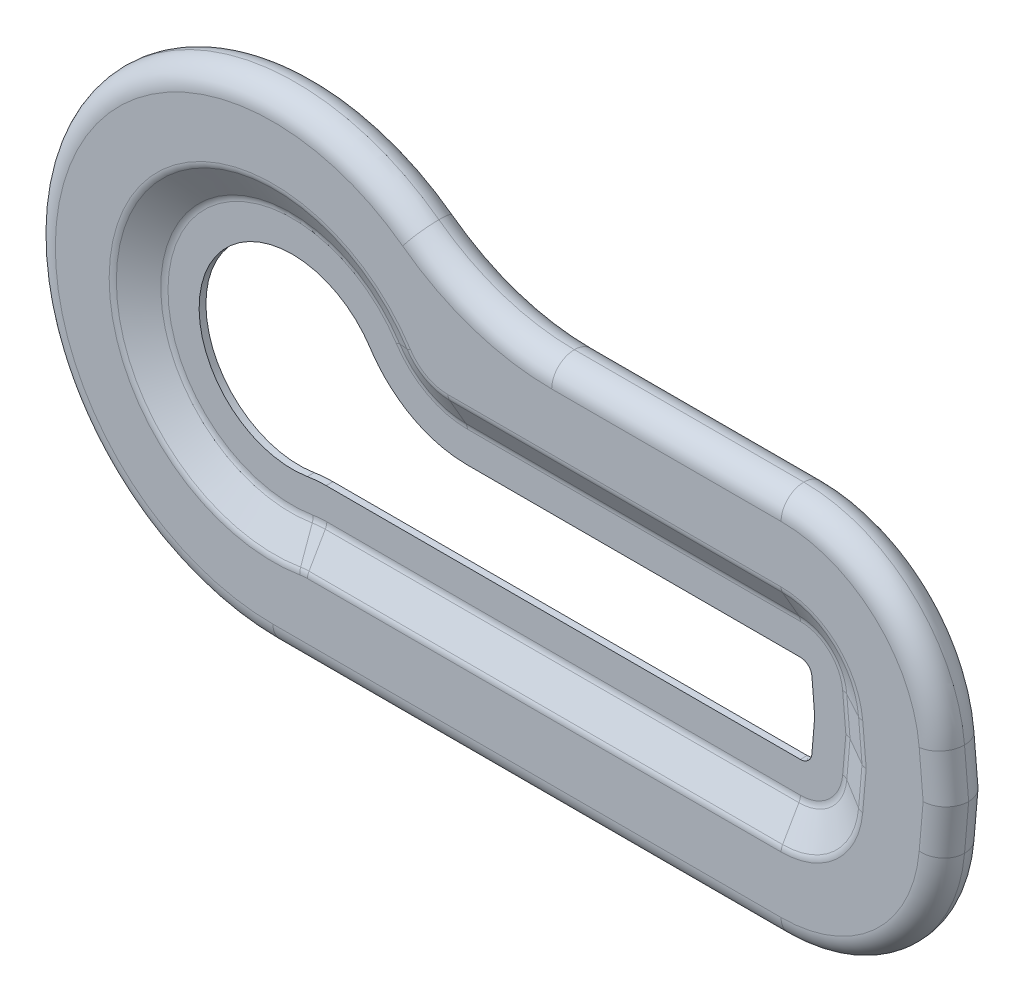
ISO-10303-21;
HEADER;
FILE_DESCRIPTION(('STEP AP214'),'2;1');
FILE_NAME('part.step','',(''),(''),'','','');
FILE_SCHEMA(('AUTOMOTIVE_DESIGN { 1 0 10303 214 1 1 1 1 }'));
ENDSEC;
DATA;
#1=APPLICATION_CONTEXT('core data for automotive mechanical design processes');
#2=APPLICATION_PROTOCOL_DEFINITION('international standard','automotive_design',2000,#1);
#3=PRODUCT_CONTEXT('',#1,'mechanical');
#4=PRODUCT('Part','Part','',(#3));
#5=PRODUCT_RELATED_PRODUCT_CATEGORY('part','',(#4));
#6=PRODUCT_DEFINITION_FORMATION('','',#4);
#7=PRODUCT_DEFINITION_CONTEXT('part definition',#1,'design');
#8=PRODUCT_DEFINITION('design','',#6,#7);
#9=PRODUCT_DEFINITION_SHAPE('','',#8);
#10=(LENGTH_UNIT() NAMED_UNIT(*) SI_UNIT(.MILLI.,.METRE.));
#11=(NAMED_UNIT(*) PLANE_ANGLE_UNIT() SI_UNIT($,.RADIAN.));
#12=(NAMED_UNIT(*) SI_UNIT($,.STERADIAN.) SOLID_ANGLE_UNIT());
#13=UNCERTAINTY_MEASURE_WITH_UNIT(LENGTH_MEASURE(1.E-05),#10,'distance_accuracy_value','');
#14=(GEOMETRIC_REPRESENTATION_CONTEXT(3) GLOBAL_UNCERTAINTY_ASSIGNED_CONTEXT((#13)) GLOBAL_UNIT_ASSIGNED_CONTEXT((#10,
#11,#12)) REPRESENTATION_CONTEXT('',''));
#15=CARTESIAN_POINT('',(0.,0.,0.));
#16=DIRECTION('',(0.,0.,1.));
#17=DIRECTION('',(1.,0.,0.));
#18=AXIS2_PLACEMENT_3D('',#15,#16,#17);
#19=CARTESIAN_POINT('',(89.4898477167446,-13.9055,0.6));
#20=DIRECTION('',(0.,0.,1.));
#21=DIRECTION('',(1.,0.,0.));
#22=AXIS2_PLACEMENT_3D('',#19,#20,#21);
#23=PLANE('',#22);
#24=CARTESIAN_POINT('',(89.4898477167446,-13.9055,0.6));
#25=DIRECTION('',(0.,0.,1.));
#26=DIRECTION('',(1.,0.,0.));
#27=AXIS2_PLACEMENT_3D('',#24,#25,#26);
#28=CIRCLE('',#27,7.46910161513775);
#29=CARTESIAN_POINT('',(89.4898477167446,-21.3746016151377,0.6));
#30=VERTEX_POINT('',#29);
#31=CARTESIAN_POINT('',(96.9305271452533,-14.5564750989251,0.6));
#32=VERTEX_POINT('',#31);
#33=EDGE_CURVE('E985',#30,#32,#28,.T.);
#34=ORIENTED_EDGE('',*,*,#33,.T.);
#35=DIRECTION('',(0.0871557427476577,0.996194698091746,0.));
#36=VECTOR('',#35,1.);
#37=CARTESIAN_POINT('',(97.4977320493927,-8.07329337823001,0.6));
#38=LINE('',#37,#36);
#39=CARTESIAN_POINT('',(97.4936457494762,-8.12000000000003,0.6));
#40=VERTEX_POINT('',#39);
#41=EDGE_CURVE('E988',#32,#40,#38,.T.);
#42=ORIENTED_EDGE('',*,*,#41,.T.);
#43=DIRECTION('',(-0.087155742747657,0.996194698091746,0.));
#44=VECTOR('',#43,1.);
#45=CARTESIAN_POINT('',(96.9305271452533,-1.68352490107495,0.6));
#46=LINE('',#45,#44);
#47=CARTESIAN_POINT('',(96.9305271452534,-1.68352490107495,0.6));
#48=VERTEX_POINT('',#47);
#49=EDGE_CURVE('E994',#40,#48,#46,.T.);
#50=ORIENTED_EDGE('',*,*,#49,.T.);
#51=CARTESIAN_POINT('',(89.4898477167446,-2.3345,0.6));
#52=DIRECTION('',(0.,0.,1.));
#53=DIRECTION('',(1.,0.,0.));
#54=AXIS2_PLACEMENT_3D('',#51,#52,#53);
#55=CIRCLE('',#54,7.46910161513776);
#56=CARTESIAN_POINT('',(89.4898477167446,5.13460161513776,0.6));
#57=VERTEX_POINT('',#56);
#58=EDGE_CURVE('E1425',#48,#57,#55,.T.);
#59=ORIENTED_EDGE('',*,*,#58,.T.);
#60=DIRECTION('',(-1.,0.,0.));
#61=VECTOR('',#60,1.);
#62=CARTESIAN_POINT('',(30.8393483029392,5.13460161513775,0.6));
#63=LINE('',#62,#61);
#64=CARTESIAN_POINT('',(30.8393483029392,5.13460161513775,0.6));
#65=VERTEX_POINT('',#64);
#66=EDGE_CURVE('E1423',#57,#65,#63,.T.);
#67=ORIENTED_EDGE('',*,*,#66,.T.);
#68=CARTESIAN_POINT('',(30.8393483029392,20.0205,0.6));
#69=DIRECTION('',(0.,0.,1.));
#70=DIRECTION('',(1.,0.,0.));
#71=AXIS2_PLACEMENT_3D('',#68,#69,#70);
#72=CIRCLE('',#71,14.8858983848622);
#73=CARTESIAN_POINT('',(18.3537247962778,11.9149971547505,0.6));
#74=VERTEX_POINT('',#73);
#75=EDGE_CURVE('E1421',#65,#74,#72,.F.);
#76=ORIENTED_EDGE('',*,*,#75,.T.);
#77=CARTESIAN_POINT('',(0.,0.,0.6));
#78=DIRECTION('',(0.,0.,1.));
#79=DIRECTION('',(1.,0.,0.));
#80=AXIS2_PLACEMENT_3D('',#77,#78,#79);
#81=CIRCLE('',#80,21.8821016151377);
#82=CARTESIAN_POINT('',(3.62312432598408,-21.5800681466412,0.6));
#83=VERTEX_POINT('',#82);
#84=EDGE_CURVE('E1419',#74,#83,#81,.T.);
#85=ORIENTED_EDGE('',*,*,#84,.T.);
#86=CARTESIAN_POINT('',(6.08785378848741,-36.2605,0.6));
#87=DIRECTION('',(0.,0.,1.));
#88=DIRECTION('',(1.,0.,0.));
#89=AXIS2_PLACEMENT_3D('',#86,#87,#88);
#90=CIRCLE('',#89,14.8858983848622);
#91=CARTESIAN_POINT('',(6.08785378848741,-21.3746016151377,0.6));
#92=VERTEX_POINT('',#91);
#93=EDGE_CURVE('E1417',#83,#92,#90,.F.);
#94=ORIENTED_EDGE('',*,*,#93,.T.);
#95=DIRECTION('',(1.,0.,0.));
#96=VECTOR('',#95,1.);
#97=CARTESIAN_POINT('',(89.4898477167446,-21.3746016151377,0.6));
#98=LINE('',#97,#96);
#99=EDGE_CURVE('E990',#92,#30,#98,.T.);
#100=ORIENTED_EDGE('',*,*,#99,.T.);
#101=EDGE_LOOP('',(#34,#42,#50,#59,#67,#76,#85,#94,#100));
#102=FACE_BOUND('',#101,.T.);
#103=CARTESIAN_POINT('',(91.5121229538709,-14.0521602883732,0.6));
#104=CARTESIAN_POINT('',(91.598158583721,-13.0637512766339,0.6));
#105=CARTESIAN_POINT('',(91.6841815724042,-12.0753393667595,0.6));
#106=CARTESIAN_POINT('',(91.8113324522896,-10.5925755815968,0.6));
#107=CARTESIAN_POINT('',(91.8536307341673,-10.098314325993,0.6));
#108=CARTESIAN_POINT('',(91.9137852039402,-9.35666545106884,0.6));
#109=CARTESIAN_POINT('',(91.9334514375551,-9.10941909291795,0.6));
#110=CARTESIAN_POINT('',(91.9671209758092,-8.6144844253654,0.6));
#111=CARTESIAN_POINT('',(91.9813457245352,-8.36677507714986,0.6));
#112=CARTESIAN_POINT('',(91.9812026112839,-7.86927923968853,0.6));
#113=CARTESIAN_POINT('',(91.966896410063,-7.62174220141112,0.6));
#114=CARTESIAN_POINT('',(91.933182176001,-7.1271021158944,0.6));
#115=CARTESIAN_POINT('',(91.9135223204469,-6.88002049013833,0.6));
#116=CARTESIAN_POINT('',(91.8533907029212,-6.1388736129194,0.6));
#117=CARTESIAN_POINT('',(91.8111224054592,-5.64496118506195,0.6));
#118=CARTESIAN_POINT('',(91.6840578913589,-4.16324598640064,0.6));
#119=CARTESIAN_POINT('',(91.5980970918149,-3.17554228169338,0.6));
#120=CARTESIAN_POINT('',(91.5121229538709,-2.18783971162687,0.6));
#121=B_SPLINE_CURVE_WITH_KNOTS('',3,(#103,#104,#105,#106,#107,#108,#109,#110,#111,#112,#113,
#114,#115,#116,#117,#118,#119,#120),.UNSPECIFIED.,.F.,.F.,(4,2,2,2,2,2,2,2,4),(0.,
0.249999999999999,0.374999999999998,0.437499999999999,0.499999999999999,0.562499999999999,
0.624999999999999,0.75,1.),.UNSPECIFIED.);
#122=CARTESIAN_POINT('',(91.5121229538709,-2.18783971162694,0.599999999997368));
#123=VERTEX_POINT('',#122);
#124=CARTESIAN_POINT('',(91.5121229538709,-14.0521602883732,0.600000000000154));
#125=VERTEX_POINT('',#124);
#126=EDGE_CURVE('E789',#123,#125,#121,.F.);
#127=ORIENTED_EDGE('',*,*,#126,.T.);
#128=CARTESIAN_POINT('',(89.4898477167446,-15.9124348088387,0.6));
#129=CARTESIAN_POINT('',(89.6153437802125,-15.9124348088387,0.6));
#130=CARTESIAN_POINT('',(89.7425263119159,-15.9005022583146,0.6));
#131=CARTESIAN_POINT('',(89.9886714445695,-15.8540013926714,0.6));
#132=CARTESIAN_POINT('',(90.1088939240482,-15.8195619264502,0.6));
#133=CARTESIAN_POINT('',(90.343546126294,-15.7279414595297,0.6));
#134=CARTESIAN_POINT('',(90.4571428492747,-15.6707932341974,0.6));
#135=CARTESIAN_POINT('',(90.6692472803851,-15.5382404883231,0.6));
#136=CARTESIAN_POINT('',(90.7689464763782,-15.4624130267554,0.6));
#137=CARTESIAN_POINT('',(91.0483183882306,-15.2052751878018,0.6));
#138=CARTESIAN_POINT('',(91.2018307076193,-14.9983928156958,0.6));
#139=CARTESIAN_POINT('',(91.4216591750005,-14.5492441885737,0.6));
#140=CARTESIAN_POINT('',(91.4904460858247,-14.3011921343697,0.6));
#141=CARTESIAN_POINT('',(91.5121229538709,-14.0521602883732,0.6));
#142=B_SPLINE_CURVE_WITH_KNOTS('',3,(#128,#129,#130,#131,#132,#133,#134,#135,#136,#137,#138,
#139,#140,#141),.UNSPECIFIED.,.F.,.F.,(4,2,2,2,2,2,4),(0.,0.125,0.249999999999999,
0.374999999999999,0.499999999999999,0.749999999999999,1.),.UNSPECIFIED.);
#143=CARTESIAN_POINT('',(89.4898477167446,-15.9124348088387,0.6));
#144=VERTEX_POINT('',#143);
#145=EDGE_CURVE('E618',#125,#144,#142,.F.);
#146=ORIENTED_EDGE('',*,*,#145,.T.);
#147=DIRECTION('',(-1.,0.,0.));
#148=VECTOR('',#147,1.);
#149=CARTESIAN_POINT('',(-20.3,-15.9124348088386,0.6));
#150=LINE('',#149,#148);
#151=CARTESIAN_POINT('',(5.9669527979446,-15.9124348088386,0.600000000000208));
#152=VERTEX_POINT('',#151);
#153=EDGE_CURVE('E750',#144,#152,#150,.T.);
#154=ORIENTED_EDGE('',*,*,#153,.T.);
#155=CARTESIAN_POINT('',(2.66874327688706,-16.1824612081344,0.6000000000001));
#156=CARTESIAN_POINT('',(3.76077123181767,-16.0023685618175,0.6000000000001));
#157=CARTESIAN_POINT('',(4.86018054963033,-15.912434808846,0.6000000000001));
#158=CARTESIAN_POINT('',(5.96695279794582,-15.912434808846,0.6000000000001));
#159=B_SPLINE_CURVE_WITH_KNOTS('',3,(#155,#156,#157,#158),.UNSPECIFIED.,.F.,.F.,(4,4),(0.,1.),.UNSPECIFIED.);
#160=CARTESIAN_POINT('',(2.66874327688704,-16.1824612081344,0.6));
#161=VERTEX_POINT('',#160);
#162=EDGE_CURVE('E459',#161,#152,#159,.T.);
#163=ORIENTED_EDGE('',*,*,#162,.F.);
#164=CARTESIAN_POINT('',(0.,0.,0.6));
#165=DIRECTION('',(0.,0.,1.));
#166=DIRECTION('',(1.,0.,0.));
#167=AXIS2_PLACEMENT_3D('',#164,#165,#166);
#168=CIRCLE('',#167,16.4010439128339);
#169=CARTESIAN_POINT('',(13.7663220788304,8.91530245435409,0.6));
#170=VERTEX_POINT('',#169);
#171=EDGE_CURVE('E774',#170,#161,#168,.T.);
#172=ORIENTED_EDGE('',*,*,#171,.F.);
#173=CARTESIAN_POINT('',(30.7587539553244,-0.327565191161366,0.6));
#174=CARTESIAN_POINT('',(29.0625183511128,-0.327565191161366,0.6));
#175=CARTESIAN_POINT('',(27.401888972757,-0.118254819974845,0.6));
#176=CARTESIAN_POINT('',(25.3693683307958,0.397721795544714,0.6));
#177=CARTESIAN_POINT('',(24.9650575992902,0.513810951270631,0.6));
#178=CARTESIAN_POINT('',(24.1609160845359,0.772324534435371,0.6));
#179=CARTESIAN_POINT('',(23.7604923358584,0.915084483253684,0.6));
#180=CARTESIAN_POINT('',(22.5826633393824,1.37709227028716,0.6));
#181=CARTESIAN_POINT('',(21.8231511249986,1.73148688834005,0.6));
#182=CARTESIAN_POINT('',(20.3541821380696,2.53060298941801,0.6));
#183=CARTESIAN_POINT('',(19.644726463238,2.97532645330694,0.6));
#184=CARTESIAN_POINT('',(18.2768617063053,3.95688881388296,0.6));
#185=CARTESIAN_POINT('',(17.6169630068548,4.49609725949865,0.6));
#186=CARTESIAN_POINT('',(15.7678119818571,6.21013819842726,0.6));
#187=CARTESIAN_POINT('',(14.6883767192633,7.49153683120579,0.6));
#188=CARTESIAN_POINT('',(13.7663220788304,8.91530245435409,0.6));
#189=B_SPLINE_CURVE_WITH_KNOTS('',3,(#173,#174,#175,#176,#177,#178,#179,#180,#181,#182,#183,
#184,#185,#186,#187,#188),.UNSPECIFIED.,.F.,.F.,(4,2,2,2,2,2,2,4),(0.,0.25,0.3125,0.375,0.5,
0.625,0.75,1.),.UNSPECIFIED.);
#190=CARTESIAN_POINT('',(30.7587539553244,-0.327565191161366,0.6));
#191=VERTEX_POINT('',#190);
#192=EDGE_CURVE('E765',#191,#170,#189,.T.);
#193=ORIENTED_EDGE('',*,*,#192,.F.);
#194=DIRECTION('',(-1.,0.,0.));
#195=VECTOR('',#194,1.);
#196=CARTESIAN_POINT('',(-20.3,-0.327565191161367,0.6));
#197=LINE('',#196,#195);
#198=CARTESIAN_POINT('',(89.4898477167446,-0.327565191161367,0.6));
#199=VERTEX_POINT('',#198);
#200=EDGE_CURVE('E777',#191,#199,#197,.F.);
#201=ORIENTED_EDGE('',*,*,#200,.T.);
#202=CARTESIAN_POINT('',(91.5121229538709,-2.18783971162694,0.6));
#203=CARTESIAN_POINT('',(91.5012281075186,-2.06267570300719,0.6));
#204=CARTESIAN_POINT('',(91.4790091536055,-1.93948938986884,0.6));
#205=CARTESIAN_POINT('',(91.4117955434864,-1.69709441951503,0.6));
#206=CARTESIAN_POINT('',(91.3663820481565,-1.57764559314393,0.6));
#207=CARTESIAN_POINT('',(91.2008653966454,-1.23997580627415,0.6));
#208=CARTESIAN_POINT('',(91.0469086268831,-1.03358277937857,0.6));
#209=CARTESIAN_POINT('',(90.6785955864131,-0.694271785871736,0.6));
#210=CARTESIAN_POINT('',(90.4600082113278,-0.557615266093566,0.6));
#211=CARTESIAN_POINT('',(89.9936076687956,-0.375340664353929,0.6));
#212=CARTESIAN_POINT('',(89.7405141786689,-0.327565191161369,0.6));
#213=CARTESIAN_POINT('',(89.4898477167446,-0.327565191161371,0.6));
#214=B_SPLINE_CURVE_WITH_KNOTS('',3,(#202,#203,#204,#205,#206,#207,#208,#209,#210,#211,#212,
#213),.UNSPECIFIED.,.F.,.F.,(4,2,2,2,2,4),(0.,0.125,0.25,0.5,0.75,1.),.UNSPECIFIED.);
#215=EDGE_CURVE('E779',#199,#123,#214,.F.);
#216=ORIENTED_EDGE('',*,*,#215,.T.);
#217=EDGE_LOOP('',(#127,#146,#154,#163,#172,#193,#201,#216));
#218=FACE_BOUND('',#217,.T.);
#219=ADVANCED_FACE('F28',(#102,#218),#23,.T.);
#220=CARTESIAN_POINT('',(97.464386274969,-14.603181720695,-0.6));
#221=DIRECTION('',(-0.498097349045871,0.0435778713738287,-0.86602540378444));
#222=DIRECTION('',(-0.866848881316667,0.,0.498570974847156));
#223=AXIS2_PLACEMENT_3D('',#220,#221,#222);
#224=PLANE('',#223);
#225=DIRECTION('',(0.866848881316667,0.,-0.498570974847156));
#226=VECTOR('',#225,1.);
#227=CARTESIAN_POINT('',(97.6053781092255,-8.11999999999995,-0.35486215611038));
#228=LINE('',#227,#226);
#229=CARTESIAN_POINT('',(98.4974655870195,-8.11999999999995,-0.867949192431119));
#230=VERTEX_POINT('',#229);
#231=CARTESIAN_POINT('',(103.477184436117,-8.11999999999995,-3.73205080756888));
#232=VERTEX_POINT('',#231);
#233=EDGE_CURVE('E1367',#230,#232,#228,.T.);
#234=ORIENTED_EDGE('',*,*,#233,.T.);
#235=DIRECTION('',(0.0871557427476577,0.996194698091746,0.));
#236=VECTOR('',#235,1.);
#237=CARTESIAN_POINT('',(102.8686141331,-15.0759903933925,-3.73205080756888));
#238=LINE('',#237,#236);
#239=CARTESIAN_POINT('',(102.8686141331,-15.0759903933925,-3.73205080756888));
#240=VERTEX_POINT('',#239);
#241=EDGE_CURVE('E1089',#232,#240,#238,.F.);
#242=ORIENTED_EDGE('',*,*,#241,.T.);
#243=DIRECTION('',(-0.862729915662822,0.075479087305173,0.499999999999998));
#244=VECTOR('',#243,1.);
#245=CARTESIAN_POINT('',(97.464386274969,-14.603181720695,-0.599999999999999));
#246=LINE('',#245,#244);
#247=CARTESIAN_POINT('',(97.9267218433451,-14.6436308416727,-0.867949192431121));
#248=VERTEX_POINT('',#247);
#249=EDGE_CURVE('E1372',#248,#240,#246,.F.);
#250=ORIENTED_EDGE('',*,*,#249,.F.);
#251=DIRECTION('',(0.0871557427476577,0.996194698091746,0.));
#252=VECTOR('',#251,1.);
#253=CARTESIAN_POINT('',(97.9267218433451,-14.6436308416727,-0.867949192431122));
#254=LINE('',#253,#252);
#255=EDGE_CURVE('E1086',#248,#230,#254,.T.);
#256=ORIENTED_EDGE('',*,*,#255,.T.);
#257=EDGE_LOOP('',(#234,#242,#250,#256));
#258=FACE_BOUND('',#257,.T.);
#259=ADVANCED_FACE('F975',(#258),#224,.T.);
#260=CARTESIAN_POINT('',(97.464386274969,-1.63681827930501,-0.6));
#261=DIRECTION('',(-0.498097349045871,-0.0435778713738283,-0.86602540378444));
#262=DIRECTION('',(-0.866848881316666,0.,0.498570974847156));
#263=AXIS2_PLACEMENT_3D('',#260,#261,#262);
#264=PLANE('',#263);
#265=DIRECTION('',(-0.862729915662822,-0.0754790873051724,0.499999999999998));
#266=VECTOR('',#265,1.);
#267=CARTESIAN_POINT('',(97.464386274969,-1.63681827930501,-0.6));
#268=LINE('',#267,#266);
#269=CARTESIAN_POINT('',(97.9267218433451,-1.59636915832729,-0.867949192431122));
#270=VERTEX_POINT('',#269);
#271=CARTESIAN_POINT('',(102.8686141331,-1.16400960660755,-3.73205080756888));
#272=VERTEX_POINT('',#271);
#273=EDGE_CURVE('E1368',#270,#272,#268,.F.);
#274=ORIENTED_EDGE('',*,*,#273,.T.);
#275=DIRECTION('',(-0.087155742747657,0.996194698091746,0.));
#276=VECTOR('',#275,1.);
#277=CARTESIAN_POINT('',(102.8686141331,-1.16400960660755,-3.73205080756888));
#278=LINE('',#277,#276);
#279=EDGE_CURVE('E1114',#272,#232,#278,.F.);
#280=ORIENTED_EDGE('',*,*,#279,.T.);
#281=ORIENTED_EDGE('',*,*,#233,.F.);
#282=DIRECTION('',(-0.087155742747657,0.996194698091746,0.));
#283=VECTOR('',#282,1.);
#284=CARTESIAN_POINT('',(97.9267218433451,-1.59636915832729,-0.867949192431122));
#285=LINE('',#284,#283);
#286=EDGE_CURVE('E1112',#230,#270,#285,.T.);
#287=ORIENTED_EDGE('',*,*,#286,.T.);
#288=EDGE_LOOP('',(#274,#280,#281,#287));
#289=FACE_BOUND('',#288,.T.);
#290=ADVANCED_FACE('F980',(#289),#264,.T.);
#291=CARTESIAN_POINT('',(89.4898477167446,-2.3345,-0.6));
#292=DIRECTION('',(0.,0.,-1.));
#293=DIRECTION('',(1.,0.,0.));
#294=AXIS2_PLACEMENT_3D('',#291,#292,#293);
#295=CONICAL_SURFACE('',#294,8.005,1.0471975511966);
#296=DIRECTION('',(0.,-0.86602540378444,0.499999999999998));
#297=VECTOR('',#296,1.);
#298=CARTESIAN_POINT('',(89.4898477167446,5.6705,-0.599999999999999));
#299=LINE('',#298,#297);
#300=CARTESIAN_POINT('',(89.4898477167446,6.13460161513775,-0.867949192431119));
#301=VERTEX_POINT('',#300);
#302=CARTESIAN_POINT('',(89.4898477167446,11.0953711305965,-3.73205080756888));
#303=VERTEX_POINT('',#302);
#304=EDGE_CURVE('E1376',#301,#303,#299,.F.);
#305=ORIENTED_EDGE('',*,*,#304,.T.);
#306=CARTESIAN_POINT('',(89.4898477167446,-2.3345,-3.73205080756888));
#307=DIRECTION('',(0.,0.,1.));
#308=DIRECTION('',(1.,0.,0.));
#309=AXIS2_PLACEMENT_3D('',#306,#307,#308);
#310=CIRCLE('',#309,13.4298711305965);
#311=EDGE_CURVE('E1118',#303,#272,#310,.F.);
#312=ORIENTED_EDGE('',*,*,#311,.T.);
#313=ORIENTED_EDGE('',*,*,#273,.F.);
#314=CARTESIAN_POINT('',(89.4898477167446,-2.3345,-0.86794919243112));
#315=DIRECTION('',(0.,0.,1.));
#316=DIRECTION('',(1.,0.,0.));
#317=AXIS2_PLACEMENT_3D('',#314,#315,#316);
#318=CIRCLE('',#317,8.46910161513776);
#319=EDGE_CURVE('E1116',#270,#301,#318,.T.);
#320=ORIENTED_EDGE('',*,*,#319,.T.);
#321=EDGE_LOOP('',(#305,#312,#313,#320));
#322=FACE_BOUND('',#321,.T.);
#323=ADVANCED_FACE('F1741',(#322),#295,.F.);
#324=CARTESIAN_POINT('',(89.4898477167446,5.6705,-0.6));
#325=DIRECTION('',(0.,-0.499999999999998,-0.86602540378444));
#326=DIRECTION('',(0.,0.86602540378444,-0.499999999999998));
#327=AXIS2_PLACEMENT_3D('',#324,#325,#326);
#328=PLANE('',#327);
#329=DIRECTION('',(0.,-0.86602540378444,0.499999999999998));
#330=VECTOR('',#329,1.);
#331=CARTESIAN_POINT('',(30.8393483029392,5.6705,-0.6));
#332=LINE('',#331,#330);
#333=CARTESIAN_POINT('',(30.8393483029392,6.13460161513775,-0.86794919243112));
#334=VERTEX_POINT('',#333);
#335=CARTESIAN_POINT('',(30.8393483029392,11.0953711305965,-3.73205080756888));
#336=VERTEX_POINT('',#335);
#337=EDGE_CURVE('E1380',#334,#336,#332,.F.);
#338=ORIENTED_EDGE('',*,*,#337,.T.);
#339=DIRECTION('',(-1.,0.,0.));
#340=VECTOR('',#339,1.);
#341=CARTESIAN_POINT('',(89.4898477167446,11.0953711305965,-3.73205080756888));
#342=LINE('',#341,#340);
#343=EDGE_CURVE('E1122',#336,#303,#342,.F.);
#344=ORIENTED_EDGE('',*,*,#343,.T.);
#345=ORIENTED_EDGE('',*,*,#304,.F.);
#346=DIRECTION('',(-1.,0.,0.));
#347=VECTOR('',#346,1.);
#348=CARTESIAN_POINT('',(89.4898477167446,6.13460161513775,-0.86794919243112));
#349=LINE('',#348,#347);
#350=EDGE_CURVE('E1120',#301,#334,#349,.T.);
#351=ORIENTED_EDGE('',*,*,#350,.T.);
#352=EDGE_LOOP('',(#338,#344,#345,#351));
#353=FACE_BOUND('',#352,.T.);
#354=ADVANCED_FACE('F30',(#353),#328,.T.);
#355=CARTESIAN_POINT('',(30.8393483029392,20.0205,-0.6));
#356=DIRECTION('',(0.,0.,1.));
#357=DIRECTION('',(1.,0.,0.));
#358=AXIS2_PLACEMENT_3D('',#355,#356,#357);
#359=CONICAL_SURFACE('',#358,14.35,1.0471975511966);
#360=DIRECTION('',(-0.726383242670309,-0.47155846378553,0.499999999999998));
#361=VECTOR('',#360,1.);
#362=CARTESIAN_POINT('',(18.8032123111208,12.2067985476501,-0.599999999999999));
#363=LINE('',#362,#361);
#364=CARTESIAN_POINT('',(19.1924799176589,12.4595059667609,-0.867949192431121));
#365=VERTEX_POINT('',#364);
#366=CARTESIAN_POINT('',(23.3533507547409,15.160688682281,-3.73205080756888));
#367=VERTEX_POINT('',#366);
#368=EDGE_CURVE('E1384',#365,#367,#363,.F.);
#369=ORIENTED_EDGE('',*,*,#368,.T.);
#370=CARTESIAN_POINT('',(30.8393483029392,20.0205,-3.73205080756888));
#371=DIRECTION('',(0.,0.,-1.));
#372=DIRECTION('',(-1.,0.,0.));
#373=AXIS2_PLACEMENT_3D('',#370,#371,#372);
#374=CIRCLE('',#373,8.92512886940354);
#375=EDGE_CURVE('E1110',#367,#336,#374,.F.);
#376=ORIENTED_EDGE('',*,*,#375,.T.);
#377=ORIENTED_EDGE('',*,*,#337,.F.);
#378=CARTESIAN_POINT('',(30.8393483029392,20.0205,-0.867949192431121));
#379=DIRECTION('',(0.,0.,-1.));
#380=DIRECTION('',(-1.,0.,0.));
#381=AXIS2_PLACEMENT_3D('',#378,#379,#380);
#382=CIRCLE('',#381,13.8858983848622);
#383=EDGE_CURVE('E1108',#334,#365,#382,.T.);
#384=ORIENTED_EDGE('',*,*,#383,.T.);
#385=EDGE_LOOP('',(#369,#376,#377,#384));
#386=FACE_BOUND('',#385,.T.);
#387=ADVANCED_FACE('F1756',(#386),#359,.T.);
#388=CARTESIAN_POINT('',(0.,0.,-0.6));
#389=DIRECTION('',(0.,0.,-1.));
#390=DIRECTION('',(1.,0.,0.));
#391=AXIS2_PLACEMENT_3D('',#388,#389,#390);
#392=CONICAL_SURFACE('',#391,22.418,1.0471975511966);
#393=DIRECTION('',(-0.143391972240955,0.854071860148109,0.499999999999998));
#394=VECTOR('',#393,1.);
#395=CARTESIAN_POINT('',(3.71185558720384,-22.1085696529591,-0.6));
#396=LINE('',#395,#394);
#397=CARTESIAN_POINT('',(3.78869911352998,-22.5662653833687,-0.867949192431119));
#398=VERTEX_POINT('',#397);
#399=CARTESIAN_POINT('',(4.6100774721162,-27.4585625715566,-3.73205080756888));
#400=VERTEX_POINT('',#399);
#401=EDGE_CURVE('E1388',#398,#400,#396,.F.);
#402=ORIENTED_EDGE('',*,*,#401,.T.);
#403=CARTESIAN_POINT('',(0.,0.,-3.73205080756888));
#404=DIRECTION('',(0.,0.,1.));
#405=DIRECTION('',(1.,0.,0.));
#406=AXIS2_PLACEMENT_3D('',#403,#404,#405);
#407=CIRCLE('',#406,27.8428711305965);
#408=EDGE_CURVE('E1106',#400,#367,#407,.F.);
#409=ORIENTED_EDGE('',*,*,#408,.T.);
#410=ORIENTED_EDGE('',*,*,#368,.F.);
#411=CARTESIAN_POINT('',(0.,0.,-0.867949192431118));
#412=DIRECTION('',(0.,0.,1.));
#413=DIRECTION('',(1.,0.,0.));
#414=AXIS2_PLACEMENT_3D('',#411,#412,#413);
#415=CIRCLE('',#414,22.8821016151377);
#416=EDGE_CURVE('E1104',#365,#398,#415,.T.);
#417=ORIENTED_EDGE('',*,*,#416,.T.);
#418=EDGE_LOOP('',(#402,#409,#410,#417));
#419=FACE_BOUND('',#418,.T.);
#420=ADVANCED_FACE('F1767',(#419),#392,.F.);
#421=CARTESIAN_POINT('',(6.08785378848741,-21.9105,-0.6));
#422=DIRECTION('',(0.,0.499999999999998,-0.86602540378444));
#423=DIRECTION('',(0.,0.86602540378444,0.499999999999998));
#424=AXIS2_PLACEMENT_3D('',#421,#422,#423);
#425=PLANE('',#424);
#426=DIRECTION('',(0.,0.86602540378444,0.499999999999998));
#427=VECTOR('',#426,1.);
#428=CARTESIAN_POINT('',(89.4898477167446,-21.9105,-0.599999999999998));
#429=LINE('',#428,#427);
#430=CARTESIAN_POINT('',(89.4898477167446,-22.3746016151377,-0.867949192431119));
#431=VERTEX_POINT('',#430);
#432=CARTESIAN_POINT('',(89.4898477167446,-27.3353711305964,-3.73205080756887));
#433=VERTEX_POINT('',#432);
#434=EDGE_CURVE('E1307',#431,#433,#429,.F.);
#435=ORIENTED_EDGE('',*,*,#434,.T.);
#436=DIRECTION('',(1.,0.,0.));
#437=VECTOR('',#436,1.);
#438=CARTESIAN_POINT('',(6.08785378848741,-27.3353711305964,-3.73205080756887));
#439=LINE('',#438,#437);
#440=CARTESIAN_POINT('',(6.08785378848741,-27.3353711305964,-3.73205080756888));
#441=VERTEX_POINT('',#440);
#442=EDGE_CURVE('E1098',#433,#441,#439,.F.);
#443=ORIENTED_EDGE('',*,*,#442,.T.);
#444=DIRECTION('',(0.,0.86602540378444,0.499999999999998));
#445=VECTOR('',#444,1.);
#446=CARTESIAN_POINT('',(6.08785378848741,-21.9105,-0.6));
#447=LINE('',#446,#445);
#448=CARTESIAN_POINT('',(6.08785378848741,-22.3746016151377,-0.867949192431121));
#449=VERTEX_POINT('',#448);
#450=EDGE_CURVE('E1392',#449,#441,#447,.F.);
#451=ORIENTED_EDGE('',*,*,#450,.F.);
#452=DIRECTION('',(1.,0.,0.));
#453=VECTOR('',#452,1.);
#454=CARTESIAN_POINT('',(6.08785378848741,-22.3746016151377,-0.867949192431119));
#455=LINE('',#454,#453);
#456=EDGE_CURVE('E1096',#449,#431,#455,.T.);
#457=ORIENTED_EDGE('',*,*,#456,.T.);
#458=EDGE_LOOP('',(#435,#443,#451,#457));
#459=FACE_BOUND('',#458,.T.);
#460=ADVANCED_FACE('F1710',(#459),#425,.T.);
#461=CARTESIAN_POINT('',(89.4898477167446,-13.9055,-0.6));
#462=DIRECTION('',(0.,0.,-1.));
#463=DIRECTION('',(1.,0.,0.));
#464=AXIS2_PLACEMENT_3D('',#461,#462,#463);
#465=CONICAL_SURFACE('',#464,8.00499999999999,1.0471975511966);
#466=ORIENTED_EDGE('',*,*,#249,.T.);
#467=CARTESIAN_POINT('',(89.4898477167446,-13.9055,-3.73205080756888));
#468=DIRECTION('',(0.,0.,1.));
#469=DIRECTION('',(1.,0.,0.));
#470=AXIS2_PLACEMENT_3D('',#467,#468,#469);
#471=CIRCLE('',#470,13.4298711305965);
#472=EDGE_CURVE('E1094',#240,#433,#471,.F.);
#473=ORIENTED_EDGE('',*,*,#472,.T.);
#474=ORIENTED_EDGE('',*,*,#434,.F.);
#475=CARTESIAN_POINT('',(89.4898477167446,-13.9055,-0.86794919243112));
#476=DIRECTION('',(0.,0.,1.));
#477=DIRECTION('',(1.,0.,0.));
#478=AXIS2_PLACEMENT_3D('',#475,#476,#477);
#479=CIRCLE('',#478,8.46910161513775);
#480=EDGE_CURVE('E1092',#431,#248,#479,.T.);
#481=ORIENTED_EDGE('',*,*,#480,.T.);
#482=EDGE_LOOP('',(#466,#473,#474,#481));
#483=FACE_BOUND('',#482,.T.);
#484=ADVANCED_FACE('F1726',(#483),#465,.F.);
#485=CARTESIAN_POINT('',(6.08785378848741,-36.2605,-0.6));
#486=DIRECTION('',(0.,0.,1.));
#487=DIRECTION('',(-1.,0.,0.));
#488=AXIS2_PLACEMENT_3D('',#485,#486,#487);
#489=CONICAL_SURFACE('',#488,14.35,1.0471975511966);
#490=ORIENTED_EDGE('',*,*,#450,.T.);
#491=CARTESIAN_POINT('',(6.08785378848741,-36.2605,-3.73205080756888));
#492=DIRECTION('',(0.,0.,-1.));
#493=DIRECTION('',(-1.,0.,0.));
#494=AXIS2_PLACEMENT_3D('',#491,#492,#493);
#495=CIRCLE('',#494,8.92512886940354);
#496=EDGE_CURVE('E1102',#441,#400,#495,.F.);
#497=ORIENTED_EDGE('',*,*,#496,.T.);
#498=ORIENTED_EDGE('',*,*,#401,.F.);
#499=CARTESIAN_POINT('',(6.08785378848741,-36.2605,-0.867949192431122));
#500=DIRECTION('',(0.,0.,-1.));
#501=DIRECTION('',(-1.,0.,0.));
#502=AXIS2_PLACEMENT_3D('',#499,#500,#501);
#503=CIRCLE('',#502,13.8858983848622);
#504=EDGE_CURVE('E1100',#398,#449,#503,.T.);
#505=ORIENTED_EDGE('',*,*,#504,.T.);
#506=EDGE_LOOP('',(#490,#497,#498,#505));
#507=FACE_BOUND('',#506,.T.);
#508=ADVANCED_FACE('F1627',(#507),#489,.T.);
#509=CARTESIAN_POINT('',(49.0920791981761,66.0805,4.));
#510=DIRECTION('',(0.,0.,-1.));
#511=DIRECTION('',(-1.,0.,0.));
#512=AXIS2_PLACEMENT_3D('',#509,#510,#511);
#513=PLANE('',#512);
#514=DIRECTION('',(-0.087155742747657,0.996194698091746,0.));
#515=VECTOR('',#514,1.);
#516=CARTESIAN_POINT('',(104.476917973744,-8.07329337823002,4.));
#517=LINE('',#516,#515);
#518=CARTESIAN_POINT('',(103.864808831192,-1.0768538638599,4.));
#519=VERTEX_POINT('',#518);
#520=CARTESIAN_POINT('',(104.481004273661,-8.12,4.));
#521=VERTEX_POINT('',#520);
#522=EDGE_CURVE('E1060',#519,#521,#517,.F.);
#523=ORIENTED_EDGE('',*,*,#522,.T.);
#524=DIRECTION('',(0.0871557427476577,0.996194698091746,0.));
#525=VECTOR('',#524,1.);
#526=CARTESIAN_POINT('',(103.864808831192,-15.1631461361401,4.));
#527=LINE('',#526,#525);
#528=CARTESIAN_POINT('',(103.864808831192,-15.1631461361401,4.));
#529=VERTEX_POINT('',#528);
#530=EDGE_CURVE('E1064',#521,#529,#527,.F.);
#531=ORIENTED_EDGE('',*,*,#530,.T.);
#532=CARTESIAN_POINT('',(89.4898477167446,-13.9055,4.));
#533=DIRECTION('',(0.,0.,-1.));
#534=DIRECTION('',(-1.,0.,0.));
#535=AXIS2_PLACEMENT_3D('',#532,#533,#534);
#536=CIRCLE('',#535,14.4298711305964);
#537=CARTESIAN_POINT('',(89.4898477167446,-28.3353711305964,4.));
#538=VERTEX_POINT('',#537);
#539=EDGE_CURVE('E1062',#529,#538,#536,.T.);
#540=ORIENTED_EDGE('',*,*,#539,.T.);
#541=DIRECTION('',(1.,0.,0.));
#542=VECTOR('',#541,1.);
#543=CARTESIAN_POINT('',(6.08785378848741,-28.3353711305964,4.));
#544=LINE('',#543,#542);
#545=CARTESIAN_POINT('',(6.08785378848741,-28.3353711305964,4.));
#546=VERTEX_POINT('',#545);
#547=EDGE_CURVE('E1048',#538,#546,#544,.F.);
#548=ORIENTED_EDGE('',*,*,#547,.T.);
#549=CARTESIAN_POINT('',(6.08785378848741,-36.2605,4.));
#550=DIRECTION('',(0.,0.,-1.));
#551=DIRECTION('',(-1.,0.,0.));
#552=AXIS2_PLACEMENT_3D('',#549,#550,#551);
#553=CIRCLE('',#552,7.92512886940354);
#554=CARTESIAN_POINT('',(4.77565225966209,-28.4447598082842,4.));
#555=VERTEX_POINT('',#554);
#556=EDGE_CURVE('E1050',#546,#555,#553,.F.);
#557=ORIENTED_EDGE('',*,*,#556,.T.);
#558=CARTESIAN_POINT('',(0.,0.,4.));
#559=DIRECTION('',(0.,0.,-1.));
#560=DIRECTION('',(-1.,0.,0.));
#561=AXIS2_PLACEMENT_3D('',#558,#559,#560);
#562=CIRCLE('',#561,28.8428711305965);
#563=CARTESIAN_POINT('',(24.192105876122,15.7051974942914,4.));
#564=VERTEX_POINT('',#563);
#565=EDGE_CURVE('E1052',#555,#564,#562,.T.);
#566=ORIENTED_EDGE('',*,*,#565,.T.);
#567=CARTESIAN_POINT('',(30.8393483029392,20.0205,4.));
#568=DIRECTION('',(0.,0.,-1.));
#569=DIRECTION('',(-1.,0.,0.));
#570=AXIS2_PLACEMENT_3D('',#567,#568,#569);
#571=CIRCLE('',#570,7.92512886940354);
#572=CARTESIAN_POINT('',(30.8393483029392,12.0953711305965,4.));
#573=VERTEX_POINT('',#572);
#574=EDGE_CURVE('E1054',#564,#573,#571,.F.);
#575=ORIENTED_EDGE('',*,*,#574,.T.);
#576=DIRECTION('',(-1.,0.,0.));
#577=VECTOR('',#576,1.);
#578=CARTESIAN_POINT('',(89.4898477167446,12.0953711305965,4.));
#579=LINE('',#578,#577);
#580=CARTESIAN_POINT('',(89.4898477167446,12.0953711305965,4.));
#581=VERTEX_POINT('',#580);
#582=EDGE_CURVE('E1056',#573,#581,#579,.F.);
#583=ORIENTED_EDGE('',*,*,#582,.T.);
#584=CARTESIAN_POINT('',(89.4898477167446,-2.3345,4.));
#585=DIRECTION('',(0.,0.,-1.));
#586=DIRECTION('',(-1.,0.,0.));
#587=AXIS2_PLACEMENT_3D('',#584,#585,#586);
#588=CIRCLE('',#587,14.4298711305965);
#589=EDGE_CURVE('E1058',#581,#519,#588,.T.);
#590=ORIENTED_EDGE('',*,*,#589,.T.);
#591=EDGE_LOOP('',(#523,#531,#540,#548,#557,#566,#575,#583,#590));
#592=FACE_BOUND('',#591,.T.);
#593=CARTESIAN_POINT('',(89.4898477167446,-2.3345,4.));
#594=DIRECTION('',(0.,0.,-1.));
#595=DIRECTION('',(-1.,0.,0.));
#596=AXIS2_PLACEMENT_3D('',#593,#594,#595);
#597=CIRCLE('',#596,24.415);
#598=CARTESIAN_POINT('',(113.811941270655,-0.206592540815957,4.));
#599=VERTEX_POINT('',#598);
#600=CARTESIAN_POINT('',(89.4898477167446,22.0805,4.));
#601=VERTEX_POINT('',#600);
#602=EDGE_CURVE('E1318',#599,#601,#597,.F.);
#603=ORIENTED_EDGE('',*,*,#602,.T.);
#604=DIRECTION('',(-1.,0.,0.));
#605=VECTOR('',#604,1.);
#606=CARTESIAN_POINT('',(49.0920791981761,22.0805,4.));
#607=LINE('',#606,#605);
#608=CARTESIAN_POINT('',(49.0920791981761,22.0805,4.));
#609=VERTEX_POINT('',#608);
#610=EDGE_CURVE('E1320',#601,#609,#607,.T.);
#611=ORIENTED_EDGE('',*,*,#610,.T.);
#612=CARTESIAN_POINT('',(49.0920791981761,66.0805,4.));
#613=DIRECTION('',(0.,0.,-1.));
#614=DIRECTION('',(-1.,0.,0.));
#615=AXIS2_PLACEMENT_3D('',#612,#613,#614);
#616=CIRCLE('',#615,44.);
#617=CARTESIAN_POINT('',(22.8525460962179,30.7607193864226,4.));
#618=VERTEX_POINT('',#617);
#619=EDGE_CURVE('E761',#609,#618,#616,.T.);
#620=ORIENTED_EDGE('',*,*,#619,.T.);
#621=CARTESIAN_POINT('',(0.,0.,4.));
#622=DIRECTION('',(0.,0.,-1.));
#623=DIRECTION('',(-1.,0.,0.));
#624=AXIS2_PLACEMENT_3D('',#621,#622,#623);
#625=CIRCLE('',#624,38.3205);
#626=CARTESIAN_POINT('',(0.,-38.3205,4.));
#627=VERTEX_POINT('',#626);
#628=EDGE_CURVE('E762',#618,#627,#625,.F.);
#629=ORIENTED_EDGE('',*,*,#628,.T.);
#630=DIRECTION('',(1.,0.,0.));
#631=VECTOR('',#630,1.);
#632=CARTESIAN_POINT('',(49.0920791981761,-38.3205,4.));
#633=LINE('',#632,#631);
#634=CARTESIAN_POINT('',(89.4898477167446,-38.3205,4.));
#635=VERTEX_POINT('',#634);
#636=EDGE_CURVE('E1310',#627,#635,#633,.T.);
#637=ORIENTED_EDGE('',*,*,#636,.T.);
#638=CARTESIAN_POINT('',(89.4898477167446,-13.9055,4.));
#639=DIRECTION('',(0.,0.,-1.));
#640=DIRECTION('',(-1.,0.,0.));
#641=AXIS2_PLACEMENT_3D('',#638,#639,#640);
#642=CIRCLE('',#641,24.415);
#643=CARTESIAN_POINT('',(113.811941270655,-16.0334074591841,4.));
#644=VERTEX_POINT('',#643);
#645=EDGE_CURVE('E1312',#635,#644,#642,.F.);
#646=ORIENTED_EDGE('',*,*,#645,.T.);
#647=DIRECTION('',(0.0871557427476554,0.996194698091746,0.));
#648=VECTOR('',#647,1.);
#649=CARTESIAN_POINT('',(120.449786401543,59.8375095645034,4.));
#650=LINE('',#649,#648);
#651=CARTESIAN_POINT('',(114.504274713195,-8.11999999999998,4.));
#652=VERTEX_POINT('',#651);
#653=EDGE_CURVE('E1314',#644,#652,#650,.T.);
#654=ORIENTED_EDGE('',*,*,#653,.T.);
#655=DIRECTION('',(-0.0871557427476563,0.996194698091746,0.));
#656=VECTOR('',#655,1.);
#657=CARTESIAN_POINT('',(107.565004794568,71.196218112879,4.));
#658=LINE('',#657,#656);
#659=EDGE_CURVE('E1316',#652,#599,#658,.T.);
#660=ORIENTED_EDGE('',*,*,#659,.T.);
#661=EDGE_LOOP('',(#603,#611,#620,#629,#637,#646,#654,#660));
#662=FACE_BOUND('',#661,.T.);
#663=ADVANCED_FACE('F490',(#592,#662),#513,.F.);
#664=CARTESIAN_POINT('',(49.0920791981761,66.0805,-4.));
#665=DIRECTION('',(0.,0.,-1.));
#666=DIRECTION('',(-1.,0.,0.));
#667=AXIS2_PLACEMENT_3D('',#664,#665,#666);
#668=PLANE('',#667);
#669=CARTESIAN_POINT('',(89.4898477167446,-13.9055,-4.));
#670=DIRECTION('',(0.,0.,-1.));
#671=DIRECTION('',(-1.,0.,0.));
#672=AXIS2_PLACEMENT_3D('',#669,#670,#671);
#673=CIRCLE('',#672,14.4298711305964);
#674=CARTESIAN_POINT('',(89.4898477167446,-28.3353711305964,-4.));
#675=VERTEX_POINT('',#674);
#676=CARTESIAN_POINT('',(103.864808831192,-15.1631461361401,-4.));
#677=VERTEX_POINT('',#676);
#678=EDGE_CURVE('E1081',#675,#677,#673,.F.);
#679=ORIENTED_EDGE('',*,*,#678,.T.);
#680=DIRECTION('',(0.0871557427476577,0.996194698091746,0.));
#681=VECTOR('',#680,1.);
#682=CARTESIAN_POINT('',(110.502653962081,60.7077708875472,-4.));
#683=LINE('',#682,#681);
#684=CARTESIAN_POINT('',(104.481004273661,-8.12000000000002,-4.));
#685=VERTEX_POINT('',#684);
#686=EDGE_CURVE('E1083',#677,#685,#683,.T.);
#687=ORIENTED_EDGE('',*,*,#686,.T.);
#688=DIRECTION('',(-0.087155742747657,0.996194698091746,0.));
#689=VECTOR('',#688,1.);
#690=CARTESIAN_POINT('',(97.6178723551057,70.3259567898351,-4.));
#691=LINE('',#690,#689);
#692=CARTESIAN_POINT('',(103.864808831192,-1.0768538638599,-4.));
#693=VERTEX_POINT('',#692);
#694=EDGE_CURVE('E1071',#685,#693,#691,.T.);
#695=ORIENTED_EDGE('',*,*,#694,.T.);
#696=CARTESIAN_POINT('',(89.4898477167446,-2.3345,-4.));
#697=DIRECTION('',(0.,0.,-1.));
#698=DIRECTION('',(-1.,0.,0.));
#699=AXIS2_PLACEMENT_3D('',#696,#697,#698);
#700=CIRCLE('',#699,14.4298711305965);
#701=CARTESIAN_POINT('',(89.4898477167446,12.0953711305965,-4.));
#702=VERTEX_POINT('',#701);
#703=EDGE_CURVE('E1069',#693,#702,#700,.F.);
#704=ORIENTED_EDGE('',*,*,#703,.T.);
#705=DIRECTION('',(-1.,0.,0.));
#706=VECTOR('',#705,1.);
#707=CARTESIAN_POINT('',(49.0920791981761,12.0953711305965,-4.));
#708=LINE('',#707,#706);
#709=CARTESIAN_POINT('',(30.8393483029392,12.0953711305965,-4.));
#710=VERTEX_POINT('',#709);
#711=EDGE_CURVE('E1067',#702,#710,#708,.T.);
#712=ORIENTED_EDGE('',*,*,#711,.T.);
#713=CARTESIAN_POINT('',(30.8393483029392,20.0205,-4.));
#714=DIRECTION('',(0.,0.,-1.));
#715=DIRECTION('',(-1.,0.,0.));
#716=AXIS2_PLACEMENT_3D('',#713,#714,#715);
#717=CIRCLE('',#716,7.92512886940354);
#718=CARTESIAN_POINT('',(24.192105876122,15.7051974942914,-4.));
#719=VERTEX_POINT('',#718);
#720=EDGE_CURVE('E1073',#710,#719,#717,.T.);
#721=ORIENTED_EDGE('',*,*,#720,.T.);
#722=CARTESIAN_POINT('',(0.,0.,-4.));
#723=DIRECTION('',(0.,0.,-1.));
#724=DIRECTION('',(-1.,0.,0.));
#725=AXIS2_PLACEMENT_3D('',#722,#723,#724);
#726=CIRCLE('',#725,28.8428711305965);
#727=CARTESIAN_POINT('',(4.77565225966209,-28.4447598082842,-4.));
#728=VERTEX_POINT('',#727);
#729=EDGE_CURVE('E1075',#719,#728,#726,.F.);
#730=ORIENTED_EDGE('',*,*,#729,.T.);
#731=CARTESIAN_POINT('',(6.08785378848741,-36.2605,-4.));
#732=DIRECTION('',(0.,0.,-1.));
#733=DIRECTION('',(-1.,0.,0.));
#734=AXIS2_PLACEMENT_3D('',#731,#732,#733);
#735=CIRCLE('',#734,7.92512886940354);
#736=CARTESIAN_POINT('',(6.08785378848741,-28.3353711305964,-4.));
#737=VERTEX_POINT('',#736);
#738=EDGE_CURVE('E1077',#728,#737,#735,.T.);
#739=ORIENTED_EDGE('',*,*,#738,.T.);
#740=DIRECTION('',(1.,0.,0.));
#741=VECTOR('',#740,1.);
#742=CARTESIAN_POINT('',(49.0920791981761,-28.3353711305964,-4.));
#743=LINE('',#742,#741);
#744=EDGE_CURVE('E1079',#737,#675,#743,.T.);
#745=ORIENTED_EDGE('',*,*,#744,.T.);
#746=EDGE_LOOP('',(#679,#687,#695,#704,#712,#721,#730,#739,#745));
#747=FACE_BOUND('',#746,.T.);
#748=DIRECTION('',(-0.0871557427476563,0.996194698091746,0.));
#749=VECTOR('',#748,1.);
#750=CARTESIAN_POINT('',(114.534775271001,-8.46862297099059,-4.));
#751=LINE('',#750,#749);
#752=CARTESIAN_POINT('',(113.811941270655,-0.206592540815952,-4.));
#753=VERTEX_POINT('',#752);
#754=CARTESIAN_POINT('',(114.504274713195,-8.11999999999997,-4.));
#755=VERTEX_POINT('',#754);
#756=EDGE_CURVE('E1355',#753,#755,#751,.F.);
#757=ORIENTED_EDGE('',*,*,#756,.T.);
#758=DIRECTION('',(0.0871557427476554,0.996194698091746,0.));
#759=VECTOR('',#758,1.);
#760=CARTESIAN_POINT('',(113.811941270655,-16.0334074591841,-4.));
#761=LINE('',#760,#759);
#762=CARTESIAN_POINT('',(113.811941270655,-16.0334074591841,-4.));
#763=VERTEX_POINT('',#762);
#764=EDGE_CURVE('E1361',#755,#763,#761,.F.);
#765=ORIENTED_EDGE('',*,*,#764,.T.);
#766=CARTESIAN_POINT('',(89.4898477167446,-13.9055,-4.));
#767=DIRECTION('',(0.,0.,-1.));
#768=DIRECTION('',(-1.,0.,0.));
#769=AXIS2_PLACEMENT_3D('',#766,#767,#768);
#770=CIRCLE('',#769,24.415);
#771=CARTESIAN_POINT('',(89.4898477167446,-38.3205,-4.));
#772=VERTEX_POINT('',#771);
#773=EDGE_CURVE('E1359',#763,#772,#770,.T.);
#774=ORIENTED_EDGE('',*,*,#773,.T.);
#775=DIRECTION('',(1.,0.,0.));
#776=VECTOR('',#775,1.);
#777=CARTESIAN_POINT('',(0.,-38.3205,-4.));
#778=LINE('',#777,#776);
#779=CARTESIAN_POINT('',(0.,-38.3205,-4.));
#780=VERTEX_POINT('',#779);
#781=EDGE_CURVE('E1357',#772,#780,#778,.F.);
#782=ORIENTED_EDGE('',*,*,#781,.T.);
#783=CARTESIAN_POINT('',(0.,0.,-4.));
#784=DIRECTION('',(0.,0.,-1.));
#785=DIRECTION('',(-1.,0.,0.));
#786=AXIS2_PLACEMENT_3D('',#783,#784,#785);
#787=CIRCLE('',#786,38.3205);
#788=CARTESIAN_POINT('',(22.8525460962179,30.7607193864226,-4.));
#789=VERTEX_POINT('',#788);
#790=EDGE_CURVE('E1353',#780,#789,#787,.T.);
#791=ORIENTED_EDGE('',*,*,#790,.T.);
#792=CARTESIAN_POINT('',(49.0920791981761,66.0805,-4.));
#793=DIRECTION('',(0.,0.,-1.));
#794=DIRECTION('',(-1.,0.,0.));
#795=AXIS2_PLACEMENT_3D('',#792,#793,#794);
#796=CIRCLE('',#795,44.);
#797=CARTESIAN_POINT('',(49.0920791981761,22.0805,-4.));
#798=VERTEX_POINT('',#797);
#799=EDGE_CURVE('E1349',#789,#798,#796,.F.);
#800=ORIENTED_EDGE('',*,*,#799,.T.);
#801=DIRECTION('',(-1.,0.,0.));
#802=VECTOR('',#801,1.);
#803=CARTESIAN_POINT('',(89.4898477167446,22.0805,-4.));
#804=LINE('',#803,#802);
#805=CARTESIAN_POINT('',(89.4898477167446,22.0805,-4.));
#806=VERTEX_POINT('',#805);
#807=EDGE_CURVE('E1347',#798,#806,#804,.F.);
#808=ORIENTED_EDGE('',*,*,#807,.T.);
#809=CARTESIAN_POINT('',(89.4898477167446,-2.3345,-4.));
#810=DIRECTION('',(0.,0.,-1.));
#811=DIRECTION('',(-1.,0.,0.));
#812=AXIS2_PLACEMENT_3D('',#809,#810,#811);
#813=CIRCLE('',#812,24.415);
#814=EDGE_CURVE('E1351',#806,#753,#813,.T.);
#815=ORIENTED_EDGE('',*,*,#814,.T.);
#816=EDGE_LOOP('',(#757,#765,#774,#782,#791,#800,#808,#815));
#817=FACE_BOUND('',#816,.T.);
#818=ADVANCED_FACE('F1619',(#747,#817),#668,.T.);
#819=CARTESIAN_POINT('',(89.4898477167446,-13.9055,0.6));
#820=DIRECTION('',(0.,0.,1.));
#821=DIRECTION('',(1.,0.,0.));
#822=AXIS2_PLACEMENT_3D('',#819,#820,#821);
#823=CONICAL_SURFACE('',#822,8.00499999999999,1.0471975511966);
#824=DIRECTION('',(-0.862729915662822,0.0754790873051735,-0.499999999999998));
#825=VECTOR('',#824,1.);
#826=CARTESIAN_POINT('',(97.464386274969,-14.603181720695,0.599999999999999));
#827=LINE('',#826,#825);
#828=CARTESIAN_POINT('',(102.8686141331,-15.0759903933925,3.73205080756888));
#829=VERTEX_POINT('',#828);
#830=CARTESIAN_POINT('',(97.9267218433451,-14.6436308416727,0.867949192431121));
#831=VERTEX_POINT('',#830);
#832=EDGE_CURVE('E780',#829,#831,#827,.T.);
#833=ORIENTED_EDGE('',*,*,#832,.T.);
#834=CARTESIAN_POINT('',(89.4898477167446,-13.9055,0.867949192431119));
#835=DIRECTION('',(0.,0.,1.));
#836=DIRECTION('',(1.,0.,0.));
#837=AXIS2_PLACEMENT_3D('',#834,#835,#836);
#838=CIRCLE('',#837,8.46910161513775);
#839=CARTESIAN_POINT('',(89.4898477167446,-22.3746016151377,0.867949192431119));
#840=VERTEX_POINT('',#839);
#841=EDGE_CURVE('E999',#831,#840,#838,.F.);
#842=ORIENTED_EDGE('',*,*,#841,.T.);
#843=DIRECTION('',(0.,0.86602540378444,-0.499999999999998));
#844=VECTOR('',#843,1.);
#845=CARTESIAN_POINT('',(89.4898477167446,-21.9105,0.6));
#846=LINE('',#845,#844);
#847=CARTESIAN_POINT('',(89.4898477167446,-27.3353711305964,3.73205080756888));
#848=VERTEX_POINT('',#847);
#849=EDGE_CURVE('E1393',#848,#840,#846,.T.);
#850=ORIENTED_EDGE('',*,*,#849,.F.);
#851=CARTESIAN_POINT('',(89.4898477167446,-13.9055,3.73205080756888));
#852=DIRECTION('',(0.,0.,1.));
#853=DIRECTION('',(1.,0.,0.));
#854=AXIS2_PLACEMENT_3D('',#851,#852,#853);
#855=CIRCLE('',#854,13.4298711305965);
#856=EDGE_CURVE('E1017',#848,#829,#855,.T.);
#857=ORIENTED_EDGE('',*,*,#856,.T.);
#858=EDGE_LOOP('',(#833,#842,#850,#857));
#859=FACE_BOUND('',#858,.T.);
#860=ADVANCED_FACE('F1509',(#859),#823,.F.);
#861=CARTESIAN_POINT('',(97.464386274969,-14.603181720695,0.6));
#862=DIRECTION('',(-0.498097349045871,0.0435778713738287,0.86602540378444));
#863=DIRECTION('',(0.866848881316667,0.,0.498570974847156));
#864=AXIS2_PLACEMENT_3D('',#861,#862,#863);
#865=PLANE('',#864);
#866=DIRECTION('',(-0.866848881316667,0.,-0.498570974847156));
#867=VECTOR('',#866,1.);
#868=CARTESIAN_POINT('',(97.6053781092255,-8.11999999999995,0.35486215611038));
#869=LINE('',#868,#867);
#870=CARTESIAN_POINT('',(103.477184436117,-8.11999999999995,3.73205080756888));
#871=VERTEX_POINT('',#870);
#872=CARTESIAN_POINT('',(98.4974655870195,-8.11999999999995,0.867949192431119));
#873=VERTEX_POINT('',#872);
#874=EDGE_CURVE('E1369',#871,#873,#869,.T.);
#875=ORIENTED_EDGE('',*,*,#874,.T.);
#876=DIRECTION('',(0.0871557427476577,0.996194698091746,0.));
#877=VECTOR('',#876,1.);
#878=CARTESIAN_POINT('',(97.9267218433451,-14.6436308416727,0.867949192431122));
#879=LINE('',#878,#877);
#880=EDGE_CURVE('E1012',#873,#831,#879,.F.);
#881=ORIENTED_EDGE('',*,*,#880,.T.);
#882=ORIENTED_EDGE('',*,*,#832,.F.);
#883=DIRECTION('',(0.0871557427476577,0.996194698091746,0.));
#884=VECTOR('',#883,1.);
#885=CARTESIAN_POINT('',(103.480723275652,-8.07955087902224,3.73205080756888));
#886=LINE('',#885,#884);
#887=EDGE_CURVE('E1009',#829,#871,#886,.T.);
#888=ORIENTED_EDGE('',*,*,#887,.T.);
#889=EDGE_LOOP('',(#875,#881,#882,#888));
#890=FACE_BOUND('',#889,.T.);
#891=ADVANCED_FACE('F1441',(#890),#865,.T.);
#892=CARTESIAN_POINT('',(97.464386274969,-1.63681827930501,0.6));
#893=DIRECTION('',(-0.498097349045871,-0.0435778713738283,0.86602540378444));
#894=DIRECTION('',(0.866848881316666,0.,0.498570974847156));
#895=AXIS2_PLACEMENT_3D('',#892,#893,#894);
#896=PLANE('',#895);
#897=DIRECTION('',(-0.862729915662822,-0.0754790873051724,-0.499999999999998));
#898=VECTOR('',#897,1.);
#899=CARTESIAN_POINT('',(97.464386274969,-1.63681827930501,0.6));
#900=LINE('',#899,#898);
#901=CARTESIAN_POINT('',(102.8686141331,-1.16400960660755,3.73205080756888));
#902=VERTEX_POINT('',#901);
#903=CARTESIAN_POINT('',(97.9267218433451,-1.59636915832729,0.867949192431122));
#904=VERTEX_POINT('',#903);
#905=EDGE_CURVE('E1364',#902,#904,#900,.T.);
#906=ORIENTED_EDGE('',*,*,#905,.T.);
#907=DIRECTION('',(-0.087155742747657,0.996194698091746,0.));
#908=VECTOR('',#907,1.);
#909=CARTESIAN_POINT('',(98.4939267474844,-8.07955087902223,0.867949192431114));
#910=LINE('',#909,#908);
#911=EDGE_CURVE('E1022',#904,#873,#910,.F.);
#912=ORIENTED_EDGE('',*,*,#911,.T.);
#913=ORIENTED_EDGE('',*,*,#874,.F.);
#914=DIRECTION('',(-0.087155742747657,0.996194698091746,0.));
#915=VECTOR('',#914,1.);
#916=CARTESIAN_POINT('',(102.8686141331,-1.16400960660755,3.73205080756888));
#917=LINE('',#916,#915);
#918=EDGE_CURVE('E1020',#871,#902,#917,.T.);
#919=ORIENTED_EDGE('',*,*,#918,.T.);
#920=EDGE_LOOP('',(#906,#912,#913,#919));
#921=FACE_BOUND('',#920,.T.);
#922=ADVANCED_FACE('F1438',(#921),#896,.T.);
#923=CARTESIAN_POINT('',(89.4898477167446,-2.3345,0.6));
#924=DIRECTION('',(0.,0.,1.));
#925=DIRECTION('',(1.,0.,0.));
#926=AXIS2_PLACEMENT_3D('',#923,#924,#925);
#927=CONICAL_SURFACE('',#926,8.005,1.0471975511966);
#928=DIRECTION('',(0.,-0.86602540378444,-0.499999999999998));
#929=VECTOR('',#928,1.);
#930=CARTESIAN_POINT('',(89.4898477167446,5.6705,0.6));
#931=LINE('',#930,#929);
#932=CARTESIAN_POINT('',(89.4898477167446,11.0953711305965,3.73205080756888));
#933=VERTEX_POINT('',#932);
#934=CARTESIAN_POINT('',(89.4898477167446,6.13460161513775,0.86794919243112));
#935=VERTEX_POINT('',#934);
#936=EDGE_CURVE('E1373',#933,#935,#931,.T.);
#937=ORIENTED_EDGE('',*,*,#936,.T.);
#938=CARTESIAN_POINT('',(89.4898477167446,-2.3345,0.86794919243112));
#939=DIRECTION('',(0.,0.,1.));
#940=DIRECTION('',(1.,0.,0.));
#941=AXIS2_PLACEMENT_3D('',#938,#939,#940);
#942=CIRCLE('',#941,8.46910161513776);
#943=EDGE_CURVE('E1026',#935,#904,#942,.F.);
#944=ORIENTED_EDGE('',*,*,#943,.T.);
#945=ORIENTED_EDGE('',*,*,#905,.F.);
#946=CARTESIAN_POINT('',(89.4898477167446,-2.3345,3.73205080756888));
#947=DIRECTION('',(0.,0.,1.));
#948=DIRECTION('',(1.,0.,0.));
#949=AXIS2_PLACEMENT_3D('',#946,#947,#948);
#950=CIRCLE('',#949,13.4298711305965);
#951=EDGE_CURVE('E1024',#902,#933,#950,.T.);
#952=ORIENTED_EDGE('',*,*,#951,.T.);
#953=EDGE_LOOP('',(#937,#944,#945,#952));
#954=FACE_BOUND('',#953,.T.);
#955=ADVANCED_FACE('F1457',(#954),#927,.F.);
#956=CARTESIAN_POINT('',(89.4898477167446,5.6705,0.6));
#957=DIRECTION('',(0.,-0.499999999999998,0.86602540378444));
#958=DIRECTION('',(0.,-0.86602540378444,-0.499999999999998));
#959=AXIS2_PLACEMENT_3D('',#956,#957,#958);
#960=PLANE('',#959);
#961=DIRECTION('',(0.,-0.86602540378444,-0.499999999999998));
#962=VECTOR('',#961,1.);
#963=CARTESIAN_POINT('',(30.8393483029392,5.6705,0.6));
#964=LINE('',#963,#962);
#965=CARTESIAN_POINT('',(30.8393483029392,11.0953711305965,3.73205080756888));
#966=VERTEX_POINT('',#965);
#967=CARTESIAN_POINT('',(30.8393483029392,6.13460161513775,0.867949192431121));
#968=VERTEX_POINT('',#967);
#969=EDGE_CURVE('E1377',#966,#968,#964,.T.);
#970=ORIENTED_EDGE('',*,*,#969,.T.);
#971=DIRECTION('',(-1.,0.,0.));
#972=VECTOR('',#971,1.);
#973=CARTESIAN_POINT('',(89.4898477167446,6.13460161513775,0.867949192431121));
#974=LINE('',#973,#972);
#975=EDGE_CURVE('E1030',#968,#935,#974,.F.);
#976=ORIENTED_EDGE('',*,*,#975,.T.);
#977=ORIENTED_EDGE('',*,*,#936,.F.);
#978=DIRECTION('',(-1.,0.,0.));
#979=VECTOR('',#978,1.);
#980=CARTESIAN_POINT('',(30.8393483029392,11.0953711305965,3.73205080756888));
#981=LINE('',#980,#979);
#982=EDGE_CURVE('E1028',#933,#966,#981,.T.);
#983=ORIENTED_EDGE('',*,*,#982,.T.);
#984=EDGE_LOOP('',(#970,#976,#977,#983));
#985=FACE_BOUND('',#984,.T.);
#986=ADVANCED_FACE('F1470',(#985),#960,.T.);
#987=CARTESIAN_POINT('',(30.8393483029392,20.0205,0.6));
#988=DIRECTION('',(0.,0.,-1.));
#989=DIRECTION('',(1.,0.,0.));
#990=AXIS2_PLACEMENT_3D('',#987,#988,#989);
#991=CONICAL_SURFACE('',#990,14.35,1.0471975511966);
#992=DIRECTION('',(-0.726383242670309,-0.47155846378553,-0.499999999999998));
#993=VECTOR('',#992,1.);
#994=CARTESIAN_POINT('',(18.8032123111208,12.2067985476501,0.599999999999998));
#995=LINE('',#994,#993);
#996=CARTESIAN_POINT('',(23.3533507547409,15.160688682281,3.73205080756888));
#997=VERTEX_POINT('',#996);
#998=CARTESIAN_POINT('',(19.1924799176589,12.4595059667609,0.867949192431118));
#999=VERTEX_POINT('',#998);
#1000=EDGE_CURVE('E1381',#997,#999,#995,.T.);
#1001=ORIENTED_EDGE('',*,*,#1000,.T.);
#1002=CARTESIAN_POINT('',(30.8393483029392,20.0205,0.867949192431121));
#1003=DIRECTION('',(0.,0.,-1.));
#1004=DIRECTION('',(-1.,0.,0.));
#1005=AXIS2_PLACEMENT_3D('',#1002,#1003,#1004);
#1006=CIRCLE('',#1005,13.8858983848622);
#1007=EDGE_CURVE('E1034',#999,#968,#1006,.F.);
#1008=ORIENTED_EDGE('',*,*,#1007,.T.);
#1009=ORIENTED_EDGE('',*,*,#969,.F.);
#1010=CARTESIAN_POINT('',(30.8393483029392,20.0205,3.73205080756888));
#1011=DIRECTION('',(0.,0.,-1.));
#1012=DIRECTION('',(-1.,0.,0.));
#1013=AXIS2_PLACEMENT_3D('',#1010,#1011,#1012);
#1014=CIRCLE('',#1013,8.92512886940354);
#1015=EDGE_CURVE('E1032',#966,#997,#1014,.T.);
#1016=ORIENTED_EDGE('',*,*,#1015,.T.);
#1017=EDGE_LOOP('',(#1001,#1008,#1009,#1016));
#1018=FACE_BOUND('',#1017,.T.);
#1019=ADVANCED_FACE('F1474',(#1018),#991,.T.);
#1020=CARTESIAN_POINT('',(0.,0.,0.6));
#1021=DIRECTION('',(0.,0.,1.));
#1022=DIRECTION('',(1.,0.,0.));
#1023=AXIS2_PLACEMENT_3D('',#1020,#1021,#1022);
#1024=CONICAL_SURFACE('',#1023,22.418,1.0471975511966);
#1025=DIRECTION('',(-0.143391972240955,0.854071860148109,-0.499999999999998));
#1026=VECTOR('',#1025,1.);
#1027=CARTESIAN_POINT('',(3.71185558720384,-22.1085696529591,0.6));
#1028=LINE('',#1027,#1026);
#1029=CARTESIAN_POINT('',(4.61007747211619,-27.4585625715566,3.73205080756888));
#1030=VERTEX_POINT('',#1029);
#1031=CARTESIAN_POINT('',(3.78869911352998,-22.5662653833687,0.867949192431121));
#1032=VERTEX_POINT('',#1031);
#1033=EDGE_CURVE('E1385',#1030,#1032,#1028,.T.);
#1034=ORIENTED_EDGE('',*,*,#1033,.T.);
#1035=CARTESIAN_POINT('',(0.,0.,0.867949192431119));
#1036=DIRECTION('',(0.,0.,1.));
#1037=DIRECTION('',(1.,0.,0.));
#1038=AXIS2_PLACEMENT_3D('',#1035,#1036,#1037);
#1039=CIRCLE('',#1038,22.8821016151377);
#1040=EDGE_CURVE('E1038',#1032,#999,#1039,.F.);
#1041=ORIENTED_EDGE('',*,*,#1040,.T.);
#1042=ORIENTED_EDGE('',*,*,#1000,.F.);
#1043=CARTESIAN_POINT('',(0.,0.,3.73205080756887));
#1044=DIRECTION('',(0.,0.,1.));
#1045=DIRECTION('',(1.,0.,0.));
#1046=AXIS2_PLACEMENT_3D('',#1043,#1044,#1045);
#1047=CIRCLE('',#1046,27.8428711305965);
#1048=EDGE_CURVE('E1036',#997,#1030,#1047,.T.);
#1049=ORIENTED_EDGE('',*,*,#1048,.T.);
#1050=EDGE_LOOP('',(#1034,#1041,#1042,#1049));
#1051=FACE_BOUND('',#1050,.T.);
#1052=ADVANCED_FACE('F1489',(#1051),#1024,.F.);
#1053=CARTESIAN_POINT('',(6.08785378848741,-36.2605,0.6));
#1054=DIRECTION('',(0.,0.,-1.));
#1055=DIRECTION('',(-1.,0.,0.));
#1056=AXIS2_PLACEMENT_3D('',#1053,#1054,#1055);
#1057=CONICAL_SURFACE('',#1056,14.35,1.0471975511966);
#1058=DIRECTION('',(0.,0.86602540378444,-0.499999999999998));
#1059=VECTOR('',#1058,1.);
#1060=CARTESIAN_POINT('',(6.08785378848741,-21.9105,0.6));
#1061=LINE('',#1060,#1059);
#1062=CARTESIAN_POINT('',(6.08785378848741,-27.3353711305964,3.73205080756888));
#1063=VERTEX_POINT('',#1062);
#1064=CARTESIAN_POINT('',(6.08785378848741,-22.3746016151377,0.867949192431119));
#1065=VERTEX_POINT('',#1064);
#1066=EDGE_CURVE('E1389',#1063,#1065,#1061,.T.);
#1067=ORIENTED_EDGE('',*,*,#1066,.T.);
#1068=CARTESIAN_POINT('',(6.08785378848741,-36.2605,0.867949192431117));
#1069=DIRECTION('',(0.,0.,-1.));
#1070=DIRECTION('',(-1.,0.,0.));
#1071=AXIS2_PLACEMENT_3D('',#1068,#1069,#1070);
#1072=CIRCLE('',#1071,13.8858983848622);
#1073=EDGE_CURVE('E1042',#1065,#1032,#1072,.F.);
#1074=ORIENTED_EDGE('',*,*,#1073,.T.);
#1075=ORIENTED_EDGE('',*,*,#1033,.F.);
#1076=CARTESIAN_POINT('',(6.08785378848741,-36.2605,3.73205080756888));
#1077=DIRECTION('',(0.,0.,-1.));
#1078=DIRECTION('',(-1.,0.,0.));
#1079=AXIS2_PLACEMENT_3D('',#1076,#1077,#1078);
#1080=CIRCLE('',#1079,8.92512886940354);
#1081=EDGE_CURVE('E1040',#1030,#1063,#1080,.T.);
#1082=ORIENTED_EDGE('',*,*,#1081,.T.);
#1083=EDGE_LOOP('',(#1067,#1074,#1075,#1082));
#1084=FACE_BOUND('',#1083,.T.);
#1085=ADVANCED_FACE('F1492',(#1084),#1057,.T.);
#1086=CARTESIAN_POINT('',(6.08785378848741,-21.9105,0.6));
#1087=DIRECTION('',(0.,0.499999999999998,0.86602540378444));
#1088=DIRECTION('',(0.,-0.86602540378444,0.499999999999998));
#1089=AXIS2_PLACEMENT_3D('',#1086,#1087,#1088);
#1090=PLANE('',#1089);
#1091=ORIENTED_EDGE('',*,*,#849,.T.);
#1092=DIRECTION('',(1.,0.,0.));
#1093=VECTOR('',#1092,1.);
#1094=CARTESIAN_POINT('',(6.0878537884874,-22.3746016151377,0.867949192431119));
#1095=LINE('',#1094,#1093);
#1096=EDGE_CURVE('E1046',#840,#1065,#1095,.F.);
#1097=ORIENTED_EDGE('',*,*,#1096,.T.);
#1098=ORIENTED_EDGE('',*,*,#1066,.F.);
#1099=DIRECTION('',(1.,0.,0.));
#1100=VECTOR('',#1099,1.);
#1101=CARTESIAN_POINT('',(89.4898477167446,-27.3353711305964,3.73205080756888));
#1102=LINE('',#1101,#1100);
#1103=EDGE_CURVE('E1044',#1063,#848,#1102,.T.);
#1104=ORIENTED_EDGE('',*,*,#1103,.T.);
#1105=EDGE_LOOP('',(#1091,#1097,#1098,#1104));
#1106=FACE_BOUND('',#1105,.T.);
#1107=ADVANCED_FACE('F489',(#1106),#1090,.T.);
#1108=CARTESIAN_POINT('',(89.4898477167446,-13.9055,-0.6));
#1109=DIRECTION('',(0.,0.,1.));
#1110=DIRECTION('',(1.,0.,0.));
#1111=AXIS2_PLACEMENT_3D('',#1108,#1109,#1110);
#1112=PLANE('',#1111);
#1113=DIRECTION('',(-0.087155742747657,0.996194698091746,0.));
#1114=VECTOR('',#1113,1.);
#1115=CARTESIAN_POINT('',(97.9351686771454,-13.1666301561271,-0.6));
#1116=LINE('',#1115,#1114);
#1117=CARTESIAN_POINT('',(96.9305271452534,-1.68352490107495,-0.6));
#1118=VERTEX_POINT('',#1117);
#1119=CARTESIAN_POINT('',(97.4936457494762,-8.11999999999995,-0.6));
#1120=VERTEX_POINT('',#1119);
#1121=EDGE_CURVE('E1128',#1118,#1120,#1116,.F.);
#1122=ORIENTED_EDGE('',*,*,#1121,.T.);
#1123=DIRECTION('',(0.0871557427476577,0.996194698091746,0.));
#1124=VECTOR('',#1123,1.);
#1125=CARTESIAN_POINT('',(96.9305271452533,-14.5564750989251,-0.6));
#1126=LINE('',#1125,#1124);
#1127=CARTESIAN_POINT('',(96.9305271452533,-14.5564750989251,-0.6));
#1128=VERTEX_POINT('',#1127);
#1129=EDGE_CURVE('E1139',#1120,#1128,#1126,.F.);
#1130=ORIENTED_EDGE('',*,*,#1129,.T.);
#1131=CARTESIAN_POINT('',(89.4898477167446,-13.9055,-0.6));
#1132=DIRECTION('',(0.,0.,1.));
#1133=DIRECTION('',(1.,0.,0.));
#1134=AXIS2_PLACEMENT_3D('',#1131,#1132,#1133);
#1135=CIRCLE('',#1134,7.46910161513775);
#1136=CARTESIAN_POINT('',(89.4898477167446,-21.3746016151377,-0.6));
#1137=VERTEX_POINT('',#1136);
#1138=EDGE_CURVE('E56',#1128,#1137,#1135,.F.);
#1139=ORIENTED_EDGE('',*,*,#1138,.T.);
#1140=DIRECTION('',(1.,0.,0.));
#1141=VECTOR('',#1140,1.);
#1142=CARTESIAN_POINT('',(89.4898477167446,-21.3746016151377,-0.6));
#1143=LINE('',#1142,#1141);
#1144=CARTESIAN_POINT('',(6.08785378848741,-21.3746016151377,-0.6));
#1145=VERTEX_POINT('',#1144);
#1146=EDGE_CURVE('E1136',#1137,#1145,#1143,.F.);
#1147=ORIENTED_EDGE('',*,*,#1146,.T.);
#1148=CARTESIAN_POINT('',(6.08785378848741,-36.2605,-0.6));
#1149=DIRECTION('',(0.,0.,1.));
#1150=DIRECTION('',(1.,0.,0.));
#1151=AXIS2_PLACEMENT_3D('',#1148,#1149,#1150);
#1152=CIRCLE('',#1151,14.8858983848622);
#1153=CARTESIAN_POINT('',(3.62312432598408,-21.5800681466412,-0.6));
#1154=VERTEX_POINT('',#1153);
#1155=EDGE_CURVE('E1134',#1145,#1154,#1152,.T.);
#1156=ORIENTED_EDGE('',*,*,#1155,.T.);
#1157=CARTESIAN_POINT('',(0.,0.,-0.6));
#1158=DIRECTION('',(0.,0.,1.));
#1159=DIRECTION('',(1.,0.,0.));
#1160=AXIS2_PLACEMENT_3D('',#1157,#1158,#1159);
#1161=CIRCLE('',#1160,21.8821016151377);
#1162=CARTESIAN_POINT('',(18.3537247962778,11.9149971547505,-0.6));
#1163=VERTEX_POINT('',#1162);
#1164=EDGE_CURVE('E1132',#1154,#1163,#1161,.F.);
#1165=ORIENTED_EDGE('',*,*,#1164,.T.);
#1166=CARTESIAN_POINT('',(30.8393483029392,20.0205,-0.6));
#1167=DIRECTION('',(0.,0.,1.));
#1168=DIRECTION('',(1.,0.,0.));
#1169=AXIS2_PLACEMENT_3D('',#1166,#1167,#1168);
#1170=CIRCLE('',#1169,14.8858983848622);
#1171=CARTESIAN_POINT('',(30.8393483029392,5.13460161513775,-0.6));
#1172=VERTEX_POINT('',#1171);
#1173=EDGE_CURVE('E1130',#1163,#1172,#1170,.T.);
#1174=ORIENTED_EDGE('',*,*,#1173,.T.);
#1175=DIRECTION('',(-1.,0.,0.));
#1176=VECTOR('',#1175,1.);
#1177=CARTESIAN_POINT('',(89.4898477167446,5.13460161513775,-0.6));
#1178=LINE('',#1177,#1176);
#1179=CARTESIAN_POINT('',(89.4898477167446,5.13460161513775,-0.6));
#1180=VERTEX_POINT('',#1179);
#1181=EDGE_CURVE('E1124',#1172,#1180,#1178,.F.);
#1182=ORIENTED_EDGE('',*,*,#1181,.T.);
#1183=CARTESIAN_POINT('',(89.4898477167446,-2.3345,-0.6));
#1184=DIRECTION('',(0.,0.,1.));
#1185=DIRECTION('',(1.,0.,0.));
#1186=AXIS2_PLACEMENT_3D('',#1183,#1184,#1185);
#1187=CIRCLE('',#1186,7.46910161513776);
#1188=EDGE_CURVE('E1126',#1180,#1118,#1187,.F.);
#1189=ORIENTED_EDGE('',*,*,#1188,.T.);
#1190=EDGE_LOOP('',(#1122,#1130,#1139,#1147,#1156,#1165,#1174,#1182,#1189));
#1191=FACE_BOUND('',#1190,.T.);
#1192=CARTESIAN_POINT('',(91.5121229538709,-14.0521602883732,-0.6));
#1193=CARTESIAN_POINT('',(91.4904460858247,-14.3011921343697,-0.6));
#1194=CARTESIAN_POINT('',(91.4216591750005,-14.5492441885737,-0.6));
#1195=CARTESIAN_POINT('',(91.3117449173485,-14.7738185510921,-0.6));
#1196=CARTESIAN_POINT('',(91.3117448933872,-14.7738186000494,-0.6));
#1197=CARTESIAN_POINT('',(91.3117448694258,-14.7738186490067,-0.6));
#1198=B_SPLINE_CURVE_WITH_KNOTS('',3,(#1192,#1193,#1194,#1195,#1196,#1197),.UNSPECIFIED.,.F.,
.F.,(4,2,4),(0.749999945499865,0.999999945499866,1.),.UNSPECIFIED.);
#1199=CARTESIAN_POINT('',(91.5121229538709,-14.0521602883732,-0.6));
#1200=VERTEX_POINT('',#1199);
#1201=CARTESIAN_POINT('',(91.3117448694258,-14.7738186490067,-0.6));
#1202=VERTEX_POINT('',#1201);
#1203=EDGE_CURVE('E602',#1200,#1202,#1198,.T.);
#1204=ORIENTED_EDGE('',*,*,#1203,.F.);
#1205=CARTESIAN_POINT('',(91.9502831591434,-8.86199655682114,-0.599171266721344));
#1206=CARTESIAN_POINT('',(91.9334490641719,-9.10944893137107,-0.599171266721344));
#1207=CARTESIAN_POINT('',(91.9137839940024,-9.3566803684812,-0.599171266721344));
#1208=CARTESIAN_POINT('',(91.8536307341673,-10.098314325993,-0.599171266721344));
#1209=CARTESIAN_POINT('',(91.8113324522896,-10.5925755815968,-0.599171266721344));
#1210=CARTESIAN_POINT('',(91.6841815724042,-12.0753393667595,-0.599171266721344));
#1211=CARTESIAN_POINT('',(91.598158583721,-13.0637512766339,-0.599171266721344));
#1212=CARTESIAN_POINT('',(91.5121229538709,-14.0521602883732,-0.599171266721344));
#1213=B_SPLINE_CURVE_WITH_KNOTS('',3,(#1205,#1206,#1207,#1208,#1209,#1210,#1211,#1212),
.UNSPECIFIED.,.F.,.F.,(4,2,2,4),(0.,0.0624962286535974,0.187496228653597,0.437496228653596),.UNSPECIFIED.);
#1214=CARTESIAN_POINT('',(91.9502861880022,-8.86195203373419,-0.600000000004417));
#1215=VERTEX_POINT('',#1214);
#1216=EDGE_CURVE('E11',#1215,#1200,#1213,.T.);
#1217=ORIENTED_EDGE('',*,*,#1216,.F.);
#1218=CARTESIAN_POINT('',(91.9765270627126,-8.38088307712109,-0.599484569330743));
#1219=CARTESIAN_POINT('',(91.9709865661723,-8.54148472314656,-0.599484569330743));
#1220=CARTESIAN_POINT('',(91.9611831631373,-8.7017689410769,-0.599484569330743));
#1221=CARTESIAN_POINT('',(91.9502851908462,-8.8619666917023,-0.599484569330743));
#1222=CARTESIAN_POINT('',(91.9502841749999,-8.86198162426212,-0.599484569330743));
#1223=CARTESIAN_POINT('',(91.9502831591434,-8.86199655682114,-0.599484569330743));
#1224=B_SPLINE_CURVE_WITH_KNOTS('',3,(#1218,#1219,#1220,#1221,#1222,#1223),.UNSPECIFIED.,.F.,
.F.,(4,2,4),(0.437496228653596,0.477951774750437,0.47795554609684),.UNSPECIFIED.);
#1225=CARTESIAN_POINT('',(91.9765272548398,-8.38087750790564,-0.600000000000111));
#1226=VERTEX_POINT('',#1225);
#1227=EDGE_CURVE('E42',#1226,#1215,#1224,.T.);
#1228=ORIENTED_EDGE('',*,*,#1227,.F.);
#1229=CARTESIAN_POINT('',(91.9771003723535,-7.87601605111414,-0.60018307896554));
#1230=CARTESIAN_POINT('',(91.979726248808,-7.95658139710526,-0.60018307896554));
#1231=CARTESIAN_POINT('',(91.9812509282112,-8.03724041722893,-0.60018307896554));
#1232=CARTESIAN_POINT('',(91.9812994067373,-8.20576335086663,-0.60018307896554));
#1233=CARTESIAN_POINT('',(91.9795461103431,-8.29337033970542,-0.60018307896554));
#1234=CARTESIAN_POINT('',(91.9765270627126,-8.38088307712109,-0.60018307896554));
#1235=B_SPLINE_CURVE_WITH_KNOTS('',3,(#1229,#1230,#1231,#1232,#1233,#1234),.UNSPECIFIED.,.F.,
.F.,(4,2,4),(0.47795554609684,0.498253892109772,0.52029834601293),.UNSPECIFIED.);
#1236=CARTESIAN_POINT('',(91.9771003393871,-7.87601503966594,-0.6));
#1237=VERTEX_POINT('',#1236);
#1238=EDGE_CURVE('E450',#1237,#1226,#1235,.T.);
#1239=ORIENTED_EDGE('',*,*,#1238,.F.);
#1240=CARTESIAN_POINT('',(91.9500392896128,-7.37442210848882,-0.600000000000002));
#1241=CARTESIAN_POINT('',(91.9500392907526,-7.37442212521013,-0.600000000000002));
#1242=CARTESIAN_POINT('',(91.9500392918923,-7.37442214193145,-0.600000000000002));
#1243=CARTESIAN_POINT('',(91.9614216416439,-7.54141886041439,-0.600000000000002));
#1244=CARTESIAN_POINT('',(91.9716409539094,-7.70851449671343,-0.600000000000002));
#1245=CARTESIAN_POINT('',(91.9771003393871,-7.87601503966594,-0.600000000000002));
#1246=B_SPLINE_CURVE_WITH_KNOTS('',3,(#1240,#1241,#1242,#1243,#1244,#1245),.UNSPECIFIED.,.F.,
.F.,(4,2,4),(0.520298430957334,0.520298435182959,0.562500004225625),.UNSPECIFIED.);
#1247=CARTESIAN_POINT('',(91.9500392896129,-7.37442210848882,-0.6));
#1248=VERTEX_POINT('',#1247);
#1249=EDGE_CURVE('E923',#1248,#1237,#1246,.T.);
#1250=ORIENTED_EDGE('',*,*,#1249,.F.);
#1251=CARTESIAN_POINT('',(91.8934783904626,-6.63297082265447,-0.599999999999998));
#1252=CARTESIAN_POINT('',(91.8934784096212,-6.63297105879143,-0.599999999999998));
#1253=CARTESIAN_POINT('',(91.8934784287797,-6.63297129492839,-0.599999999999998));
#1254=CARTESIAN_POINT('',(91.9135223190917,-6.88002047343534,-0.599999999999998));
#1255=CARTESIAN_POINT('',(91.9331821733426,-7.12710208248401,-0.6));
#1256=CARTESIAN_POINT('',(91.9500392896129,-7.37442210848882,-0.6));
#1257=B_SPLINE_CURVE_WITH_KNOTS('',3,(#1251,#1252,#1253,#1254,#1255,#1256),.UNSPECIFIED.,.F.,
.F.,(4,2,4),(0.562500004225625,0.562500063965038,0.625000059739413),.UNSPECIFIED.);
#1258=CARTESIAN_POINT('',(91.8934783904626,-6.63297082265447,-0.6));
#1259=VERTEX_POINT('',#1258);
#1260=EDGE_CURVE('E1142',#1259,#1248,#1257,.T.);
#1261=ORIENTED_EDGE('',*,*,#1260,.F.);
#1262=CARTESIAN_POINT('',(91.7687675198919,-5.1510555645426,-0.6));
#1263=CARTESIAN_POINT('',(91.7687675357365,-5.15105574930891,-0.6));
#1264=CARTESIAN_POINT('',(91.7687675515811,-5.15105593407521,-0.6));
#1265=CARTESIAN_POINT('',(91.8111223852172,-5.64496094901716,-0.6));
#1266=CARTESIAN_POINT('',(91.8533906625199,-6.13887314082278,-0.6));
#1267=CARTESIAN_POINT('',(91.8934783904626,-6.63297082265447,-0.6));
#1268=B_SPLINE_CURVE_WITH_KNOTS('',3,(#1262,#1263,#1264,#1265,#1266,#1267),.UNSPECIFIED.,.F.,
.F.,(4,2,4),(0.625000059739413,0.625000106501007,0.750000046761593),.UNSPECIFIED.);
#1269=CARTESIAN_POINT('',(91.7687675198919,-5.1510555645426,-0.6));
#1270=VERTEX_POINT('',#1269);
#1271=EDGE_CURVE('E1140',#1270,#1259,#1268,.T.);
#1272=ORIENTED_EDGE('',*,*,#1271,.F.);
#1273=CARTESIAN_POINT('',(91.5121229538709,-2.18783971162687,-0.6));
#1274=CARTESIAN_POINT('',(91.5336164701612,-2.43476514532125,-0.6));
#1275=CARTESIAN_POINT('',(91.5551091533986,-2.68169065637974,-0.6));
#1276=CARTESIAN_POINT('',(91.5980541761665,-3.17554516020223,-0.6));
#1277=CARTESIAN_POINT('',(91.6195065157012,-3.42247415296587,-0.6));
#1278=CARTESIAN_POINT('',(91.6623321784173,-3.91633900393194,-0.6));
#1279=CARTESIAN_POINT('',(91.6837055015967,-4.16327486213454,-0.6));
#1280=CARTESIAN_POINT('',(91.7263344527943,-4.6571567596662,-0.6));
#1281=CARTESIAN_POINT('',(91.7475900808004,-4.90410279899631,-0.6));
#1282=CARTESIAN_POINT('',(91.7687675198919,-5.1510555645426,-0.6));
#1283=B_SPLINE_CURVE_WITH_KNOTS('',3,(#1273,#1274,#1275,#1276,#1277,#1278,#1279,#1280,#1281,
#1282),.UNSPECIFIED.,.F.,.F.,(4,2,2,2,4),(0.,0.743577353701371,1.48715463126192,
2.23073192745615,2.9743092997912),.UNSPECIFIED.);
#1284=CARTESIAN_POINT('',(91.5121229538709,-2.18783971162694,-0.6));
#1285=VERTEX_POINT('',#1284);
#1286=EDGE_CURVE('E478',#1285,#1270,#1283,.T.);
#1287=ORIENTED_EDGE('',*,*,#1286,.F.);
#1288=CARTESIAN_POINT('',(91.4454018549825,-1.81829012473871,-0.6));
#1289=CARTESIAN_POINT('',(91.4454020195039,-1.81829071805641,-0.6));
#1290=CARTESIAN_POINT('',(91.4454021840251,-1.81829131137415,-0.6));
#1291=CARTESIAN_POINT('',(91.4790091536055,-1.93948938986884,-0.6));
#1292=CARTESIAN_POINT('',(91.5012281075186,-2.06267570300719,-0.6));
#1293=CARTESIAN_POINT('',(91.5121229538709,-2.18783971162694,-0.6));
#1294=B_SPLINE_CURVE_WITH_KNOTS('',3,(#1288,#1289,#1290,#1291,#1292,#1293),.UNSPECIFIED.,.F.,
.F.,(4,2,4),(0.,6.11932854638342E-07,0.125000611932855),.UNSPECIFIED.);
#1295=CARTESIAN_POINT('',(91.4454018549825,-1.81829012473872,-0.6));
#1296=VERTEX_POINT('',#1295);
#1297=EDGE_CURVE('E739',#1296,#1285,#1294,.T.);
#1298=ORIENTED_EDGE('',*,*,#1297,.F.);
#1299=CARTESIAN_POINT('',(91.3112098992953,-1.46508913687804,-0.6));
#1300=CARTESIAN_POINT('',(91.3663818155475,-1.57764514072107,-0.6));
#1301=CARTESIAN_POINT('',(91.4117951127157,-1.69709330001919,-0.6));
#1302=CARTESIAN_POINT('',(91.4454018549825,-1.81829012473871,-0.6));
#1303=B_SPLINE_CURVE_WITH_KNOTS('',3,(#1299,#1300,#1301,#1302),.UNSPECIFIED.,.F.,.F.,(4,4),
(0.125000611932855,0.249999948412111),.UNSPECIFIED.);
#1304=CARTESIAN_POINT('',(91.3112098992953,-1.46508913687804,-0.6));
#1305=VERTEX_POINT('',#1304);
#1306=EDGE_CURVE('E744',#1305,#1296,#1303,.T.);
#1307=ORIENTED_EDGE('',*,*,#1306,.F.);
#1308=CARTESIAN_POINT('',(90.8627521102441,-0.863927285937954,-0.6));
#1309=CARTESIAN_POINT('',(91.0469086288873,-1.03358278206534,-0.6));
#1310=CARTESIAN_POINT('',(91.2008653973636,-1.23997580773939,-0.6));
#1311=CARTESIAN_POINT('',(91.3112098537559,-1.46508904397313,-0.6));
#1312=CARTESIAN_POINT('',(91.3112098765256,-1.46508909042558,-0.6));
#1313=CARTESIAN_POINT('',(91.3112098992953,-1.46508913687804,-0.6));
#1314=B_SPLINE_CURVE_WITH_KNOTS('',3,(#1308,#1309,#1310,#1311,#1312,#1313),.UNSPECIFIED.,.F.,
.F.,(4,2,4),(0.249999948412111,0.49999994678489,0.499999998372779),.UNSPECIFIED.);
#1315=CARTESIAN_POINT('',(90.8627521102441,-0.863927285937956,-0.6));
#1316=VERTEX_POINT('',#1315);
#1317=EDGE_CURVE('E929',#1316,#1305,#1314,.T.);
#1318=ORIENTED_EDGE('',*,*,#1317,.F.);
#1319=CARTESIAN_POINT('',(90.2268079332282,-0.466477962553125,-0.6));
#1320=CARTESIAN_POINT('',(90.226807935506,-0.466477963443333,-0.6));
#1321=CARTESIAN_POINT('',(90.2268079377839,-0.46647796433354,-0.6));
#1322=CARTESIAN_POINT('',(90.4600082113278,-0.557615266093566,-0.6));
#1323=CARTESIAN_POINT('',(90.6785955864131,-0.694271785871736,-0.6));
#1324=CARTESIAN_POINT('',(90.8627521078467,-0.863927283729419,-0.6));
#1325=CARTESIAN_POINT('',(90.8627521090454,-0.863927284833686,-0.6));
#1326=CARTESIAN_POINT('',(90.8627521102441,-0.863927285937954,-0.6));
#1327=B_SPLINE_CURVE_WITH_KNOTS('',3,(#1319,#1320,#1321,#1322,#1323,#1324,#1325,#1326),
.UNSPECIFIED.,.F.,.F.,(4,2,2,4),(0.499999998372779,0.50000000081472,0.75000000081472,
0.75000000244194),.UNSPECIFIED.);
#1328=CARTESIAN_POINT('',(90.2268079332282,-0.466477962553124,-0.6));
#1329=VERTEX_POINT('',#1328);
#1330=EDGE_CURVE('E926',#1329,#1316,#1327,.T.);
#1331=ORIENTED_EDGE('',*,*,#1330,.F.);
#1332=CARTESIAN_POINT('',(89.4898477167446,-0.327565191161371,-0.6));
#1333=CARTESIAN_POINT('',(89.7405141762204,-0.327565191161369,-0.6));
#1334=CARTESIAN_POINT('',(89.9936076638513,-0.375340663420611,-0.6));
#1335=CARTESIAN_POINT('',(90.2268079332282,-0.466477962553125,-0.6));
#1336=B_SPLINE_CURVE_WITH_KNOTS('',3,(#1332,#1333,#1334,#1335),.UNSPECIFIED.,.F.,.F.,(4,4),
(0.75000000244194,1.),.UNSPECIFIED.);
#1337=CARTESIAN_POINT('',(89.4898477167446,-0.327565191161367,-0.6));
#1338=VERTEX_POINT('',#1337);
#1339=EDGE_CURVE('E925',#1338,#1329,#1336,.T.);
#1340=ORIENTED_EDGE('',*,*,#1339,.F.);
#1341=DIRECTION('',(-1.,0.,0.));
#1342=VECTOR('',#1341,1.);
#1343=CARTESIAN_POINT('',(-20.3,-0.327565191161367,-0.6));
#1344=LINE('',#1343,#1342);
#1345=CARTESIAN_POINT('',(30.7587539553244,-0.327565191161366,-0.6));
#1346=VERTEX_POINT('',#1345);
#1347=EDGE_CURVE('E740',#1346,#1338,#1344,.F.);
#1348=ORIENTED_EDGE('',*,*,#1347,.F.);
#1349=CARTESIAN_POINT('',(18.9607921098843,3.46610905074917,-0.6));
#1350=CARTESIAN_POINT('',(18.9607927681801,3.46610857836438,-0.6));
#1351=CARTESIAN_POINT('',(18.9607934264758,3.46610810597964,-0.6));
#1352=CARTESIAN_POINT('',(19.644726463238,2.97532645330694,-0.6));
#1353=CARTESIAN_POINT('',(20.3541821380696,2.53060298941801,-0.6));
#1354=CARTESIAN_POINT('',(21.8231511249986,1.73148688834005,-0.6));
#1355=CARTESIAN_POINT('',(22.5826633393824,1.37709227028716,-0.6));
#1356=CARTESIAN_POINT('',(23.7604923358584,0.915084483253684,-0.6));
#1357=CARTESIAN_POINT('',(24.1609160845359,0.772324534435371,-0.6));
#1358=CARTESIAN_POINT('',(24.9650575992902,0.513810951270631,-0.6));
#1359=CARTESIAN_POINT('',(25.3693683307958,0.397721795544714,-0.6));
#1360=CARTESIAN_POINT('',(27.401888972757,-0.118254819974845,-0.6));
#1361=CARTESIAN_POINT('',(29.0625183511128,-0.327565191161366,-0.6));
#1362=CARTESIAN_POINT('',(30.7587539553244,-0.327565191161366,-0.6));
#1363=B_SPLINE_CURVE_WITH_KNOTS('',3,(#1349,#1350,#1351,#1352,#1353,#1354,#1355,#1356,#1357,
#1358,#1359,#1360,#1361,#1362),.UNSPECIFIED.,.F.,.F.,(4,2,2,2,2,2,4),(0.,1.20314488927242E-07,
0.125000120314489,0.250000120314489,0.312500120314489,0.375000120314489,0.625000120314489),.UNSPECIFIED.);
#1364=CARTESIAN_POINT('',(18.9607921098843,3.46610905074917,-0.6));
#1365=VERTEX_POINT('',#1364);
#1366=EDGE_CURVE('E755',#1346,#1365,#1363,.F.);
#1367=ORIENTED_EDGE('',*,*,#1366,.T.);
#1368=CARTESIAN_POINT('',(17.0005722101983,5.06745084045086,-0.6));
#1369=CARTESIAN_POINT('',(17.0005745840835,5.0674486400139,-0.6));
#1370=CARTESIAN_POINT('',(17.0005769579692,5.06744643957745,-0.6));
#1371=CARTESIAN_POINT('',(17.6169624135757,4.49609780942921,-0.6));
#1372=CARTESIAN_POINT('',(18.2768604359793,3.95688985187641,-0.6));
#1373=CARTESIAN_POINT('',(18.9607921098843,3.46610905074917,-0.6));
#1374=B_SPLINE_CURVE_WITH_KNOTS('',3,(#1368,#1369,#1370,#1371,#1372,#1373),.UNSPECIFIED.,.F.,
.F.,(4,2,4),(0.625000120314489,0.625000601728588,0.750000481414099),.UNSPECIFIED.);
#1375=CARTESIAN_POINT('',(17.0005722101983,5.06745084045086,-0.6));
#1376=VERTEX_POINT('',#1375);
#1377=EDGE_CURVE('E756',#1365,#1376,#1374,.F.);
#1378=ORIENTED_EDGE('',*,*,#1377,.T.);
#1379=CARTESIAN_POINT('',(13.7663220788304,8.91530245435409,-0.6));
#1380=CARTESIAN_POINT('',(14.6883749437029,7.49153957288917,-0.6));
#1381=CARTESIAN_POINT('',(15.7678078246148,6.21014313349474,-0.6));
#1382=CARTESIAN_POINT('',(17.0005722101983,5.06745084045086,-0.6));
#1383=B_SPLINE_CURVE_WITH_KNOTS('',3,(#1379,#1380,#1381,#1382),.UNSPECIFIED.,.F.,.F.,(4,4),
(0.750000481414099,1.),.UNSPECIFIED.);
#1384=CARTESIAN_POINT('',(13.7663220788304,8.91530245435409,-0.6));
#1385=VERTEX_POINT('',#1384);
#1386=EDGE_CURVE('E764',#1376,#1385,#1383,.F.);
#1387=ORIENTED_EDGE('',*,*,#1386,.T.);
#1388=CARTESIAN_POINT('',(0.,0.,-0.6));
#1389=DIRECTION('',(0.,0.,1.));
#1390=DIRECTION('',(1.,0.,0.));
#1391=AXIS2_PLACEMENT_3D('',#1388,#1389,#1390);
#1392=CIRCLE('',#1391,16.4010439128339);
#1393=CARTESIAN_POINT('',(2.66874327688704,-16.1824612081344,-0.6));
#1394=VERTEX_POINT('',#1393);
#1395=EDGE_CURVE('E468',#1394,#1385,#1392,.F.);
#1396=ORIENTED_EDGE('',*,*,#1395,.F.);
#1397=CARTESIAN_POINT('',(5.96695279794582,-15.912434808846,-0.600688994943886));
#1398=CARTESIAN_POINT('',(4.86018054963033,-15.912434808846,-0.600688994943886));
#1399=CARTESIAN_POINT('',(3.76077123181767,-16.0023685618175,-0.600688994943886));
#1400=CARTESIAN_POINT('',(2.66874327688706,-16.1824612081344,-0.600688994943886));
#1401=B_SPLINE_CURVE_WITH_KNOTS('',3,(#1397,#1398,#1399,#1400),.UNSPECIFIED.,.F.,.F.,(4,4),(0.,
1.),.UNSPECIFIED.);
#1402=CARTESIAN_POINT('',(5.9669527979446,-15.9124348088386,-0.6));
#1403=VERTEX_POINT('',#1402);
#1404=EDGE_CURVE('E455',#1394,#1403,#1401,.F.);
#1405=ORIENTED_EDGE('',*,*,#1404,.T.);
#1406=DIRECTION('',(-1.,0.,0.));
#1407=VECTOR('',#1406,1.);
#1408=CARTESIAN_POINT('',(-20.3,-15.9124348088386,-0.6));
#1409=LINE('',#1408,#1407);
#1410=CARTESIAN_POINT('',(89.4898477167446,-15.9124348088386,-0.6));
#1411=VERTEX_POINT('',#1410);
#1412=EDGE_CURVE('E438',#1411,#1403,#1409,.T.);
#1413=ORIENTED_EDGE('',*,*,#1412,.F.);
#1414=CARTESIAN_POINT('',(89.8655992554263,-15.8772517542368,-0.6));
#1415=CARTESIAN_POINT('',(89.8655991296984,-15.8772517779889,-0.6));
#1416=CARTESIAN_POINT('',(89.8655990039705,-15.8772518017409,-0.6));
#1417=CARTESIAN_POINT('',(89.7425263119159,-15.9005022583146,-0.6));
#1418=CARTESIAN_POINT('',(89.6153437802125,-15.9124348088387,-0.6));
#1419=CARTESIAN_POINT('',(89.4898477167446,-15.9124348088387,-0.6));
#1420=B_SPLINE_CURVE_WITH_KNOTS('',3,(#1414,#1415,#1416,#1417,#1418,#1419),.UNSPECIFIED.,.F.,
.F.,(4,2,4),(0.,1.27696909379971E-07,0.125000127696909),.UNSPECIFIED.);
#1421=CARTESIAN_POINT('',(89.8655992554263,-15.8772517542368,-0.6));
#1422=VERTEX_POINT('',#1421);
#1423=EDGE_CURVE('E449',#1422,#1411,#1420,.T.);
#1424=ORIENTED_EDGE('',*,*,#1423,.F.);
#1425=CARTESIAN_POINT('',(90.2262207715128,-15.773751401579,-0.6));
#1426=CARTESIAN_POINT('',(90.2262205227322,-15.7737514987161,-0.6));
#1427=CARTESIAN_POINT('',(90.2262202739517,-15.773751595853,-0.6));
#1428=CARTESIAN_POINT('',(90.1088940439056,-15.8195618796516,-0.6));
#1429=CARTESIAN_POINT('',(89.9886716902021,-15.8540013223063,-0.6));
#1430=CARTESIAN_POINT('',(89.8655992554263,-15.8772517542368,-0.6));
#1431=B_SPLINE_CURVE_WITH_KNOTS('',3,(#1425,#1426,#1427,#1428,#1429,#1430),.UNSPECIFIED.,.F.,
.F.,(4,2,4),(0.125000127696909,0.125000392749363,0.250000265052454),.UNSPECIFIED.);
#1432=CARTESIAN_POINT('',(90.2262207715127,-15.773751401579,-0.6));
#1433=VERTEX_POINT('',#1432);
#1434=EDGE_CURVE('E736',#1433,#1422,#1431,.T.);
#1435=ORIENTED_EDGE('',*,*,#1434,.F.);
#1436=CARTESIAN_POINT('',(90.5631946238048,-15.6045171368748,-0.6));
#1437=CARTESIAN_POINT('',(90.457142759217,-15.6707932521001,-0.6));
#1438=CARTESIAN_POINT('',(90.3435464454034,-15.7279412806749,-0.6));
#1439=CARTESIAN_POINT('',(90.2262207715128,-15.773751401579,-0.6));
#1440=B_SPLINE_CURVE_WITH_KNOTS('',3,(#1436,#1437,#1438,#1439),.UNSPECIFIED.,.F.,.F.,(4,4),
(0.250000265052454,0.37499982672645),.UNSPECIFIED.);
#1441=CARTESIAN_POINT('',(90.563194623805,-15.6045171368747,-0.6));
#1442=VERTEX_POINT('',#1441);
#1443=EDGE_CURVE('E735',#1442,#1433,#1440,.T.);
#1444=ORIENTED_EDGE('',*,*,#1443,.F.);
#1445=CARTESIAN_POINT('',(90.8620714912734,-15.3766994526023,-0.6));
#1446=CARTESIAN_POINT('',(90.8620711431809,-15.3766997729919,-0.6));
#1447=CARTESIAN_POINT('',(90.8620707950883,-15.3767000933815,-0.6));
#1448=CARTESIAN_POINT('',(90.7689464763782,-15.4624130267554,-0.6));
#1449=CARTESIAN_POINT('',(90.6692472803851,-15.5382404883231,-0.6));
#1450=CARTESIAN_POINT('',(90.5631949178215,-15.6045169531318,-0.6));
#1451=CARTESIAN_POINT('',(90.5631947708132,-15.6045170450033,-0.6));
#1452=CARTESIAN_POINT('',(90.5631946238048,-15.6045171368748,-0.6));
#1453=B_SPLINE_CURVE_WITH_KNOTS('',3,(#1445,#1446,#1447,#1448,#1449,#1450,#1451,#1452),
.UNSPECIFIED.,.F.,.F.,(4,2,2,4),(0.374999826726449,0.375000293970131,0.500000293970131,
0.500000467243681),.UNSPECIFIED.);
#1454=CARTESIAN_POINT('',(90.8620714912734,-15.3766994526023,-0.6));
#1455=VERTEX_POINT('',#1454);
#1456=EDGE_CURVE('E732',#1455,#1442,#1453,.T.);
#1457=ORIENTED_EDGE('',*,*,#1456,.F.);
#1458=CARTESIAN_POINT('',(91.3117448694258,-14.7738186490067,-0.6));
#1459=CARTESIAN_POINT('',(91.2018308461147,-14.998392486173,-0.6));
#1460=CARTESIAN_POINT('',(91.0483189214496,-15.2052744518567,-0.6));
#1461=CARTESIAN_POINT('',(90.8620714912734,-15.3766994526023,-0.6));
#1462=B_SPLINE_CURVE_WITH_KNOTS('',3,(#1458,#1459,#1460,#1461),.UNSPECIFIED.,.F.,.F.,(4,4),
(0.500000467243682,0.749999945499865),.UNSPECIFIED.);
#1463=EDGE_CURVE('E730',#1202,#1455,#1462,.T.);
#1464=ORIENTED_EDGE('',*,*,#1463,.F.);
#1465=EDGE_LOOP('',(#1204,#1217,#1228,#1239,#1250,#1261,#1272,#1287,#1298,#1307,#1318,#1331,
#1340,#1348,#1367,#1378,#1387,#1396,#1405,#1413,#1424,#1435,#1444,#1457,#1464));
#1466=FACE_BOUND('',#1465,.T.);
#1467=ADVANCED_FACE('F466',(#1191,#1466),#1112,.F.);
#1468=CARTESIAN_POINT('',(89.4898477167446,-13.9055,0.));
#1469=DIRECTION('',(0.,0.,-1.));
#1470=DIRECTION('',(-1.,0.,0.));
#1471=AXIS2_PLACEMENT_3D('',#1468,#1469,#1470);
#1472=TOROIDAL_SURFACE('',#1471,24.415,4.);
#1473=CARTESIAN_POINT('',(89.4898477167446,-38.3205,0.));
#1474=DIRECTION('',(-1.,0.,0.));
#1475=DIRECTION('',(0.,0.,1.));
#1476=AXIS2_PLACEMENT_3D('',#1473,#1474,#1475);
#1477=CIRCLE('',#1476,4.);
#1478=CARTESIAN_POINT('',(89.4898477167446,-42.3205,0.));
#1479=VERTEX_POINT('',#1478);
#1480=EDGE_CURVE('E1302',#1479,#635,#1477,.T.);
#1481=ORIENTED_EDGE('',*,*,#1480,.F.);
#1482=CARTESIAN_POINT('',(89.4898477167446,-13.9055,0.));
#1483=DIRECTION('',(0.,0.,-1.));
#1484=DIRECTION('',(-1.,0.,0.));
#1485=AXIS2_PLACEMENT_3D('',#1482,#1483,#1484);
#1486=CIRCLE('',#1485,28.415);
#1487=CARTESIAN_POINT('',(117.796720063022,-16.3820304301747,0.));
#1488=VERTEX_POINT('',#1487);
#1489=EDGE_CURVE('E1335',#1488,#1479,#1486,.T.);
#1490=ORIENTED_EDGE('',*,*,#1489,.F.);
#1491=CARTESIAN_POINT('',(113.811941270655,-16.0334074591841,0.));
#1492=DIRECTION('',(0.0871557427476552,0.996194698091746,0.));
#1493=DIRECTION('',(-0.996194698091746,0.0871557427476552,0.));
#1494=AXIS2_PLACEMENT_3D('',#1491,#1492,#1493);
#1495=CIRCLE('',#1494,4.);
#1496=EDGE_CURVE('E1305',#644,#1488,#1495,.T.);
#1497=ORIENTED_EDGE('',*,*,#1496,.F.);
#1498=ORIENTED_EDGE('',*,*,#645,.F.);
#1499=EDGE_LOOP('',(#1481,#1490,#1497,#1498));
#1500=FACE_BOUND('',#1499,.T.);
#1501=ADVANCED_FACE('F488',(#1500),#1472,.T.);
#1502=CARTESIAN_POINT('',(120.449786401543,59.8375095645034,0.));
#1503=DIRECTION('',(0.0871557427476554,0.996194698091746,0.));
#1504=DIRECTION('',(-0.996194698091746,0.0871557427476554,0.));
#1505=AXIS2_PLACEMENT_3D('',#1502,#1503,#1504);
#1506=CYLINDRICAL_SURFACE('',#1505,4.);
#1507=ORIENTED_EDGE('',*,*,#1496,.T.);
#1508=DIRECTION('',(0.0871557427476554,0.996194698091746,0.));
#1509=VECTOR('',#1508,1.);
#1510=CARTESIAN_POINT('',(117.796720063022,-16.3820304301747,0.));
#1511=LINE('',#1510,#1509);
#1512=CARTESIAN_POINT('',(118.519554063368,-8.11999999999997,0.));
#1513=VERTEX_POINT('',#1512);
#1514=EDGE_CURVE('E1332',#1513,#1488,#1511,.F.);
#1515=ORIENTED_EDGE('',*,*,#1514,.F.);
#1516=CARTESIAN_POINT('',(114.504274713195,-8.12000000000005,0.));
#1517=DIRECTION('',(0.,1.,0.));
#1518=DIRECTION('',(1.,0.,0.));
#1519=AXIS2_PLACEMENT_3D('',#1516,#1517,#1518);
#1520=ELLIPSE('',#1519,4.01527935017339,4.);
#1521=EDGE_CURVE('E1299',#652,#1513,#1520,.T.);
#1522=ORIENTED_EDGE('',*,*,#1521,.F.);
#1523=ORIENTED_EDGE('',*,*,#653,.F.);
#1524=EDGE_LOOP('',(#1507,#1515,#1522,#1523));
#1525=FACE_BOUND('',#1524,.T.);
#1526=ADVANCED_FACE('F1612',(#1525),#1506,.T.);
#1527=CARTESIAN_POINT('',(49.0920791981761,-38.3205,0.));
#1528=DIRECTION('',(1.,0.,0.));
#1529=DIRECTION('',(0.,1.,0.));
#1530=AXIS2_PLACEMENT_3D('',#1527,#1528,#1529);
#1531=CYLINDRICAL_SURFACE('',#1530,4.);
#1532=ORIENTED_EDGE('',*,*,#1480,.T.);
#1533=ORIENTED_EDGE('',*,*,#636,.F.);
#1534=CARTESIAN_POINT('',(0.,-38.3205,0.));
#1535=DIRECTION('',(-1.,0.,0.));
#1536=DIRECTION('',(0.,-1.,0.));
#1537=AXIS2_PLACEMENT_3D('',#1534,#1535,#1536);
#1538=CIRCLE('',#1537,4.);
#1539=CARTESIAN_POINT('',(0.,-42.3205,0.));
#1540=VERTEX_POINT('',#1539);
#1541=EDGE_CURVE('E1296',#1540,#627,#1538,.T.);
#1542=ORIENTED_EDGE('',*,*,#1541,.F.);
#1543=DIRECTION('',(1.,0.,0.));
#1544=VECTOR('',#1543,1.);
#1545=CARTESIAN_POINT('',(0.,-42.3205,0.));
#1546=LINE('',#1545,#1544);
#1547=EDGE_CURVE('E1338',#1479,#1540,#1546,.F.);
#1548=ORIENTED_EDGE('',*,*,#1547,.F.);
#1549=EDGE_LOOP('',(#1532,#1533,#1542,#1548));
#1550=FACE_BOUND('',#1549,.T.);
#1551=ADVANCED_FACE('F1608',(#1550),#1531,.T.);
#1552=CARTESIAN_POINT('',(107.565004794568,71.196218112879,0.));
#1553=DIRECTION('',(-0.0871557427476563,0.996194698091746,0.));
#1554=DIRECTION('',(-0.996194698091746,-0.0871557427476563,0.));
#1555=AXIS2_PLACEMENT_3D('',#1552,#1553,#1554);
#1556=CYLINDRICAL_SURFACE('',#1555,4.);
#1557=ORIENTED_EDGE('',*,*,#1521,.T.);
#1558=DIRECTION('',(-0.0871557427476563,0.996194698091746,0.));
#1559=VECTOR('',#1558,1.);
#1560=CARTESIAN_POINT('',(118.519554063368,-8.11999999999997,0.));
#1561=LINE('',#1560,#1559);
#1562=CARTESIAN_POINT('',(117.796720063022,0.142030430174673,0.));
#1563=VERTEX_POINT('',#1562);
#1564=EDGE_CURVE('E1329',#1563,#1513,#1561,.F.);
#1565=ORIENTED_EDGE('',*,*,#1564,.F.);
#1566=CARTESIAN_POINT('',(113.811941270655,-0.206592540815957,0.));
#1567=DIRECTION('',(-0.0871557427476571,0.996194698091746,0.));
#1568=DIRECTION('',(-0.996194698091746,-0.0871557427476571,0.));
#1569=AXIS2_PLACEMENT_3D('',#1566,#1567,#1568);
#1570=CIRCLE('',#1569,4.);
#1571=EDGE_CURVE('E1293',#599,#1563,#1570,.T.);
#1572=ORIENTED_EDGE('',*,*,#1571,.F.);
#1573=ORIENTED_EDGE('',*,*,#659,.F.);
#1574=EDGE_LOOP('',(#1557,#1565,#1572,#1573));
#1575=FACE_BOUND('',#1574,.T.);
#1576=ADVANCED_FACE('F1604',(#1575),#1556,.T.);
#1577=CARTESIAN_POINT('',(0.,0.,0.));
#1578=DIRECTION('',(0.,0.,-1.));
#1579=DIRECTION('',(-1.,0.,0.));
#1580=AXIS2_PLACEMENT_3D('',#1577,#1578,#1579);
#1581=TOROIDAL_SURFACE('',#1580,38.3205,4.);
#1582=ORIENTED_EDGE('',*,*,#1541,.T.);
#1583=ORIENTED_EDGE('',*,*,#628,.F.);
#1584=CARTESIAN_POINT('',(22.8525460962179,30.7607193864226,0.));
#1585=DIRECTION('',(0.802722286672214,-0.596353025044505,0.));
#1586=DIRECTION('',(0.596353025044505,0.802722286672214,0.));
#1587=AXIS2_PLACEMENT_3D('',#1584,#1585,#1586);
#1588=CIRCLE('',#1587,4.);
#1589=CARTESIAN_POINT('',(25.2379581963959,33.9716085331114,0.));
#1590=VERTEX_POINT('',#1589);
#1591=EDGE_CURVE('E1290',#1590,#618,#1588,.T.);
#1592=ORIENTED_EDGE('',*,*,#1591,.F.);
#1593=CARTESIAN_POINT('',(0.,0.,0.));
#1594=DIRECTION('',(0.,0.,-1.));
#1595=DIRECTION('',(-1.,0.,0.));
#1596=AXIS2_PLACEMENT_3D('',#1593,#1594,#1595);
#1597=CIRCLE('',#1596,42.3205);
#1598=EDGE_CURVE('E1341',#1540,#1590,#1597,.T.);
#1599=ORIENTED_EDGE('',*,*,#1598,.F.);
#1600=EDGE_LOOP('',(#1582,#1583,#1592,#1599));
#1601=FACE_BOUND('',#1600,.T.);
#1602=ADVANCED_FACE('F1600',(#1601),#1581,.T.);
#1603=CARTESIAN_POINT('',(89.4898477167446,-2.3345,0.));
#1604=DIRECTION('',(0.,0.,-1.));
#1605=DIRECTION('',(-1.,0.,0.));
#1606=AXIS2_PLACEMENT_3D('',#1603,#1604,#1605);
#1607=TOROIDAL_SURFACE('',#1606,24.415,4.);
#1608=ORIENTED_EDGE('',*,*,#1571,.T.);
#1609=CARTESIAN_POINT('',(89.4898477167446,-2.3345,0.));
#1610=DIRECTION('',(0.,0.,-1.));
#1611=DIRECTION('',(-1.,0.,0.));
#1612=AXIS2_PLACEMENT_3D('',#1609,#1610,#1611);
#1613=CIRCLE('',#1612,28.415);
#1614=CARTESIAN_POINT('',(89.4898477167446,26.0805,0.));
#1615=VERTEX_POINT('',#1614);
#1616=EDGE_CURVE('E1326',#1615,#1563,#1613,.T.);
#1617=ORIENTED_EDGE('',*,*,#1616,.F.);
#1618=CARTESIAN_POINT('',(89.4898477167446,22.0805,0.));
#1619=DIRECTION('',(-1.,0.,0.));
#1620=DIRECTION('',(0.,0.,1.));
#1621=AXIS2_PLACEMENT_3D('',#1618,#1619,#1620);
#1622=CIRCLE('',#1621,4.);
#1623=EDGE_CURVE('E1288',#601,#1615,#1622,.T.);
#1624=ORIENTED_EDGE('',*,*,#1623,.F.);
#1625=ORIENTED_EDGE('',*,*,#602,.F.);
#1626=EDGE_LOOP('',(#1608,#1617,#1624,#1625));
#1627=FACE_BOUND('',#1626,.T.);
#1628=ADVANCED_FACE('F1596',(#1627),#1607,.T.);
#1629=CARTESIAN_POINT('',(49.0920791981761,66.0805,0.));
#1630=DIRECTION('',(0.,0.,-1.));
#1631=DIRECTION('',(-1.,0.,0.));
#1632=AXIS2_PLACEMENT_3D('',#1629,#1630,#1631);
#1633=TOROIDAL_SURFACE('',#1632,44.,4.);
#1634=ORIENTED_EDGE('',*,*,#1591,.T.);
#1635=ORIENTED_EDGE('',*,*,#619,.F.);
#1636=CARTESIAN_POINT('',(49.0920791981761,22.0805,0.));
#1637=DIRECTION('',(1.,0.,0.));
#1638=DIRECTION('',(0.,0.,-1.));
#1639=AXIS2_PLACEMENT_3D('',#1636,#1637,#1638);
#1640=CIRCLE('',#1639,4.);
#1641=CARTESIAN_POINT('',(49.0920791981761,26.0805,0.));
#1642=VERTEX_POINT('',#1641);
#1643=EDGE_CURVE('E1286',#1642,#609,#1640,.T.);
#1644=ORIENTED_EDGE('',*,*,#1643,.F.);
#1645=CARTESIAN_POINT('',(49.0920791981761,66.0805,0.));
#1646=DIRECTION('',(0.,0.,-1.));
#1647=DIRECTION('',(-1.,0.,0.));
#1648=AXIS2_PLACEMENT_3D('',#1645,#1646,#1647);
#1649=CIRCLE('',#1648,40.);
#1650=EDGE_CURVE('E1344',#1590,#1642,#1649,.F.);
#1651=ORIENTED_EDGE('',*,*,#1650,.F.);
#1652=EDGE_LOOP('',(#1634,#1635,#1644,#1651));
#1653=FACE_BOUND('',#1652,.T.);
#1654=ADVANCED_FACE('F1592',(#1653),#1633,.T.);
#1655=CARTESIAN_POINT('',(49.0920791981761,22.0805,0.));
#1656=DIRECTION('',(-1.,0.,0.));
#1657=DIRECTION('',(0.,0.,1.));
#1658=AXIS2_PLACEMENT_3D('',#1655,#1656,#1657);
#1659=CYLINDRICAL_SURFACE('',#1658,4.);
#1660=ORIENTED_EDGE('',*,*,#1623,.T.);
#1661=DIRECTION('',(-1.,0.,0.));
#1662=VECTOR('',#1661,1.);
#1663=CARTESIAN_POINT('',(89.4898477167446,26.0805,0.));
#1664=LINE('',#1663,#1662);
#1665=EDGE_CURVE('E1323',#1642,#1615,#1664,.F.);
#1666=ORIENTED_EDGE('',*,*,#1665,.F.);
#1667=ORIENTED_EDGE('',*,*,#1643,.T.);
#1668=ORIENTED_EDGE('',*,*,#610,.F.);
#1669=EDGE_LOOP('',(#1660,#1666,#1667,#1668));
#1670=FACE_BOUND('',#1669,.T.);
#1671=ADVANCED_FACE('F1588',(#1670),#1659,.T.);
#1672=CARTESIAN_POINT('',(49.0920791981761,66.0805,0.));
#1673=DIRECTION('',(0.,0.,-1.));
#1674=DIRECTION('',(-1.,0.,0.));
#1675=AXIS2_PLACEMENT_3D('',#1672,#1673,#1674);
#1676=TOROIDAL_SURFACE('',#1675,44.,4.);
#1677=CARTESIAN_POINT('',(49.0920791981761,22.0805,0.));
#1678=DIRECTION('',(1.,0.,0.));
#1679=DIRECTION('',(0.,0.,-1.));
#1680=AXIS2_PLACEMENT_3D('',#1677,#1678,#1679);
#1681=CIRCLE('',#1680,4.);
#1682=EDGE_CURVE('E1280',#798,#1642,#1681,.T.);
#1683=ORIENTED_EDGE('',*,*,#1682,.F.);
#1684=ORIENTED_EDGE('',*,*,#799,.F.);
#1685=CARTESIAN_POINT('',(22.8525460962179,30.7607193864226,0.));
#1686=DIRECTION('',(-0.802722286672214,0.596353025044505,0.));
#1687=DIRECTION('',(-0.596353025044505,-0.802722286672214,0.));
#1688=AXIS2_PLACEMENT_3D('',#1685,#1686,#1687);
#1689=CIRCLE('',#1688,4.);
#1690=EDGE_CURVE('E1283',#1590,#789,#1689,.T.);
#1691=ORIENTED_EDGE('',*,*,#1690,.F.);
#1692=ORIENTED_EDGE('',*,*,#1650,.T.);
#1693=EDGE_LOOP('',(#1683,#1684,#1691,#1692));
#1694=FACE_BOUND('',#1693,.T.);
#1695=ADVANCED_FACE('F1584',(#1694),#1676,.T.);
#1696=CARTESIAN_POINT('',(0.,0.,0.));
#1697=DIRECTION('',(0.,0.,-1.));
#1698=DIRECTION('',(-1.,0.,0.));
#1699=AXIS2_PLACEMENT_3D('',#1696,#1697,#1698);
#1700=TOROIDAL_SURFACE('',#1699,38.3205,4.);
#1701=ORIENTED_EDGE('',*,*,#1690,.T.);
#1702=ORIENTED_EDGE('',*,*,#790,.F.);
#1703=CARTESIAN_POINT('',(0.,-38.3205,0.));
#1704=DIRECTION('',(1.,0.,0.));
#1705=DIRECTION('',(0.,0.,-1.));
#1706=AXIS2_PLACEMENT_3D('',#1703,#1704,#1705);
#1707=CIRCLE('',#1706,4.);
#1708=EDGE_CURVE('E1277',#1540,#780,#1707,.T.);
#1709=ORIENTED_EDGE('',*,*,#1708,.F.);
#1710=ORIENTED_EDGE('',*,*,#1598,.T.);
#1711=EDGE_LOOP('',(#1701,#1702,#1709,#1710));
#1712=FACE_BOUND('',#1711,.T.);
#1713=ADVANCED_FACE('F1580',(#1712),#1700,.T.);
#1714=CARTESIAN_POINT('',(89.4898477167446,22.0805,0.));
#1715=DIRECTION('',(1.,0.,0.));
#1716=DIRECTION('',(0.,0.,-1.));
#1717=AXIS2_PLACEMENT_3D('',#1714,#1715,#1716);
#1718=CYLINDRICAL_SURFACE('',#1717,4.);
#1719=ORIENTED_EDGE('',*,*,#1682,.T.);
#1720=ORIENTED_EDGE('',*,*,#1665,.T.);
#1721=CARTESIAN_POINT('',(89.4898477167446,22.0805,0.));
#1722=DIRECTION('',(1.,0.,0.));
#1723=DIRECTION('',(0.,0.,-1.));
#1724=AXIS2_PLACEMENT_3D('',#1721,#1722,#1723);
#1725=CIRCLE('',#1724,4.);
#1726=EDGE_CURVE('E1274',#806,#1615,#1725,.T.);
#1727=ORIENTED_EDGE('',*,*,#1726,.F.);
#1728=ORIENTED_EDGE('',*,*,#807,.F.);
#1729=EDGE_LOOP('',(#1719,#1720,#1727,#1728));
#1730=FACE_BOUND('',#1729,.T.);
#1731=ADVANCED_FACE('F1576',(#1730),#1718,.T.);
#1732=CARTESIAN_POINT('',(0.,-38.3205,0.));
#1733=DIRECTION('',(-1.,0.,0.));
#1734=DIRECTION('',(0.,-1.,0.));
#1735=AXIS2_PLACEMENT_3D('',#1732,#1733,#1734);
#1736=CYLINDRICAL_SURFACE('',#1735,4.);
#1737=ORIENTED_EDGE('',*,*,#1708,.T.);
#1738=ORIENTED_EDGE('',*,*,#781,.F.);
#1739=CARTESIAN_POINT('',(89.4898477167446,-38.3205,0.));
#1740=DIRECTION('',(1.,0.,0.));
#1741=DIRECTION('',(0.,0.,-1.));
#1742=AXIS2_PLACEMENT_3D('',#1739,#1740,#1741);
#1743=CIRCLE('',#1742,4.);
#1744=EDGE_CURVE('E1271',#1479,#772,#1743,.T.);
#1745=ORIENTED_EDGE('',*,*,#1744,.F.);
#1746=ORIENTED_EDGE('',*,*,#1547,.T.);
#1747=EDGE_LOOP('',(#1737,#1738,#1745,#1746));
#1748=FACE_BOUND('',#1747,.T.);
#1749=ADVANCED_FACE('F1572',(#1748),#1736,.T.);
#1750=CARTESIAN_POINT('',(89.4898477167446,-2.3345,0.));
#1751=DIRECTION('',(0.,0.,-1.));
#1752=DIRECTION('',(-1.,0.,0.));
#1753=AXIS2_PLACEMENT_3D('',#1750,#1751,#1752);
#1754=TOROIDAL_SURFACE('',#1753,24.415,4.);
#1755=ORIENTED_EDGE('',*,*,#1726,.T.);
#1756=ORIENTED_EDGE('',*,*,#1616,.T.);
#1757=CARTESIAN_POINT('',(113.811941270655,-0.206592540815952,0.));
#1758=DIRECTION('',(0.0871557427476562,-0.996194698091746,0.));
#1759=DIRECTION('',(0.996194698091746,0.0871557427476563,0.));
#1760=AXIS2_PLACEMENT_3D('',#1757,#1758,#1759);
#1761=CIRCLE('',#1760,4.);
#1762=EDGE_CURVE('E1268',#753,#1563,#1761,.T.);
#1763=ORIENTED_EDGE('',*,*,#1762,.F.);
#1764=ORIENTED_EDGE('',*,*,#814,.F.);
#1765=EDGE_LOOP('',(#1755,#1756,#1763,#1764));
#1766=FACE_BOUND('',#1765,.T.);
#1767=ADVANCED_FACE('F1568',(#1766),#1754,.T.);
#1768=CARTESIAN_POINT('',(89.4898477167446,-13.9055,0.));
#1769=DIRECTION('',(0.,0.,-1.));
#1770=DIRECTION('',(-1.,0.,0.));
#1771=AXIS2_PLACEMENT_3D('',#1768,#1769,#1770);
#1772=TOROIDAL_SURFACE('',#1771,24.415,4.);
#1773=ORIENTED_EDGE('',*,*,#1744,.T.);
#1774=ORIENTED_EDGE('',*,*,#773,.F.);
#1775=CARTESIAN_POINT('',(113.811941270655,-16.0334074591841,0.));
#1776=DIRECTION('',(0.0871557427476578,0.996194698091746,0.));
#1777=DIRECTION('',(-0.996194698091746,0.0871557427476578,0.));
#1778=AXIS2_PLACEMENT_3D('',#1775,#1776,#1777);
#1779=CIRCLE('',#1778,4.);
#1780=EDGE_CURVE('E1266',#1488,#763,#1779,.T.);
#1781=ORIENTED_EDGE('',*,*,#1780,.F.);
#1782=ORIENTED_EDGE('',*,*,#1489,.T.);
#1783=EDGE_LOOP('',(#1773,#1774,#1781,#1782));
#1784=FACE_BOUND('',#1783,.T.);
#1785=ADVANCED_FACE('F1564',(#1784),#1772,.T.);
#1786=CARTESIAN_POINT('',(114.534775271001,-8.46862297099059,0.));
#1787=DIRECTION('',(0.0871557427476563,-0.996194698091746,0.));
#1788=DIRECTION('',(0.996194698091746,0.0871557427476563,0.));
#1789=AXIS2_PLACEMENT_3D('',#1786,#1787,#1788);
#1790=CYLINDRICAL_SURFACE('',#1789,4.);
#1791=ORIENTED_EDGE('',*,*,#1762,.T.);
#1792=ORIENTED_EDGE('',*,*,#1564,.T.);
#1793=CARTESIAN_POINT('',(114.504274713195,-8.11999999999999,0.));
#1794=DIRECTION('',(0.,-1.,0.));
#1795=DIRECTION('',(1.,0.,0.));
#1796=AXIS2_PLACEMENT_3D('',#1793,#1794,#1795);
#1797=ELLIPSE('',#1796,4.01527935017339,4.);
#1798=EDGE_CURVE('E1264',#755,#1513,#1797,.T.);
#1799=ORIENTED_EDGE('',*,*,#1798,.F.);
#1800=ORIENTED_EDGE('',*,*,#756,.F.);
#1801=EDGE_LOOP('',(#1791,#1792,#1799,#1800));
#1802=FACE_BOUND('',#1801,.T.);
#1803=ADVANCED_FACE('F1560',(#1802),#1790,.T.);
#1804=CARTESIAN_POINT('',(113.811941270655,-16.0334074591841,0.));
#1805=DIRECTION('',(-0.0871557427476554,-0.996194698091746,0.));
#1806=DIRECTION('',(0.996194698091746,-0.0871557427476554,0.));
#1807=AXIS2_PLACEMENT_3D('',#1804,#1805,#1806);
#1808=CYLINDRICAL_SURFACE('',#1807,4.);
#1809=ORIENTED_EDGE('',*,*,#1780,.T.);
#1810=ORIENTED_EDGE('',*,*,#764,.F.);
#1811=ORIENTED_EDGE('',*,*,#1798,.T.);
#1812=ORIENTED_EDGE('',*,*,#1514,.T.);
#1813=EDGE_LOOP('',(#1809,#1810,#1811,#1812));
#1814=FACE_BOUND('',#1813,.T.);
#1815=ADVANCED_FACE('F1556',(#1814),#1808,.T.);
#1816=CARTESIAN_POINT('',(0.,0.,2.6));
#1817=DIRECTION('',(0.,0.,1.));
#1818=DIRECTION('',(1.,0.,0.));
#1819=AXIS2_PLACEMENT_3D('',#1816,#1817,#1818);
#1820=TOROIDAL_SURFACE('',#1819,21.8821016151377,2.);
#1821=CARTESIAN_POINT('',(3.62312432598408,-21.5800681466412,2.6));
#1822=DIRECTION('',(-0.986197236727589,-0.165574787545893,0.));
#1823=DIRECTION('',(0.165574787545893,-0.986197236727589,0.));
#1824=AXIS2_PLACEMENT_3D('',#1821,#1822,#1823);
#1825=CIRCLE('',#1824,2.);
#1826=EDGE_CURVE('E1258',#83,#1032,#1825,.T.);
#1827=ORIENTED_EDGE('',*,*,#1826,.F.);
#1828=ORIENTED_EDGE('',*,*,#84,.F.);
#1829=CARTESIAN_POINT('',(18.3537247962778,11.9149971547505,2.6));
#1830=DIRECTION('',(-0.544508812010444,0.838755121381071,0.));
#1831=DIRECTION('',(-0.838755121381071,-0.544508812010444,0.));
#1832=AXIS2_PLACEMENT_3D('',#1829,#1830,#1831);
#1833=CIRCLE('',#1832,2.);
#1834=EDGE_CURVE('E1261',#999,#74,#1833,.T.);
#1835=ORIENTED_EDGE('',*,*,#1834,.F.);
#1836=ORIENTED_EDGE('',*,*,#1040,.F.);
#1837=EDGE_LOOP('',(#1827,#1828,#1835,#1836));
#1838=FACE_BOUND('',#1837,.T.);
#1839=ADVANCED_FACE('F1552',(#1838),#1820,.F.);
#1840=CARTESIAN_POINT('',(30.8393483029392,20.0205,2.6));
#1841=DIRECTION('',(0.,0.,1.));
#1842=DIRECTION('',(1.,0.,0.));
#1843=AXIS2_PLACEMENT_3D('',#1840,#1841,#1842);
#1844=TOROIDAL_SURFACE('',#1843,14.8858983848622,2.);
#1845=ORIENTED_EDGE('',*,*,#1834,.T.);
#1846=ORIENTED_EDGE('',*,*,#75,.F.);
#1847=CARTESIAN_POINT('',(30.8393483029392,5.13460161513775,2.6));
#1848=DIRECTION('',(-1.,0.,0.));
#1849=DIRECTION('',(0.,0.,1.));
#1850=AXIS2_PLACEMENT_3D('',#1847,#1848,#1849);
#1851=CIRCLE('',#1850,2.);
#1852=EDGE_CURVE('E1255',#968,#65,#1851,.T.);
#1853=ORIENTED_EDGE('',*,*,#1852,.F.);
#1854=ORIENTED_EDGE('',*,*,#1007,.F.);
#1855=EDGE_LOOP('',(#1845,#1846,#1853,#1854));
#1856=FACE_BOUND('',#1855,.T.);
#1857=ADVANCED_FACE('F1549',(#1856),#1844,.F.);
#1858=CARTESIAN_POINT('',(6.08785378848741,-36.2605,2.6));
#1859=DIRECTION('',(0.,0.,1.));
#1860=DIRECTION('',(1.,0.,0.));
#1861=AXIS2_PLACEMENT_3D('',#1858,#1859,#1860);
#1862=TOROIDAL_SURFACE('',#1861,14.8858983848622,2.);
#1863=ORIENTED_EDGE('',*,*,#1826,.T.);
#1864=ORIENTED_EDGE('',*,*,#1073,.F.);
#1865=CARTESIAN_POINT('',(6.08785378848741,-21.3746016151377,2.6));
#1866=DIRECTION('',(-1.,0.,0.));
#1867=DIRECTION('',(0.,0.,1.));
#1868=AXIS2_PLACEMENT_3D('',#1865,#1866,#1867);
#1869=CIRCLE('',#1868,2.);
#1870=EDGE_CURVE('E1252',#92,#1065,#1869,.T.);
#1871=ORIENTED_EDGE('',*,*,#1870,.F.);
#1872=ORIENTED_EDGE('',*,*,#93,.F.);
#1873=EDGE_LOOP('',(#1863,#1864,#1871,#1872));
#1874=FACE_BOUND('',#1873,.T.);
#1875=ADVANCED_FACE('F1497',(#1874),#1862,.F.);
#1876=CARTESIAN_POINT('',(89.4898477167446,5.13460161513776,2.6));
#1877=DIRECTION('',(1.,0.,0.));
#1878=DIRECTION('',(0.,1.,0.));
#1879=AXIS2_PLACEMENT_3D('',#1876,#1877,#1878);
#1880=CYLINDRICAL_SURFACE('',#1879,2.);
#1881=ORIENTED_EDGE('',*,*,#1852,.T.);
#1882=ORIENTED_EDGE('',*,*,#66,.F.);
#1883=CARTESIAN_POINT('',(89.4898477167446,5.13460161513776,2.6));
#1884=DIRECTION('',(-1.,0.,0.));
#1885=DIRECTION('',(0.,0.,1.));
#1886=AXIS2_PLACEMENT_3D('',#1883,#1884,#1885);
#1887=CIRCLE('',#1886,2.);
#1888=EDGE_CURVE('E1249',#935,#57,#1887,.T.);
#1889=ORIENTED_EDGE('',*,*,#1888,.F.);
#1890=ORIENTED_EDGE('',*,*,#975,.F.);
#1891=EDGE_LOOP('',(#1881,#1882,#1889,#1890));
#1892=FACE_BOUND('',#1891,.T.);
#1893=ADVANCED_FACE('F1543',(#1892),#1880,.F.);
#1894=CARTESIAN_POINT('',(89.4898477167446,-21.3746016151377,2.6));
#1895=DIRECTION('',(-1.,0.,0.));
#1896=DIRECTION('',(0.,-1.,0.));
#1897=AXIS2_PLACEMENT_3D('',#1894,#1895,#1896);
#1898=CYLINDRICAL_SURFACE('',#1897,2.);
#1899=ORIENTED_EDGE('',*,*,#1870,.T.);
#1900=ORIENTED_EDGE('',*,*,#1096,.F.);
#1901=CARTESIAN_POINT('',(89.4898477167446,-21.3746016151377,2.6));
#1902=DIRECTION('',(-1.,0.,0.));
#1903=DIRECTION('',(0.,0.,1.));
#1904=AXIS2_PLACEMENT_3D('',#1901,#1902,#1903);
#1905=CIRCLE('',#1904,2.);
#1906=EDGE_CURVE('E1247',#30,#840,#1905,.T.);
#1907=ORIENTED_EDGE('',*,*,#1906,.F.);
#1908=ORIENTED_EDGE('',*,*,#99,.F.);
#1909=EDGE_LOOP('',(#1899,#1900,#1907,#1908));
#1910=FACE_BOUND('',#1909,.T.);
#1911=ADVANCED_FACE('F1502',(#1910),#1898,.F.);
#1912=CARTESIAN_POINT('',(89.4898477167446,-2.3345,2.6));
#1913=DIRECTION('',(0.,0.,1.));
#1914=DIRECTION('',(1.,0.,0.));
#1915=AXIS2_PLACEMENT_3D('',#1912,#1913,#1914);
#1916=TOROIDAL_SURFACE('',#1915,7.46910161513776,2.);
#1917=ORIENTED_EDGE('',*,*,#1888,.T.);
#1918=ORIENTED_EDGE('',*,*,#58,.F.);
#1919=CARTESIAN_POINT('',(96.9305271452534,-1.68352490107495,2.6));
#1920=DIRECTION('',(-0.0871557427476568,0.996194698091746,0.));
#1921=DIRECTION('',(-0.996194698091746,-0.0871557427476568,0.));
#1922=AXIS2_PLACEMENT_3D('',#1919,#1920,#1921);
#1923=CIRCLE('',#1922,2.);
#1924=EDGE_CURVE('E1003',#904,#48,#1923,.T.);
#1925=ORIENTED_EDGE('',*,*,#1924,.F.);
#1926=ORIENTED_EDGE('',*,*,#943,.F.);
#1927=EDGE_LOOP('',(#1917,#1918,#1925,#1926));
#1928=FACE_BOUND('',#1927,.T.);
#1929=ADVANCED_FACE('F1431',(#1928),#1916,.F.);
#1930=CARTESIAN_POINT('',(89.4898477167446,-13.9055,2.6));
#1931=DIRECTION('',(0.,0.,1.));
#1932=DIRECTION('',(1.,0.,0.));
#1933=AXIS2_PLACEMENT_3D('',#1930,#1931,#1932);
#1934=TOROIDAL_SURFACE('',#1933,7.46910161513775,2.);
#1935=ORIENTED_EDGE('',*,*,#1906,.T.);
#1936=ORIENTED_EDGE('',*,*,#841,.F.);
#1937=CARTESIAN_POINT('',(96.9305271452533,-14.5564750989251,2.6));
#1938=DIRECTION('',(-0.0871557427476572,-0.996194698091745,0.));
#1939=DIRECTION('',(0.996194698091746,-0.0871557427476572,0.));
#1940=AXIS2_PLACEMENT_3D('',#1937,#1938,#1939);
#1941=CIRCLE('',#1940,2.);
#1942=EDGE_CURVE('E997',#32,#831,#1941,.T.);
#1943=ORIENTED_EDGE('',*,*,#1942,.F.);
#1944=ORIENTED_EDGE('',*,*,#33,.F.);
#1945=EDGE_LOOP('',(#1935,#1936,#1943,#1944));
#1946=FACE_BOUND('',#1945,.T.);
#1947=ADVANCED_FACE('F998',(#1946),#1934,.F.);
#1948=CARTESIAN_POINT('',(97.9351686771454,-13.1666301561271,2.6));
#1949=DIRECTION('',(0.087155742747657,-0.996194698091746,0.));
#1950=DIRECTION('',(0.996194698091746,0.087155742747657,0.));
#1951=AXIS2_PLACEMENT_3D('',#1948,#1949,#1950);
#1952=CYLINDRICAL_SURFACE('',#1951,2.);
#1953=ORIENTED_EDGE('',*,*,#1924,.T.);
#1954=ORIENTED_EDGE('',*,*,#49,.F.);
#1955=CARTESIAN_POINT('',(97.4936457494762,-8.12,2.6));
#1956=DIRECTION('',(0.,-1.,0.));
#1957=DIRECTION('',(-1.,0.,0.));
#1958=AXIS2_PLACEMENT_3D('',#1955,#1956,#1957);
#1959=ELLIPSE('',#1958,2.00763967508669,2.);
#1960=EDGE_CURVE('E1004',#873,#40,#1959,.F.);
#1961=ORIENTED_EDGE('',*,*,#1960,.F.);
#1962=ORIENTED_EDGE('',*,*,#911,.F.);
#1963=EDGE_LOOP('',(#1953,#1954,#1961,#1962));
#1964=FACE_BOUND('',#1963,.T.);
#1965=ADVANCED_FACE('F1435',(#1964),#1952,.F.);
#1966=CARTESIAN_POINT('',(96.9305271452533,-14.5564750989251,2.6));
#1967=DIRECTION('',(-0.0871557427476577,-0.996194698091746,0.));
#1968=DIRECTION('',(0.996194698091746,-0.0871557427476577,0.));
#1969=AXIS2_PLACEMENT_3D('',#1966,#1967,#1968);
#1970=CYLINDRICAL_SURFACE('',#1969,2.);
#1971=ORIENTED_EDGE('',*,*,#1942,.T.);
#1972=ORIENTED_EDGE('',*,*,#880,.F.);
#1973=ORIENTED_EDGE('',*,*,#1960,.T.);
#1974=ORIENTED_EDGE('',*,*,#41,.F.);
#1975=EDGE_LOOP('',(#1971,#1972,#1973,#1974));
#1976=FACE_BOUND('',#1975,.T.);
#1977=ADVANCED_FACE('F1006',(#1976),#1970,.F.);
#1978=CARTESIAN_POINT('',(0.,0.,2.));
#1979=DIRECTION('',(0.,0.,-1.));
#1980=DIRECTION('',(-1.,0.,0.));
#1981=AXIS2_PLACEMENT_3D('',#1978,#1979,#1980);
#1982=TOROIDAL_SURFACE('',#1981,28.8428711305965,2.);
#1983=CARTESIAN_POINT('',(4.77565225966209,-28.4447598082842,2.));
#1984=DIRECTION('',(0.986197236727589,0.165574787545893,0.));
#1985=DIRECTION('',(-0.165574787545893,0.986197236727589,0.));
#1986=AXIS2_PLACEMENT_3D('',#1983,#1984,#1985);
#1987=CIRCLE('',#1986,2.);
#1988=EDGE_CURVE('E1238',#1030,#555,#1987,.T.);
#1989=ORIENTED_EDGE('',*,*,#1988,.F.);
#1990=ORIENTED_EDGE('',*,*,#1048,.F.);
#1991=CARTESIAN_POINT('',(24.192105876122,15.7051974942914,2.));
#1992=DIRECTION('',(0.544508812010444,-0.838755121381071,0.));
#1993=DIRECTION('',(0.838755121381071,0.544508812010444,0.));
#1994=AXIS2_PLACEMENT_3D('',#1991,#1992,#1993);
#1995=CIRCLE('',#1994,2.);
#1996=EDGE_CURVE('E1241',#564,#997,#1995,.T.);
#1997=ORIENTED_EDGE('',*,*,#1996,.F.);
#1998=ORIENTED_EDGE('',*,*,#565,.F.);
#1999=EDGE_LOOP('',(#1989,#1990,#1997,#1998));
#2000=FACE_BOUND('',#1999,.T.);
#2001=ADVANCED_FACE('F1485',(#2000),#1982,.T.);
#2002=CARTESIAN_POINT('',(30.8393483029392,20.0205,2.));
#2003=DIRECTION('',(0.,0.,-1.));
#2004=DIRECTION('',(-1.,0.,0.));
#2005=AXIS2_PLACEMENT_3D('',#2002,#2003,#2004);
#2006=TOROIDAL_SURFACE('',#2005,7.92512886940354,2.);
#2007=ORIENTED_EDGE('',*,*,#1996,.T.);
#2008=ORIENTED_EDGE('',*,*,#1015,.F.);
#2009=CARTESIAN_POINT('',(30.8393483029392,12.0953711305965,2.));
#2010=DIRECTION('',(1.,0.,0.));
#2011=DIRECTION('',(0.,0.,-1.));
#2012=AXIS2_PLACEMENT_3D('',#2009,#2010,#2011);
#2013=CIRCLE('',#2012,2.);
#2014=EDGE_CURVE('E1235',#573,#966,#2013,.T.);
#2015=ORIENTED_EDGE('',*,*,#2014,.F.);
#2016=ORIENTED_EDGE('',*,*,#574,.F.);
#2017=EDGE_LOOP('',(#2007,#2008,#2015,#2016));
#2018=FACE_BOUND('',#2017,.T.);
#2019=ADVANCED_FACE('F1478',(#2018),#2006,.T.);
#2020=CARTESIAN_POINT('',(6.08785378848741,-36.2605,2.));
#2021=DIRECTION('',(0.,0.,-1.));
#2022=DIRECTION('',(-1.,0.,0.));
#2023=AXIS2_PLACEMENT_3D('',#2020,#2021,#2022);
#2024=TOROIDAL_SURFACE('',#2023,7.92512886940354,2.);
#2025=ORIENTED_EDGE('',*,*,#1988,.T.);
#2026=ORIENTED_EDGE('',*,*,#556,.F.);
#2027=CARTESIAN_POINT('',(6.08785378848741,-28.3353711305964,2.));
#2028=DIRECTION('',(1.,0.,0.));
#2029=DIRECTION('',(0.,0.,-1.));
#2030=AXIS2_PLACEMENT_3D('',#2027,#2028,#2029);
#2031=CIRCLE('',#2030,2.);
#2032=EDGE_CURVE('E1232',#1063,#546,#2031,.T.);
#2033=ORIENTED_EDGE('',*,*,#2032,.F.);
#2034=ORIENTED_EDGE('',*,*,#1081,.F.);
#2035=EDGE_LOOP('',(#2025,#2026,#2033,#2034));
#2036=FACE_BOUND('',#2035,.T.);
#2037=ADVANCED_FACE('F1520',(#2036),#2024,.T.);
#2038=CARTESIAN_POINT('',(89.4898477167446,12.0953711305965,2.));
#2039=DIRECTION('',(1.,0.,0.));
#2040=DIRECTION('',(0.,1.,0.));
#2041=AXIS2_PLACEMENT_3D('',#2038,#2039,#2040);
#2042=CYLINDRICAL_SURFACE('',#2041,2.);
#2043=ORIENTED_EDGE('',*,*,#2014,.T.);
#2044=ORIENTED_EDGE('',*,*,#982,.F.);
#2045=CARTESIAN_POINT('',(89.4898477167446,12.0953711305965,2.));
#2046=DIRECTION('',(1.,0.,0.));
#2047=DIRECTION('',(0.,0.,-1.));
#2048=AXIS2_PLACEMENT_3D('',#2045,#2046,#2047);
#2049=CIRCLE('',#2048,2.);
#2050=EDGE_CURVE('E1229',#581,#933,#2049,.T.);
#2051=ORIENTED_EDGE('',*,*,#2050,.F.);
#2052=ORIENTED_EDGE('',*,*,#582,.F.);
#2053=EDGE_LOOP('',(#2043,#2044,#2051,#2052));
#2054=FACE_BOUND('',#2053,.T.);
#2055=ADVANCED_FACE('F1466',(#2054),#2042,.T.);
#2056=CARTESIAN_POINT('',(6.08785378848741,-28.3353711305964,2.));
#2057=DIRECTION('',(-1.,0.,0.));
#2058=DIRECTION('',(0.,-1.,0.));
#2059=AXIS2_PLACEMENT_3D('',#2056,#2057,#2058);
#2060=CYLINDRICAL_SURFACE('',#2059,2.);
#2061=ORIENTED_EDGE('',*,*,#2032,.T.);
#2062=ORIENTED_EDGE('',*,*,#547,.F.);
#2063=CARTESIAN_POINT('',(89.4898477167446,-28.3353711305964,2.));
#2064=DIRECTION('',(1.,0.,0.));
#2065=DIRECTION('',(0.,0.,-1.));
#2066=AXIS2_PLACEMENT_3D('',#2063,#2064,#2065);
#2067=CIRCLE('',#2066,2.);
#2068=EDGE_CURVE('E1226',#848,#538,#2067,.T.);
#2069=ORIENTED_EDGE('',*,*,#2068,.F.);
#2070=ORIENTED_EDGE('',*,*,#1103,.F.);
#2071=EDGE_LOOP('',(#2061,#2062,#2069,#2070));
#2072=FACE_BOUND('',#2071,.T.);
#2073=ADVANCED_FACE('F1513',(#2072),#2060,.T.);
#2074=CARTESIAN_POINT('',(89.4898477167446,-2.3345,2.));
#2075=DIRECTION('',(0.,0.,-1.));
#2076=DIRECTION('',(-1.,0.,0.));
#2077=AXIS2_PLACEMENT_3D('',#2074,#2075,#2076);
#2078=TOROIDAL_SURFACE('',#2077,14.4298711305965,2.);
#2079=ORIENTED_EDGE('',*,*,#2050,.T.);
#2080=ORIENTED_EDGE('',*,*,#951,.F.);
#2081=CARTESIAN_POINT('',(103.864808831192,-1.0768538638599,2.));
#2082=DIRECTION('',(0.0871557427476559,-0.996194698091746,0.));
#2083=DIRECTION('',(0.996194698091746,0.0871557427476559,0.));
#2084=AXIS2_PLACEMENT_3D('',#2081,#2082,#2083);
#2085=CIRCLE('',#2084,2.);
#2086=EDGE_CURVE('E1223',#519,#902,#2085,.T.);
#2087=ORIENTED_EDGE('',*,*,#2086,.F.);
#2088=ORIENTED_EDGE('',*,*,#589,.F.);
#2089=EDGE_LOOP('',(#2079,#2080,#2087,#2088));
#2090=FACE_BOUND('',#2089,.T.);
#2091=ADVANCED_FACE('F1460',(#2090),#2078,.T.);
#2092=CARTESIAN_POINT('',(89.4898477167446,-13.9055,2.));
#2093=DIRECTION('',(0.,0.,-1.));
#2094=DIRECTION('',(-1.,0.,0.));
#2095=AXIS2_PLACEMENT_3D('',#2092,#2093,#2094);
#2096=TOROIDAL_SURFACE('',#2095,14.4298711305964,2.);
#2097=ORIENTED_EDGE('',*,*,#2068,.T.);
#2098=ORIENTED_EDGE('',*,*,#539,.F.);
#2099=CARTESIAN_POINT('',(103.864808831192,-15.1631461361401,2.));
#2100=DIRECTION('',(0.08715574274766,0.996194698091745,0.));
#2101=DIRECTION('',(-0.996194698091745,0.08715574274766,0.));
#2102=AXIS2_PLACEMENT_3D('',#2099,#2100,#2101);
#2103=CIRCLE('',#2102,2.);
#2104=EDGE_CURVE('E1221',#829,#529,#2103,.T.);
#2105=ORIENTED_EDGE('',*,*,#2104,.F.);
#2106=ORIENTED_EDGE('',*,*,#856,.F.);
#2107=EDGE_LOOP('',(#2097,#2098,#2105,#2106));
#2108=FACE_BOUND('',#2107,.T.);
#2109=ADVANCED_FACE('F1515',(#2108),#2096,.T.);
#2110=CARTESIAN_POINT('',(103.864808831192,-1.07685386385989,2.));
#2111=DIRECTION('',(0.087155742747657,-0.996194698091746,0.));
#2112=DIRECTION('',(0.996194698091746,0.087155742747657,0.));
#2113=AXIS2_PLACEMENT_3D('',#2110,#2111,#2112);
#2114=CYLINDRICAL_SURFACE('',#2113,2.);
#2115=ORIENTED_EDGE('',*,*,#2086,.T.);
#2116=ORIENTED_EDGE('',*,*,#918,.F.);
#2117=CARTESIAN_POINT('',(104.481004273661,-8.11999999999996,2.));
#2118=DIRECTION('',(0.,-1.,0.));
#2119=DIRECTION('',(-1.,0.,0.));
#2120=AXIS2_PLACEMENT_3D('',#2117,#2118,#2119);
#2121=ELLIPSE('',#2120,2.00763967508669,2.);
#2122=EDGE_CURVE('E1219',#521,#871,#2121,.T.);
#2123=ORIENTED_EDGE('',*,*,#2122,.F.);
#2124=ORIENTED_EDGE('',*,*,#522,.F.);
#2125=EDGE_LOOP('',(#2115,#2116,#2123,#2124));
#2126=FACE_BOUND('',#2125,.T.);
#2127=ADVANCED_FACE('F1453',(#2126),#2114,.T.);
#2128=CARTESIAN_POINT('',(103.864808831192,-15.1631461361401,2.));
#2129=DIRECTION('',(-0.0871557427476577,-0.996194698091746,0.));
#2130=DIRECTION('',(0.996194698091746,-0.0871557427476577,0.));
#2131=AXIS2_PLACEMENT_3D('',#2128,#2129,#2130);
#2132=CYLINDRICAL_SURFACE('',#2131,2.);
#2133=ORIENTED_EDGE('',*,*,#2104,.T.);
#2134=ORIENTED_EDGE('',*,*,#530,.F.);
#2135=ORIENTED_EDGE('',*,*,#2122,.T.);
#2136=ORIENTED_EDGE('',*,*,#887,.F.);
#2137=EDGE_LOOP('',(#2133,#2134,#2135,#2136));
#2138=FACE_BOUND('',#2137,.T.);
#2139=ADVANCED_FACE('F1446',(#2138),#2132,.T.);
#2140=CARTESIAN_POINT('',(0.,0.,-2.));
#2141=DIRECTION('',(0.,0.,-1.));
#2142=DIRECTION('',(-1.,0.,0.));
#2143=AXIS2_PLACEMENT_3D('',#2140,#2141,#2142);
#2144=TOROIDAL_SURFACE('',#2143,28.8428711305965,2.);
#2145=CARTESIAN_POINT('',(4.77565225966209,-28.4447598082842,-2.));
#2146=DIRECTION('',(0.986197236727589,0.165574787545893,0.));
#2147=DIRECTION('',(-0.165574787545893,0.986197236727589,0.));
#2148=AXIS2_PLACEMENT_3D('',#2145,#2146,#2147);
#2149=CIRCLE('',#2148,2.);
#2150=EDGE_CURVE('E1213',#728,#400,#2149,.T.);
#2151=ORIENTED_EDGE('',*,*,#2150,.F.);
#2152=ORIENTED_EDGE('',*,*,#729,.F.);
#2153=CARTESIAN_POINT('',(24.192105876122,15.7051974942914,-2.));
#2154=DIRECTION('',(0.544508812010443,-0.838755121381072,0.));
#2155=DIRECTION('',(0.838755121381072,0.544508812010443,0.));
#2156=AXIS2_PLACEMENT_3D('',#2153,#2154,#2155);
#2157=CIRCLE('',#2156,2.);
#2158=EDGE_CURVE('E1216',#367,#719,#2157,.T.);
#2159=ORIENTED_EDGE('',*,*,#2158,.F.);
#2160=ORIENTED_EDGE('',*,*,#408,.F.);
#2161=EDGE_LOOP('',(#2151,#2152,#2159,#2160));
#2162=FACE_BOUND('',#2161,.T.);
#2163=ADVANCED_FACE('F1699',(#2162),#2144,.T.);
#2164=CARTESIAN_POINT('',(30.8393483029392,20.0205,-2.));
#2165=DIRECTION('',(0.,0.,-1.));
#2166=DIRECTION('',(-1.,0.,0.));
#2167=AXIS2_PLACEMENT_3D('',#2164,#2165,#2166);
#2168=TOROIDAL_SURFACE('',#2167,7.92512886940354,2.);
#2169=ORIENTED_EDGE('',*,*,#2158,.T.);
#2170=ORIENTED_EDGE('',*,*,#720,.F.);
#2171=CARTESIAN_POINT('',(30.8393483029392,12.0953711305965,-2.));
#2172=DIRECTION('',(1.,0.,0.));
#2173=DIRECTION('',(0.,0.,-1.));
#2174=AXIS2_PLACEMENT_3D('',#2171,#2172,#2173);
#2175=CIRCLE('',#2174,2.);
#2176=EDGE_CURVE('E1210',#336,#710,#2175,.T.);
#2177=ORIENTED_EDGE('',*,*,#2176,.F.);
#2178=ORIENTED_EDGE('',*,*,#375,.F.);
#2179=EDGE_LOOP('',(#2169,#2170,#2177,#2178));
#2180=FACE_BOUND('',#2179,.T.);
#2181=ADVANCED_FACE('F1693',(#2180),#2168,.T.);
#2182=CARTESIAN_POINT('',(6.08785378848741,-36.2605,-2.));
#2183=DIRECTION('',(0.,0.,-1.));
#2184=DIRECTION('',(-1.,0.,0.));
#2185=AXIS2_PLACEMENT_3D('',#2182,#2183,#2184);
#2186=TOROIDAL_SURFACE('',#2185,7.92512886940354,2.);
#2187=ORIENTED_EDGE('',*,*,#2150,.T.);
#2188=ORIENTED_EDGE('',*,*,#496,.F.);
#2189=CARTESIAN_POINT('',(6.08785378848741,-28.3353711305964,-2.));
#2190=DIRECTION('',(1.,0.,0.));
#2191=DIRECTION('',(0.,0.,-1.));
#2192=AXIS2_PLACEMENT_3D('',#2189,#2190,#2191);
#2193=CIRCLE('',#2192,2.);
#2194=EDGE_CURVE('E1207',#737,#441,#2193,.T.);
#2195=ORIENTED_EDGE('',*,*,#2194,.F.);
#2196=ORIENTED_EDGE('',*,*,#738,.F.);
#2197=EDGE_LOOP('',(#2187,#2188,#2195,#2196));
#2198=FACE_BOUND('',#2197,.T.);
#2199=ADVANCED_FACE('F1704',(#2198),#2186,.T.);
#2200=CARTESIAN_POINT('',(49.0920791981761,12.0953711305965,-2.));
#2201=DIRECTION('',(-1.,0.,0.));
#2202=DIRECTION('',(0.,-1.,0.));
#2203=AXIS2_PLACEMENT_3D('',#2200,#2201,#2202);
#2204=CYLINDRICAL_SURFACE('',#2203,2.);
#2205=ORIENTED_EDGE('',*,*,#2176,.T.);
#2206=ORIENTED_EDGE('',*,*,#711,.F.);
#2207=CARTESIAN_POINT('',(89.4898477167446,12.0953711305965,-2.));
#2208=DIRECTION('',(1.,0.,0.));
#2209=DIRECTION('',(0.,0.,-1.));
#2210=AXIS2_PLACEMENT_3D('',#2207,#2208,#2209);
#2211=CIRCLE('',#2210,2.);
#2212=EDGE_CURVE('E1204',#303,#702,#2211,.T.);
#2213=ORIENTED_EDGE('',*,*,#2212,.F.);
#2214=ORIENTED_EDGE('',*,*,#343,.F.);
#2215=EDGE_LOOP('',(#2205,#2206,#2213,#2214));
#2216=FACE_BOUND('',#2215,.T.);
#2217=ADVANCED_FACE('F1688',(#2216),#2204,.T.);
#2218=CARTESIAN_POINT('',(49.0920791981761,-28.3353711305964,-2.));
#2219=DIRECTION('',(1.,0.,0.));
#2220=DIRECTION('',(0.,1.,0.));
#2221=AXIS2_PLACEMENT_3D('',#2218,#2219,#2220);
#2222=CYLINDRICAL_SURFACE('',#2221,2.);
#2223=ORIENTED_EDGE('',*,*,#2194,.T.);
#2224=ORIENTED_EDGE('',*,*,#442,.F.);
#2225=CARTESIAN_POINT('',(89.4898477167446,-28.3353711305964,-2.));
#2226=DIRECTION('',(1.,0.,0.));
#2227=DIRECTION('',(0.,0.,-1.));
#2228=AXIS2_PLACEMENT_3D('',#2225,#2226,#2227);
#2229=CIRCLE('',#2228,2.);
#2230=EDGE_CURVE('E1201',#675,#433,#2229,.T.);
#2231=ORIENTED_EDGE('',*,*,#2230,.F.);
#2232=ORIENTED_EDGE('',*,*,#744,.F.);
#2233=EDGE_LOOP('',(#2223,#2224,#2231,#2232));
#2234=FACE_BOUND('',#2233,.T.);
#2235=ADVANCED_FACE('F1707',(#2234),#2222,.T.);
#2236=CARTESIAN_POINT('',(89.4898477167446,-2.3345,-2.));
#2237=DIRECTION('',(0.,0.,-1.));
#2238=DIRECTION('',(-1.,0.,0.));
#2239=AXIS2_PLACEMENT_3D('',#2236,#2237,#2238);
#2240=TOROIDAL_SURFACE('',#2239,14.4298711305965,2.);
#2241=ORIENTED_EDGE('',*,*,#2212,.T.);
#2242=ORIENTED_EDGE('',*,*,#703,.F.);
#2243=CARTESIAN_POINT('',(103.864808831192,-1.07685386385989,-2.));
#2244=DIRECTION('',(0.0871557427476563,-0.996194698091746,0.));
#2245=DIRECTION('',(0.996194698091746,0.0871557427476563,0.));
#2246=AXIS2_PLACEMENT_3D('',#2243,#2244,#2245);
#2247=CIRCLE('',#2246,2.);
#2248=EDGE_CURVE('E1198',#272,#693,#2247,.T.);
#2249=ORIENTED_EDGE('',*,*,#2248,.F.);
#2250=ORIENTED_EDGE('',*,*,#311,.F.);
#2251=EDGE_LOOP('',(#2241,#2242,#2249,#2250));
#2252=FACE_BOUND('',#2251,.T.);
#2253=ADVANCED_FACE('F1683',(#2252),#2240,.T.);
#2254=CARTESIAN_POINT('',(89.4898477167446,-13.9055,-2.));
#2255=DIRECTION('',(0.,0.,-1.));
#2256=DIRECTION('',(-1.,0.,0.));
#2257=AXIS2_PLACEMENT_3D('',#2254,#2255,#2256);
#2258=TOROIDAL_SURFACE('',#2257,14.4298711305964,2.);
#2259=ORIENTED_EDGE('',*,*,#2230,.T.);
#2260=ORIENTED_EDGE('',*,*,#472,.F.);
#2261=CARTESIAN_POINT('',(103.864808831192,-15.1631461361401,-2.));
#2262=DIRECTION('',(0.0871557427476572,0.996194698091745,0.));
#2263=DIRECTION('',(-0.996194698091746,0.0871557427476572,0.));
#2264=AXIS2_PLACEMENT_3D('',#2261,#2262,#2263);
#2265=CIRCLE('',#2264,2.);
#2266=EDGE_CURVE('E1196',#677,#240,#2265,.T.);
#2267=ORIENTED_EDGE('',*,*,#2266,.F.);
#2268=ORIENTED_EDGE('',*,*,#678,.F.);
#2269=EDGE_LOOP('',(#2259,#2260,#2267,#2268));
#2270=FACE_BOUND('',#2269,.T.);
#2271=ADVANCED_FACE('F1670',(#2270),#2258,.T.);
#2272=CARTESIAN_POINT('',(97.6178723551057,70.3259567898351,-2.));
#2273=DIRECTION('',(-0.087155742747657,0.996194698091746,0.));
#2274=DIRECTION('',(-0.996194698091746,-0.087155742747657,0.));
#2275=AXIS2_PLACEMENT_3D('',#2272,#2273,#2274);
#2276=CYLINDRICAL_SURFACE('',#2275,2.);
#2277=ORIENTED_EDGE('',*,*,#2248,.T.);
#2278=ORIENTED_EDGE('',*,*,#694,.F.);
#2279=CARTESIAN_POINT('',(104.481004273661,-8.12000000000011,-2.));
#2280=DIRECTION('',(0.,1.,0.));
#2281=DIRECTION('',(1.,0.,0.));
#2282=AXIS2_PLACEMENT_3D('',#2279,#2280,#2281);
#2283=ELLIPSE('',#2282,2.00763967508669,2.);
#2284=EDGE_CURVE('E1194',#232,#685,#2283,.F.);
#2285=ORIENTED_EDGE('',*,*,#2284,.F.);
#2286=ORIENTED_EDGE('',*,*,#279,.F.);
#2287=EDGE_LOOP('',(#2277,#2278,#2285,#2286));
#2288=FACE_BOUND('',#2287,.T.);
#2289=ADVANCED_FACE('F1678',(#2288),#2276,.T.);
#2290=CARTESIAN_POINT('',(110.502653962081,60.7077708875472,-2.));
#2291=DIRECTION('',(0.0871557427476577,0.996194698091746,0.));
#2292=DIRECTION('',(-0.996194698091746,0.0871557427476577,0.));
#2293=AXIS2_PLACEMENT_3D('',#2290,#2291,#2292);
#2294=CYLINDRICAL_SURFACE('',#2293,2.);
#2295=ORIENTED_EDGE('',*,*,#2266,.T.);
#2296=ORIENTED_EDGE('',*,*,#241,.F.);
#2297=ORIENTED_EDGE('',*,*,#2284,.T.);
#2298=ORIENTED_EDGE('',*,*,#686,.F.);
#2299=EDGE_LOOP('',(#2295,#2296,#2297,#2298));
#2300=FACE_BOUND('',#2299,.T.);
#2301=ADVANCED_FACE('F1673',(#2300),#2294,.T.);
#2302=CARTESIAN_POINT('',(0.,0.,-2.6));
#2303=DIRECTION('',(0.,0.,1.));
#2304=DIRECTION('',(1.,0.,0.));
#2305=AXIS2_PLACEMENT_3D('',#2302,#2303,#2304);
#2306=TOROIDAL_SURFACE('',#2305,21.8821016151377,2.);
#2307=CARTESIAN_POINT('',(3.62312432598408,-21.5800681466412,-2.6));
#2308=DIRECTION('',(-0.986197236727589,-0.165574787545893,0.));
#2309=DIRECTION('',(0.165574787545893,-0.986197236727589,0.));
#2310=AXIS2_PLACEMENT_3D('',#2307,#2308,#2309);
#2311=CIRCLE('',#2310,2.);
#2312=EDGE_CURVE('E1188',#398,#1154,#2311,.T.);
#2313=ORIENTED_EDGE('',*,*,#2312,.F.);
#2314=ORIENTED_EDGE('',*,*,#416,.F.);
#2315=CARTESIAN_POINT('',(18.3537247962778,11.9149971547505,-2.6));
#2316=DIRECTION('',(-0.544508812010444,0.838755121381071,0.));
#2317=DIRECTION('',(-0.838755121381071,-0.544508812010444,0.));
#2318=AXIS2_PLACEMENT_3D('',#2315,#2316,#2317);
#2319=CIRCLE('',#2318,2.);
#2320=EDGE_CURVE('E1191',#1163,#365,#2319,.T.);
#2321=ORIENTED_EDGE('',*,*,#2320,.F.);
#2322=ORIENTED_EDGE('',*,*,#1164,.F.);
#2323=EDGE_LOOP('',(#2313,#2314,#2321,#2322));
#2324=FACE_BOUND('',#2323,.T.);
#2325=ADVANCED_FACE('F1765',(#2324),#2306,.F.);
#2326=CARTESIAN_POINT('',(30.8393483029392,20.0205,-2.6));
#2327=DIRECTION('',(0.,0.,1.));
#2328=DIRECTION('',(1.,0.,0.));
#2329=AXIS2_PLACEMENT_3D('',#2326,#2327,#2328);
#2330=TOROIDAL_SURFACE('',#2329,14.8858983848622,2.);
#2331=ORIENTED_EDGE('',*,*,#2320,.T.);
#2332=ORIENTED_EDGE('',*,*,#383,.F.);
#2333=CARTESIAN_POINT('',(30.8393483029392,5.13460161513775,-2.6));
#2334=DIRECTION('',(-1.,0.,0.));
#2335=DIRECTION('',(0.,0.,1.));
#2336=AXIS2_PLACEMENT_3D('',#2333,#2334,#2335);
#2337=CIRCLE('',#2336,2.);
#2338=EDGE_CURVE('E1185',#1172,#334,#2337,.T.);
#2339=ORIENTED_EDGE('',*,*,#2338,.F.);
#2340=ORIENTED_EDGE('',*,*,#1173,.F.);
#2341=EDGE_LOOP('',(#2331,#2332,#2339,#2340));
#2342=FACE_BOUND('',#2341,.T.);
#2343=ADVANCED_FACE('F1759',(#2342),#2330,.F.);
#2344=CARTESIAN_POINT('',(6.08785378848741,-36.2605,-2.6));
#2345=DIRECTION('',(0.,0.,1.));
#2346=DIRECTION('',(1.,0.,0.));
#2347=AXIS2_PLACEMENT_3D('',#2344,#2345,#2346);
#2348=TOROIDAL_SURFACE('',#2347,14.8858983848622,2.);
#2349=ORIENTED_EDGE('',*,*,#2312,.T.);
#2350=ORIENTED_EDGE('',*,*,#1155,.F.);
#2351=CARTESIAN_POINT('',(6.08785378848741,-21.3746016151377,-2.6));
#2352=DIRECTION('',(-1.,0.,0.));
#2353=DIRECTION('',(0.,0.,1.));
#2354=AXIS2_PLACEMENT_3D('',#2351,#2352,#2353);
#2355=CIRCLE('',#2354,2.);
#2356=EDGE_CURVE('E1182',#449,#1145,#2355,.T.);
#2357=ORIENTED_EDGE('',*,*,#2356,.F.);
#2358=ORIENTED_EDGE('',*,*,#504,.F.);
#2359=EDGE_LOOP('',(#2349,#2350,#2357,#2358));
#2360=FACE_BOUND('',#2359,.T.);
#2361=ADVANCED_FACE('F1718',(#2360),#2348,.F.);
#2362=CARTESIAN_POINT('',(89.4898477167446,5.13460161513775,-2.6));
#2363=DIRECTION('',(-1.,0.,0.));
#2364=DIRECTION('',(0.,-1.,0.));
#2365=AXIS2_PLACEMENT_3D('',#2362,#2363,#2364);
#2366=CYLINDRICAL_SURFACE('',#2365,2.);
#2367=ORIENTED_EDGE('',*,*,#2338,.T.);
#2368=ORIENTED_EDGE('',*,*,#350,.F.);
#2369=CARTESIAN_POINT('',(89.4898477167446,5.13460161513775,-2.6));
#2370=DIRECTION('',(-1.,0.,0.));
#2371=DIRECTION('',(0.,0.,1.));
#2372=AXIS2_PLACEMENT_3D('',#2369,#2370,#2371);
#2373=CIRCLE('',#2372,2.);
#2374=EDGE_CURVE('E1179',#1180,#301,#2373,.T.);
#2375=ORIENTED_EDGE('',*,*,#2374,.F.);
#2376=ORIENTED_EDGE('',*,*,#1181,.F.);
#2377=EDGE_LOOP('',(#2367,#2368,#2375,#2376));
#2378=FACE_BOUND('',#2377,.T.);
#2379=ADVANCED_FACE('F1750',(#2378),#2366,.F.);
#2380=CARTESIAN_POINT('',(6.08785378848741,-21.3746016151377,-2.6));
#2381=DIRECTION('',(1.,0.,0.));
#2382=DIRECTION('',(0.,1.,0.));
#2383=AXIS2_PLACEMENT_3D('',#2380,#2381,#2382);
#2384=CYLINDRICAL_SURFACE('',#2383,2.);
#2385=ORIENTED_EDGE('',*,*,#2356,.T.);
#2386=ORIENTED_EDGE('',*,*,#1146,.F.);
#2387=CARTESIAN_POINT('',(89.4898477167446,-21.3746016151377,-2.6));
#2388=DIRECTION('',(-1.,0.,0.));
#2389=DIRECTION('',(0.,0.,1.));
#2390=AXIS2_PLACEMENT_3D('',#2387,#2388,#2389);
#2391=CIRCLE('',#2390,2.);
#2392=EDGE_CURVE('E1176',#431,#1137,#2391,.T.);
#2393=ORIENTED_EDGE('',*,*,#2392,.F.);
#2394=ORIENTED_EDGE('',*,*,#456,.F.);
#2395=EDGE_LOOP('',(#2385,#2386,#2393,#2394));
#2396=FACE_BOUND('',#2395,.T.);
#2397=ADVANCED_FACE('F1723',(#2396),#2384,.F.);
#2398=CARTESIAN_POINT('',(89.4898477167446,-2.3345,-2.6));
#2399=DIRECTION('',(0.,0.,1.));
#2400=DIRECTION('',(1.,0.,0.));
#2401=AXIS2_PLACEMENT_3D('',#2398,#2399,#2400);
#2402=TOROIDAL_SURFACE('',#2401,7.46910161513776,2.);
#2403=ORIENTED_EDGE('',*,*,#2374,.T.);
#2404=ORIENTED_EDGE('',*,*,#319,.F.);
#2405=CARTESIAN_POINT('',(96.9305271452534,-1.68352490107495,-2.6));
#2406=DIRECTION('',(-0.0871557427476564,0.996194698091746,0.));
#2407=DIRECTION('',(-0.996194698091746,-0.0871557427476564,0.));
#2408=AXIS2_PLACEMENT_3D('',#2405,#2406,#2407);
#2409=CIRCLE('',#2408,2.);
#2410=EDGE_CURVE('E1173',#1118,#270,#2409,.T.);
#2411=ORIENTED_EDGE('',*,*,#2410,.F.);
#2412=ORIENTED_EDGE('',*,*,#1188,.F.);
#2413=EDGE_LOOP('',(#2403,#2404,#2411,#2412));
#2414=FACE_BOUND('',#2413,.T.);
#2415=ADVANCED_FACE('F1744',(#2414),#2402,.F.);
#2416=CARTESIAN_POINT('',(89.4898477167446,-13.9055,-2.6));
#2417=DIRECTION('',(0.,0.,1.));
#2418=DIRECTION('',(1.,0.,0.));
#2419=AXIS2_PLACEMENT_3D('',#2416,#2417,#2418);
#2420=TOROIDAL_SURFACE('',#2419,7.46910161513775,2.);
#2421=ORIENTED_EDGE('',*,*,#2392,.T.);
#2422=ORIENTED_EDGE('',*,*,#1138,.F.);
#2423=CARTESIAN_POINT('',(96.9305271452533,-14.5564750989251,-2.6));
#2424=DIRECTION('',(-0.0871557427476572,-0.996194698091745,0.));
#2425=DIRECTION('',(0.996194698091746,-0.0871557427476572,0.));
#2426=AXIS2_PLACEMENT_3D('',#2423,#2424,#2425);
#2427=CIRCLE('',#2426,2.);
#2428=EDGE_CURVE('E49',#248,#1128,#2427,.T.);
#2429=ORIENTED_EDGE('',*,*,#2428,.F.);
#2430=ORIENTED_EDGE('',*,*,#480,.F.);
#2431=EDGE_LOOP('',(#2421,#2422,#2429,#2430));
#2432=FACE_BOUND('',#2431,.T.);
#2433=ADVANCED_FACE('F1730',(#2432),#2420,.F.);
#2434=CARTESIAN_POINT('',(96.9305271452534,-1.68352490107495,-2.6));
#2435=DIRECTION('',(-0.087155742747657,0.996194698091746,0.));
#2436=DIRECTION('',(-0.996194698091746,-0.087155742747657,0.));
#2437=AXIS2_PLACEMENT_3D('',#2434,#2435,#2436);
#2438=CYLINDRICAL_SURFACE('',#2437,2.);
#2439=ORIENTED_EDGE('',*,*,#2410,.T.);
#2440=ORIENTED_EDGE('',*,*,#286,.F.);
#2441=CARTESIAN_POINT('',(97.4936457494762,-8.12000000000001,-2.6));
#2442=DIRECTION('',(0.,1.,0.));
#2443=DIRECTION('',(1.,0.,0.));
#2444=AXIS2_PLACEMENT_3D('',#2441,#2442,#2443);
#2445=ELLIPSE('',#2444,2.00763967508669,2.);
#2446=EDGE_CURVE('E469',#1120,#230,#2445,.T.);
#2447=ORIENTED_EDGE('',*,*,#2446,.F.);
#2448=ORIENTED_EDGE('',*,*,#1121,.F.);
#2449=EDGE_LOOP('',(#2439,#2440,#2447,#2448));
#2450=FACE_BOUND('',#2449,.T.);
#2451=ADVANCED_FACE('F1735',(#2450),#2438,.F.);
#2452=CARTESIAN_POINT('',(96.9305271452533,-14.5564750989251,-2.6));
#2453=DIRECTION('',(0.0871557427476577,0.996194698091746,0.));
#2454=DIRECTION('',(-0.996194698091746,0.0871557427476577,0.));
#2455=AXIS2_PLACEMENT_3D('',#2452,#2453,#2454);
#2456=CYLINDRICAL_SURFACE('',#2455,2.);
#2457=ORIENTED_EDGE('',*,*,#2428,.T.);
#2458=ORIENTED_EDGE('',*,*,#1129,.F.);
#2459=ORIENTED_EDGE('',*,*,#2446,.T.);
#2460=ORIENTED_EDGE('',*,*,#255,.F.);
#2461=EDGE_LOOP('',(#2457,#2458,#2459,#2460));
#2462=FACE_BOUND('',#2461,.T.);
#2463=ADVANCED_FACE('F663',(#2462),#2456,.F.);
#2464=CARTESIAN_POINT('',(2.66874327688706,-16.1824612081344,-15.));
#2465=CARTESIAN_POINT('',(3.76077123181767,-16.0023685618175,-15.));
#2466=CARTESIAN_POINT('',(4.86018054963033,-15.912434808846,-15.));
#2467=CARTESIAN_POINT('',(5.96695279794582,-15.912434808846,-15.));
#2468=B_SPLINE_CURVE_WITH_KNOTS('',3,(#2464,#2465,#2466,#2467),.UNSPECIFIED.,.F.,.F.,(4,4),(0.,
1.),.UNSPECIFIED.);
#2469=DIRECTION('',(0.,0.,1.));
#2470=VECTOR('',#2469,1.);
#2471=SURFACE_OF_LINEAR_EXTRUSION('',#2468,#2470);
#2472=ORIENTED_EDGE('',*,*,#162,.T.);
#2473=DIRECTION('',(0.,0.,1.));
#2474=VECTOR('',#2473,1.);
#2475=CARTESIAN_POINT('',(5.9669527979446,-15.9124348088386,-15.));
#2476=LINE('',#2475,#2474);
#2477=EDGE_CURVE('E441',#1403,#152,#2476,.T.);
#2478=ORIENTED_EDGE('',*,*,#2477,.F.);
#2479=ORIENTED_EDGE('',*,*,#1404,.F.);
#2480=DIRECTION('',(0.,0.,1.));
#2481=VECTOR('',#2480,1.);
#2482=CARTESIAN_POINT('',(2.66874327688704,-16.1824612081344,-15.));
#2483=LINE('',#2482,#2481);
#2484=EDGE_CURVE('E470',#1394,#161,#2483,.T.);
#2485=ORIENTED_EDGE('',*,*,#2484,.T.);
#2486=EDGE_LOOP('',(#2472,#2478,#2479,#2485));
#2487=FACE_BOUND('',#2486,.T.);
#2488=ADVANCED_FACE('F453',(#2487),#2471,.F.);
#2489=CARTESIAN_POINT('',(0.,0.,-15.));
#2490=DIRECTION('',(0.,0.,1.));
#2491=DIRECTION('',(1.,0.,0.));
#2492=AXIS2_PLACEMENT_3D('',#2489,#2490,#2491);
#2493=CYLINDRICAL_SURFACE('',#2492,16.4010439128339);
#2494=ORIENTED_EDGE('',*,*,#171,.T.);
#2495=ORIENTED_EDGE('',*,*,#2484,.F.);
#2496=ORIENTED_EDGE('',*,*,#1395,.T.);
#2497=DIRECTION('',(0.,0.,1.));
#2498=VECTOR('',#2497,1.);
#2499=CARTESIAN_POINT('',(13.7663220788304,8.91530245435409,-15.));
#2500=LINE('',#2499,#2498);
#2501=EDGE_CURVE('E641',#1385,#170,#2500,.T.);
#2502=ORIENTED_EDGE('',*,*,#2501,.T.);
#2503=EDGE_LOOP('',(#2494,#2495,#2496,#2502));
#2504=FACE_BOUND('',#2503,.T.);
#2505=ADVANCED_FACE('F662',(#2504),#2493,.F.);
#2506=CARTESIAN_POINT('',(30.7587539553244,-0.327565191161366,-15.));
#2507=CARTESIAN_POINT('',(29.0625183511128,-0.327565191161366,-15.));
#2508=CARTESIAN_POINT('',(27.401888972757,-0.118254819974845,-15.));
#2509=CARTESIAN_POINT('',(25.3693683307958,0.397721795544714,-15.));
#2510=CARTESIAN_POINT('',(24.9650575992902,0.513810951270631,-15.));
#2511=CARTESIAN_POINT('',(24.1609160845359,0.772324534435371,-15.));
#2512=CARTESIAN_POINT('',(23.7604923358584,0.915084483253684,-15.));
#2513=CARTESIAN_POINT('',(22.5826633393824,1.37709227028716,-15.));
#2514=CARTESIAN_POINT('',(21.8231511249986,1.73148688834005,-15.));
#2515=CARTESIAN_POINT('',(20.3541821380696,2.53060298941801,-15.));
#2516=CARTESIAN_POINT('',(19.644726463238,2.97532645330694,-15.));
#2517=CARTESIAN_POINT('',(18.2768617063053,3.95688881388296,-15.));
#2518=CARTESIAN_POINT('',(17.6169630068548,4.49609725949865,-15.));
#2519=CARTESIAN_POINT('',(15.7678119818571,6.21013819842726,-15.));
#2520=CARTESIAN_POINT('',(14.6883767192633,7.49153683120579,-15.));
#2521=CARTESIAN_POINT('',(13.7663220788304,8.91530245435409,-15.));
#2522=B_SPLINE_CURVE_WITH_KNOTS('',3,(#2506,#2507,#2508,#2509,#2510,#2511,#2512,#2513,#2514,
#2515,#2516,#2517,#2518,#2519,#2520,#2521),.UNSPECIFIED.,.F.,.F.,(4,2,2,2,2,2,2,4),(0.,0.25,
0.3125,0.375,0.5,0.625,0.75,1.),.UNSPECIFIED.);
#2523=DIRECTION('',(0.,0.,1.));
#2524=VECTOR('',#2523,1.);
#2525=SURFACE_OF_LINEAR_EXTRUSION('',#2522,#2524);
#2526=ORIENTED_EDGE('',*,*,#192,.T.);
#2527=ORIENTED_EDGE('',*,*,#2501,.F.);
#2528=ORIENTED_EDGE('',*,*,#1386,.F.);
#2529=ORIENTED_EDGE('',*,*,#1377,.F.);
#2530=ORIENTED_EDGE('',*,*,#1366,.F.);
#2531=DIRECTION('',(0.,0.,1.));
#2532=VECTOR('',#2531,1.);
#2533=CARTESIAN_POINT('',(30.7587539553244,-0.327565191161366,-15.));
#2534=LINE('',#2533,#2532);
#2535=EDGE_CURVE('E768',#1346,#191,#2534,.T.);
#2536=ORIENTED_EDGE('',*,*,#2535,.T.);
#2537=EDGE_LOOP('',(#2526,#2527,#2528,#2529,#2530,#2536));
#2538=FACE_BOUND('',#2537,.T.);
#2539=ADVANCED_FACE('F767',(#2538),#2525,.F.);
#2540=CARTESIAN_POINT('',(30.7587539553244,-0.327565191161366,-15.));
#2541=DIRECTION('',(0.,1.,0.));
#2542=DIRECTION('',(-1.,0.,0.));
#2543=AXIS2_PLACEMENT_3D('',#2540,#2541,#2542);
#2544=PLANE('',#2543);
#2545=ORIENTED_EDGE('',*,*,#200,.F.);
#2546=ORIENTED_EDGE('',*,*,#2535,.F.);
#2547=ORIENTED_EDGE('',*,*,#1347,.T.);
#2548=DIRECTION('',(0.,0.,1.));
#2549=VECTOR('',#2548,1.);
#2550=CARTESIAN_POINT('',(89.4898477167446,-0.327565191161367,-15.));
#2551=LINE('',#2550,#2549);
#2552=EDGE_CURVE('E623',#1338,#199,#2551,.T.);
#2553=ORIENTED_EDGE('',*,*,#2552,.T.);
#2554=EDGE_LOOP('',(#2545,#2546,#2547,#2553));
#2555=FACE_BOUND('',#2554,.T.);
#2556=ADVANCED_FACE('F852',(#2555),#2544,.F.);
#2557=CARTESIAN_POINT('',(91.5121229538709,-2.18783971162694,-15.));
#2558=CARTESIAN_POINT('',(91.5012281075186,-2.06267570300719,-15.));
#2559=CARTESIAN_POINT('',(91.4790091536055,-1.93948938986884,-15.));
#2560=CARTESIAN_POINT('',(91.4117955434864,-1.69709441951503,-15.));
#2561=CARTESIAN_POINT('',(91.3663820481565,-1.57764559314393,-15.));
#2562=CARTESIAN_POINT('',(91.2008653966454,-1.23997580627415,-15.));
#2563=CARTESIAN_POINT('',(91.0469086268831,-1.03358277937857,-15.));
#2564=CARTESIAN_POINT('',(90.6785955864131,-0.694271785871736,-15.));
#2565=CARTESIAN_POINT('',(90.4600082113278,-0.557615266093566,-15.));
#2566=CARTESIAN_POINT('',(89.9936076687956,-0.375340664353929,-15.));
#2567=CARTESIAN_POINT('',(89.7405141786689,-0.327565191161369,-15.));
#2568=CARTESIAN_POINT('',(89.4898477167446,-0.327565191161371,-15.));
#2569=B_SPLINE_CURVE_WITH_KNOTS('',3,(#2557,#2558,#2559,#2560,#2561,#2562,#2563,#2564,#2565,
#2566,#2567,#2568),.UNSPECIFIED.,.F.,.F.,(4,2,2,2,2,4),(0.,0.125,0.25,0.5,0.75,1.),.UNSPECIFIED.);
#2570=DIRECTION('',(0.,0.,1.));
#2571=VECTOR('',#2570,1.);
#2572=SURFACE_OF_LINEAR_EXTRUSION('',#2569,#2571);
#2573=ORIENTED_EDGE('',*,*,#2552,.F.);
#2574=ORIENTED_EDGE('',*,*,#1339,.T.);
#2575=ORIENTED_EDGE('',*,*,#1330,.T.);
#2576=ORIENTED_EDGE('',*,*,#1317,.T.);
#2577=ORIENTED_EDGE('',*,*,#1306,.T.);
#2578=ORIENTED_EDGE('',*,*,#1297,.T.);
#2579=DIRECTION('',(0.,0.,1.));
#2580=VECTOR('',#2579,1.);
#2581=CARTESIAN_POINT('',(91.5121229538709,-2.18783971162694,-15.));
#2582=LINE('',#2581,#2580);
#2583=EDGE_CURVE('E620',#1285,#123,#2582,.T.);
#2584=ORIENTED_EDGE('',*,*,#2583,.T.);
#2585=ORIENTED_EDGE('',*,*,#215,.F.);
#2586=EDGE_LOOP('',(#2573,#2574,#2575,#2576,#2577,#2578,#2584,#2585));
#2587=FACE_BOUND('',#2586,.T.);
#2588=ADVANCED_FACE('F833',(#2587),#2572,.F.);
#2589=CARTESIAN_POINT('',(91.5121229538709,-14.0521602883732,-15.));
#2590=CARTESIAN_POINT('',(91.598158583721,-13.0637512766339,-15.));
#2591=CARTESIAN_POINT('',(91.6841815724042,-12.0753393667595,-15.));
#2592=CARTESIAN_POINT('',(91.8113324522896,-10.5925755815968,-15.));
#2593=CARTESIAN_POINT('',(91.8536307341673,-10.098314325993,-15.));
#2594=CARTESIAN_POINT('',(91.9137852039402,-9.35666545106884,-15.));
#2595=CARTESIAN_POINT('',(91.9334514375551,-9.10941909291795,-15.));
#2596=CARTESIAN_POINT('',(91.9671209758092,-8.6144844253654,-15.));
#2597=CARTESIAN_POINT('',(91.9813457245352,-8.36677507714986,-15.));
#2598=CARTESIAN_POINT('',(91.9812026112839,-7.86927923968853,-15.));
#2599=CARTESIAN_POINT('',(91.966896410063,-7.62174220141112,-15.));
#2600=CARTESIAN_POINT('',(91.933182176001,-7.1271021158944,-15.));
#2601=CARTESIAN_POINT('',(91.9135223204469,-6.88002049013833,-15.));
#2602=CARTESIAN_POINT('',(91.8533907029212,-6.1388736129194,-15.));
#2603=CARTESIAN_POINT('',(91.8111224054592,-5.64496118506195,-15.));
#2604=CARTESIAN_POINT('',(91.6840578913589,-4.16324598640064,-15.));
#2605=CARTESIAN_POINT('',(91.5980970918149,-3.17554228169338,-15.));
#2606=CARTESIAN_POINT('',(91.5121229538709,-2.18783971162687,-15.));
#2607=B_SPLINE_CURVE_WITH_KNOTS('',3,(#2589,#2590,#2591,#2592,#2593,#2594,#2595,#2596,#2597,
#2598,#2599,#2600,#2601,#2602,#2603,#2604,#2605,#2606),.UNSPECIFIED.,.F.,.F.,(4,2,2,2,2,2,2,2,
4),(0.,0.249999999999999,0.374999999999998,0.437499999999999,0.499999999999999,
0.562499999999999,0.624999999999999,0.75,1.),.UNSPECIFIED.);
#2608=DIRECTION('',(0.,0.,1.));
#2609=VECTOR('',#2608,1.);
#2610=SURFACE_OF_LINEAR_EXTRUSION('',#2607,#2609);
#2611=ORIENTED_EDGE('',*,*,#2583,.F.);
#2612=ORIENTED_EDGE('',*,*,#1286,.T.);
#2613=ORIENTED_EDGE('',*,*,#1271,.T.);
#2614=ORIENTED_EDGE('',*,*,#1260,.T.);
#2615=ORIENTED_EDGE('',*,*,#1249,.T.);
#2616=ORIENTED_EDGE('',*,*,#1238,.T.);
#2617=ORIENTED_EDGE('',*,*,#1227,.T.);
#2618=ORIENTED_EDGE('',*,*,#1216,.T.);
#2619=DIRECTION('',(0.,0.,1.));
#2620=VECTOR('',#2619,1.);
#2621=CARTESIAN_POINT('',(91.5121229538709,-14.0521602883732,-15.));
#2622=LINE('',#2621,#2620);
#2623=EDGE_CURVE('E609',#1200,#125,#2622,.T.);
#2624=ORIENTED_EDGE('',*,*,#2623,.T.);
#2625=ORIENTED_EDGE('',*,*,#126,.F.);
#2626=EDGE_LOOP('',(#2611,#2612,#2613,#2614,#2615,#2616,#2617,#2618,#2624,#2625));
#2627=FACE_BOUND('',#2626,.T.);
#2628=ADVANCED_FACE('F608',(#2627),#2610,.F.);
#2629=CARTESIAN_POINT('',(89.4898477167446,-15.9124348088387,-15.));
#2630=CARTESIAN_POINT('',(89.6153437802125,-15.9124348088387,-15.));
#2631=CARTESIAN_POINT('',(89.7425263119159,-15.9005022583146,-15.));
#2632=CARTESIAN_POINT('',(89.9886714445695,-15.8540013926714,-15.));
#2633=CARTESIAN_POINT('',(90.1088939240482,-15.8195619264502,-15.));
#2634=CARTESIAN_POINT('',(90.343546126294,-15.7279414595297,-15.));
#2635=CARTESIAN_POINT('',(90.4571428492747,-15.6707932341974,-15.));
#2636=CARTESIAN_POINT('',(90.6692472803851,-15.5382404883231,-15.));
#2637=CARTESIAN_POINT('',(90.7689464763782,-15.4624130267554,-15.));
#2638=CARTESIAN_POINT('',(91.0483183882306,-15.2052751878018,-15.));
#2639=CARTESIAN_POINT('',(91.2018307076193,-14.9983928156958,-15.));
#2640=CARTESIAN_POINT('',(91.4216591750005,-14.5492441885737,-15.));
#2641=CARTESIAN_POINT('',(91.4904460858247,-14.3011921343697,-15.));
#2642=CARTESIAN_POINT('',(91.5121229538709,-14.0521602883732,-15.));
#2643=B_SPLINE_CURVE_WITH_KNOTS('',3,(#2629,#2630,#2631,#2632,#2633,#2634,#2635,#2636,#2637,
#2638,#2639,#2640,#2641,#2642),.UNSPECIFIED.,.F.,.F.,(4,2,2,2,2,2,4),(0.,0.125,
0.249999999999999,0.374999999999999,0.499999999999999,0.749999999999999,1.),.UNSPECIFIED.);
#2644=DIRECTION('',(0.,0.,1.));
#2645=VECTOR('',#2644,1.);
#2646=SURFACE_OF_LINEAR_EXTRUSION('',#2643,#2645);
#2647=ORIENTED_EDGE('',*,*,#2623,.F.);
#2648=ORIENTED_EDGE('',*,*,#1203,.T.);
#2649=ORIENTED_EDGE('',*,*,#1463,.T.);
#2650=ORIENTED_EDGE('',*,*,#1456,.T.);
#2651=ORIENTED_EDGE('',*,*,#1443,.T.);
#2652=ORIENTED_EDGE('',*,*,#1434,.T.);
#2653=ORIENTED_EDGE('',*,*,#1423,.T.);
#2654=DIRECTION('',(0.,0.,1.));
#2655=VECTOR('',#2654,1.);
#2656=CARTESIAN_POINT('',(89.4898477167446,-15.9124348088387,-15.));
#2657=LINE('',#2656,#2655);
#2658=EDGE_CURVE('E444',#1411,#144,#2657,.T.);
#2659=ORIENTED_EDGE('',*,*,#2658,.T.);
#2660=ORIENTED_EDGE('',*,*,#145,.F.);
#2661=EDGE_LOOP('',(#2647,#2648,#2649,#2650,#2651,#2652,#2653,#2659,#2660));
#2662=FACE_BOUND('',#2661,.T.);
#2663=ADVANCED_FACE('F615',(#2662),#2646,.F.);
#2664=CARTESIAN_POINT('',(89.4898477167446,-15.9124348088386,-15.));
#2665=DIRECTION('',(0.,-1.,0.));
#2666=DIRECTION('',(1.,0.,0.));
#2667=AXIS2_PLACEMENT_3D('',#2664,#2665,#2666);
#2668=PLANE('',#2667);
#2669=ORIENTED_EDGE('',*,*,#153,.F.);
#2670=ORIENTED_EDGE('',*,*,#2658,.F.);
#2671=ORIENTED_EDGE('',*,*,#1412,.T.);
#2672=ORIENTED_EDGE('',*,*,#2477,.T.);
#2673=EDGE_LOOP('',(#2669,#2670,#2671,#2672));
#2674=FACE_BOUND('',#2673,.T.);
#2675=ADVANCED_FACE('F440',(#2674),#2668,.F.);
#2676=CLOSED_SHELL('',(#219,#259,#290,#323,#354,#387,#420,#460,#484,#508,#663,#818,#860,#891,
#922,#955,#986,#1019,#1052,#1085,#1107,#1467,#1501,#1526,#1551,#1576,#1602,#1628,#1654,#1671,
#1695,#1713,#1731,#1749,#1767,#1785,#1803,#1815,#1839,#1857,#1875,#1893,#1911,#1929,#1947,#1965,
#1977,#2001,#2019,#2037,#2055,#2073,#2091,#2109,#2127,#2139,#2163,#2181,#2199,#2217,#2235,#2253,
#2271,#2289,#2301,#2325,#2343,#2361,#2379,#2397,#2415,#2433,#2451,#2463,#2488,#2505,#2539,#2556,
#2588,#2628,#2663,#2675));
#2677=MANIFOLD_SOLID_BREP('B2',#2676);
#2678=ADVANCED_BREP_SHAPE_REPRESENTATION('',(#18,#2677),#14);
#2679=SHAPE_DEFINITION_REPRESENTATION(#9,#2678);
ENDSEC;
END-ISO-10303-21;
